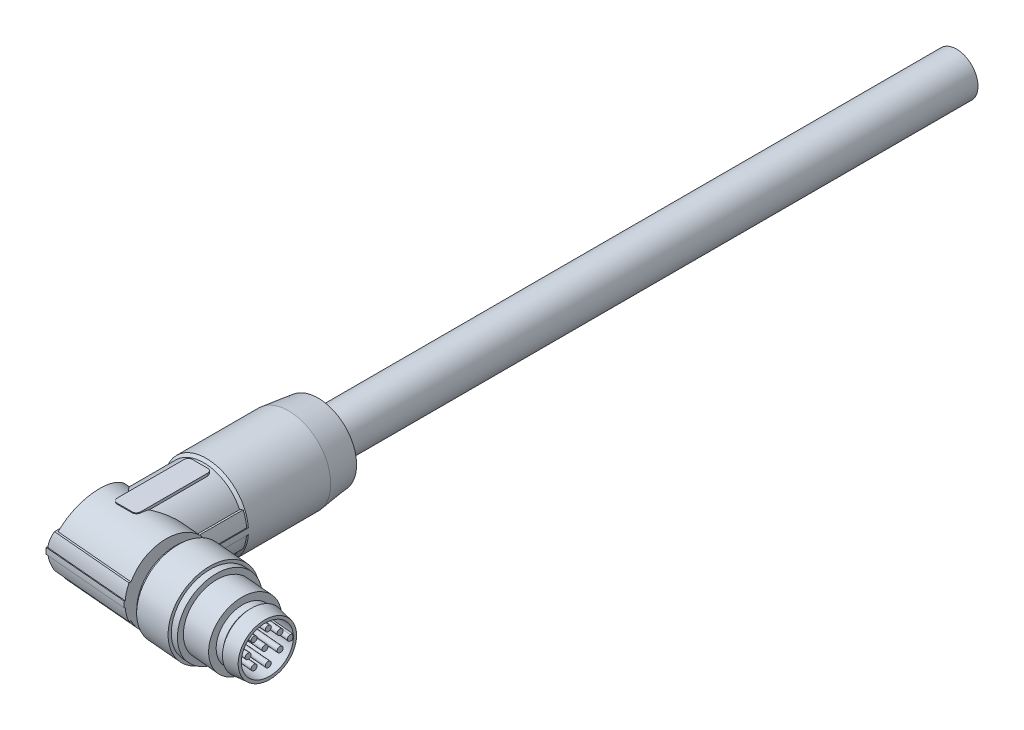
ISO-10303-21;
HEADER;
FILE_DESCRIPTION(('STEP AP214'),'2;1');
FILE_NAME('part.step','',(''),(''),'','','');
FILE_SCHEMA(('AUTOMOTIVE_DESIGN { 1 0 10303 214 1 1 1 1 }'));
ENDSEC;
DATA;
#1=APPLICATION_CONTEXT('core data for automotive mechanical design processes');
#2=APPLICATION_PROTOCOL_DEFINITION('international standard','automotive_design',2000,#1);
#3=PRODUCT_CONTEXT('',#1,'mechanical');
#4=PRODUCT('Part','Part','',(#3));
#5=PRODUCT_RELATED_PRODUCT_CATEGORY('part','',(#4));
#6=PRODUCT_DEFINITION_FORMATION('','',#4);
#7=PRODUCT_DEFINITION_CONTEXT('part definition',#1,'design');
#8=PRODUCT_DEFINITION('design','',#6,#7);
#9=PRODUCT_DEFINITION_SHAPE('','',#8);
#10=(LENGTH_UNIT() NAMED_UNIT(*) SI_UNIT(.MILLI.,.METRE.));
#11=(NAMED_UNIT(*) PLANE_ANGLE_UNIT() SI_UNIT($,.RADIAN.));
#12=(NAMED_UNIT(*) SI_UNIT($,.STERADIAN.) SOLID_ANGLE_UNIT());
#13=UNCERTAINTY_MEASURE_WITH_UNIT(LENGTH_MEASURE(1.E-05),#10,'distance_accuracy_value','');
#14=(GEOMETRIC_REPRESENTATION_CONTEXT(3) GLOBAL_UNCERTAINTY_ASSIGNED_CONTEXT((#13)) GLOBAL_UNIT_ASSIGNED_CONTEXT((#10,
#11,#12)) REPRESENTATION_CONTEXT('',''));
#15=CARTESIAN_POINT('',(0.,0.,0.));
#16=DIRECTION('',(0.,0.,1.));
#17=DIRECTION('',(1.,0.,0.));
#18=AXIS2_PLACEMENT_3D('',#15,#16,#17);
#19=CARTESIAN_POINT('',(0.,0.,-100.));
#20=DIRECTION('',(0.,0.,1.));
#21=DIRECTION('',(1.,0.,0.));
#22=AXIS2_PLACEMENT_3D('',#19,#20,#21);
#23=PLANE('',#22);
#24=CARTESIAN_POINT('',(-17.9775743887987,2.07026641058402E-08,-100.));
#25=DIRECTION('',(0.,0.,1.));
#26=DIRECTION('',(1.,0.,0.));
#27=AXIS2_PLACEMENT_3D('',#24,#25,#26);
#28=CIRCLE('',#27,2.55);
#29=CARTESIAN_POINT('',(-15.4275743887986,2.07026641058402E-08,-100.));
#30=VERTEX_POINT('',#29);
#31=EDGE_CURVE('E10',#30,#30,#28,.F.);
#32=ORIENTED_EDGE('',*,*,#31,.T.);
#33=EDGE_LOOP('',(#32));
#34=FACE_BOUND('',#33,.T.);
#35=ADVANCED_FACE('F16',(#34),#23,.F.);
#36=CARTESIAN_POINT('',(0.,0.,0.));
#37=DIRECTION('',(0.996194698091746,0.,0.0871557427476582));
#38=DIRECTION('',(-0.0871557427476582,0.,0.996194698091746));
#39=AXIS2_PLACEMENT_3D('',#36,#37,#38);
#40=PLANE('',#39);
#41=CARTESIAN_POINT('',(0.0305045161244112,1.84999423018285,-0.348668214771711));
#42=DIRECTION('',(0.996194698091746,0.,0.0871557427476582));
#43=DIRECTION('',(-0.0871557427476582,0.,0.996194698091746));
#44=AXIS2_PLACEMENT_3D('',#41,#42,#43);
#45=CIRCLE('',#44,0.33);
#46=CARTESIAN_POINT('',(0.001743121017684,1.84999423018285,-0.0199239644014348));
#47=VERTEX_POINT('',#46);
#48=EDGE_CURVE('E767',#47,#47,#45,.F.);
#49=ORIENTED_EDGE('',*,*,#48,.F.);
#50=EDGE_LOOP('',(#49));
#51=FACE_BOUND('',#50,.T.);
#52=ADVANCED_FACE('F755',(#51),#40,.T.);
#53=CARTESIAN_POINT('',(0.,0.,0.));
#54=DIRECTION('',(0.996194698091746,0.,0.0871557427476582));
#55=DIRECTION('',(-0.0871557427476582,0.,0.996194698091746));
#56=AXIS2_PLACEMENT_3D('',#53,#54,#55);
#57=PLANE('',#56);
#58=CARTESIAN_POINT('',(-0.104586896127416,-1.45000571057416,1.19543369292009));
#59=DIRECTION('',(-0.996194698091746,0.,-0.0871557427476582));
#60=DIRECTION('',(0.0871557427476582,0.,-0.996194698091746));
#61=AXIS2_PLACEMENT_3D('',#58,#59,#60);
#62=CIRCLE('',#61,0.33);
#63=CARTESIAN_POINT('',(-0.0758255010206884,-1.45000571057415,0.866689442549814));
#64=VERTEX_POINT('',#63);
#65=EDGE_CURVE('E768',#64,#64,#62,.T.);
#66=ORIENTED_EDGE('',*,*,#65,.F.);
#67=EDGE_LOOP('',(#66));
#68=FACE_BOUND('',#67,.T.);
#69=ADVANCED_FACE('F752',(#68),#57,.T.);
#70=CARTESIAN_POINT('',(0.,0.,0.));
#71=DIRECTION('',(0.996194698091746,0.,0.0871557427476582));
#72=DIRECTION('',(-0.0871557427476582,0.,0.996194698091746));
#73=AXIS2_PLACEMENT_3D('',#70,#71,#72);
#74=PLANE('',#73);
#75=CARTESIAN_POINT('',(0.0305045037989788,-1.8500057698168,-0.348668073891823));
#76=DIRECTION('',(-0.996194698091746,0.,-0.0871557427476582));
#77=DIRECTION('',(0.0871557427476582,0.,-0.996194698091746));
#78=AXIS2_PLACEMENT_3D('',#75,#76,#77);
#79=CIRCLE('',#78,0.33);
#80=CARTESIAN_POINT('',(0.059265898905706,-1.8500057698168,-0.677412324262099));
#81=VERTEX_POINT('',#80);
#82=EDGE_CURVE('E771',#81,#81,#79,.T.);
#83=ORIENTED_EDGE('',*,*,#82,.F.);
#84=EDGE_LOOP('',(#83));
#85=FACE_BOUND('',#84,.T.);
#86=ADVANCED_FACE('F748',(#85),#74,.T.);
#87=CARTESIAN_POINT('',(0.,0.,0.));
#88=DIRECTION('',(0.996194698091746,0.,0.0871557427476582));
#89=DIRECTION('',(-0.0871557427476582,0.,0.996194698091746));
#90=AXIS2_PLACEMENT_3D('',#87,#88,#89);
#91=PLANE('',#90);
#92=CARTESIAN_POINT('',(0.143806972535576,-0.900005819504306,-1.64372121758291));
#93=DIRECTION('',(-0.996194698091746,0.,-0.0871557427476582));
#94=DIRECTION('',(0.0871557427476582,0.,-0.996194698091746));
#95=AXIS2_PLACEMENT_3D('',#92,#93,#94);
#96=CIRCLE('',#95,0.33);
#97=CARTESIAN_POINT('',(0.172568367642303,-0.900005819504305,-1.97246546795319));
#98=VERTEX_POINT('',#97);
#99=EDGE_CURVE('E776',#98,#98,#96,.T.);
#100=ORIENTED_EDGE('',*,*,#99,.F.);
#101=EDGE_LOOP('',(#100));
#102=FACE_BOUND('',#101,.T.);
#103=ADVANCED_FACE('F744',(#102),#91,.T.);
#104=CARTESIAN_POINT('',(0.,0.,0.));
#105=DIRECTION('',(0.996194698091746,0.,0.0871557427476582));
#106=DIRECTION('',(-0.0871557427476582,0.,0.996194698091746));
#107=AXIS2_PLACEMENT_3D('',#104,#105,#106);
#108=PLANE('',#107);
#109=CARTESIAN_POINT('',(-0.161238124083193,-5.68573058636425E-06,1.84296019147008));
#110=DIRECTION('',(-0.996194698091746,0.,-0.0871557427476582));
#111=DIRECTION('',(0.0871557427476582,0.,-0.996194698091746));
#112=AXIS2_PLACEMENT_3D('',#109,#110,#111);
#113=CIRCLE('',#112,0.33);
#114=CARTESIAN_POINT('',(-0.132476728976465,-5.68573058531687E-06,1.51421594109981));
#115=VERTEX_POINT('',#114);
#116=EDGE_CURVE('E779',#115,#115,#113,.T.);
#117=ORIENTED_EDGE('',*,*,#116,.F.);
#118=EDGE_LOOP('',(#117));
#119=FACE_BOUND('',#118,.T.);
#120=ADVANCED_FACE('F740',(#119),#108,.T.);
#121=CARTESIAN_POINT('',(0.,0.,0.));
#122=DIRECTION('',(0.996194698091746,0.,0.0871557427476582));
#123=DIRECTION('',(-0.0871557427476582,0.,0.996194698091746));
#124=AXIS2_PLACEMENT_3D('',#121,#122,#123);
#125=PLANE('',#124);
#126=CARTESIAN_POINT('',(0.,-5.75643959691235E-06,3.85108611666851E-13));
#127=DIRECTION('',(-0.996194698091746,0.,-0.0871557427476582));
#128=DIRECTION('',(0.0871557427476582,0.,-0.996194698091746));
#129=AXIS2_PLACEMENT_3D('',#126,#127,#128);
#130=CIRCLE('',#129,0.33);
#131=CARTESIAN_POINT('',(0.0287613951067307,-5.75643959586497E-06,-0.328744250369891));
#132=VERTEX_POINT('',#131);
#133=EDGE_CURVE('E782',#132,#132,#130,.T.);
#134=ORIENTED_EDGE('',*,*,#133,.F.);
#135=EDGE_LOOP('',(#134));
#136=FACE_BOUND('',#135,.T.);
#137=ADVANCED_FACE('F736',(#136),#125,.T.);
#138=CARTESIAN_POINT('',(0.,0.,0.));
#139=DIRECTION('',(0.996194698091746,0.,0.0871557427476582));
#140=DIRECTION('',(-0.0871557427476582,0.,0.996194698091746));
#141=AXIS2_PLACEMENT_3D('',#138,#139,#140);
#142=PLANE('',#141);
#143=CARTESIAN_POINT('',(-0.104586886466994,1.44999428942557,1.19543358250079));
#144=DIRECTION('',(0.996194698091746,0.,0.0871557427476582));
#145=DIRECTION('',(-0.0871557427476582,0.,0.996194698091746));
#146=AXIS2_PLACEMENT_3D('',#143,#144,#145);
#147=CIRCLE('',#146,0.33);
#148=CARTESIAN_POINT('',(-0.133348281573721,1.44999428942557,1.52417783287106));
#149=VERTEX_POINT('',#148);
#150=EDGE_CURVE('E785',#149,#149,#147,.F.);
#151=ORIENTED_EDGE('',*,*,#150,.F.);
#152=EDGE_LOOP('',(#151));
#153=FACE_BOUND('',#152,.T.);
#154=ADVANCED_FACE('F732',(#153),#142,.T.);
#155=CARTESIAN_POINT('',(0.,0.,0.));
#156=DIRECTION('',(0.996194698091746,0.,0.0871557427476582));
#157=DIRECTION('',(-0.0871557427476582,0.,0.996194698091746));
#158=AXIS2_PLACEMENT_3D('',#155,#156,#157);
#159=PLANE('',#158);
#160=CARTESIAN_POINT('',(0.14380697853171,0.899994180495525,-1.6437212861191));
#161=DIRECTION('',(0.996194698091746,0.,0.0871557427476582));
#162=DIRECTION('',(-0.0871557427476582,0.,0.996194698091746));
#163=AXIS2_PLACEMENT_3D('',#160,#161,#162);
#164=CIRCLE('',#163,0.33);
#165=CARTESIAN_POINT('',(0.115045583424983,0.899994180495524,-1.31497703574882));
#166=VERTEX_POINT('',#165);
#167=EDGE_CURVE('E340',#166,#166,#164,.F.);
#168=ORIENTED_EDGE('',*,*,#167,.F.);
#169=EDGE_LOOP('',(#168));
#170=FACE_BOUND('',#169,.T.);
#171=ADVANCED_FACE('F729',(#170),#159,.T.);
#172=CARTESIAN_POINT('',(-4.4369269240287,-5.85485889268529E-06,-2.9730168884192));
#173=DIRECTION('',(0.996194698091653,-4.32191605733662E-07,0.0871557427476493));
#174=DIRECTION('',(-0.0871557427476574,0.,0.996194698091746));
#175=AXIS2_PLACEMENT_3D('',#172,#173,#174);
#176=CYLINDRICAL_SURFACE('',#175,0.325);
#177=CARTESIAN_POINT('',(0.444427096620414,-7.97259776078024E-06,-2.54595374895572));
#178=DIRECTION('',(0.996194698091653,-4.32191605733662E-07,0.0871557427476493));
#179=DIRECTION('',(-0.0871557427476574,0.,0.996194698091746));
#180=AXIS2_PLACEMENT_3D('',#177,#178,#179);
#181=CIRCLE('',#180,0.325);
#182=CARTESIAN_POINT('',(0.444427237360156,0.324992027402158,-2.54595374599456));
#183=VERTEX_POINT('',#182);
#184=CARTESIAN_POINT('',(0.444426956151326,-0.325007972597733,-2.54595375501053));
#185=VERTEX_POINT('',#184);
#186=EDGE_CURVE('E321',#183,#185,#181,.T.);
#187=ORIENTED_EDGE('',*,*,#186,.F.);
#188=DIRECTION('',(0.996194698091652,-4.32191605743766E-07,0.0871557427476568));
#189=VECTOR('',#188,1.);
#190=CARTESIAN_POINT('',(-4.45768904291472,0.324994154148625,-2.9748333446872));
#191=LINE('',#190,#189);
#192=CARTESIAN_POINT('',(-4.45768904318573,0.324993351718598,-2.97483334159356));
#193=VERTEX_POINT('',#192);
#194=EDGE_CURVE('E346',#193,#183,#191,.T.);
#195=ORIENTED_EDGE('',*,*,#194,.F.);
#196=CARTESIAN_POINT('',(-4.45768918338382,-5.84585134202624E-06,-2.97483335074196));
#197=DIRECTION('',(0.996194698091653,-4.32191605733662E-07,0.0871557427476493));
#198=DIRECTION('',(-0.0871557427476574,0.,0.996194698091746));
#199=AXIS2_PLACEMENT_3D('',#196,#197,#198);
#200=CIRCLE('',#199,0.325);
#201=CARTESIAN_POINT('',(-4.45768918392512,-0.325005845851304,-2.97483334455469));
#202=VERTEX_POINT('',#201);
#203=EDGE_CURVE('E336',#193,#202,#200,.T.);
#204=ORIENTED_EDGE('',*,*,#203,.T.);
#205=DIRECTION('',(-0.996194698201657,4.32191605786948E-07,-0.0871557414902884));
#206=VECTOR('',#205,1.);
#207=CARTESIAN_POINT('',(0.444426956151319,-0.32500797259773,-2.54595375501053));
#208=LINE('',#207,#206);
#209=EDGE_CURVE('E331',#185,#202,#208,.T.);
#210=ORIENTED_EDGE('',*,*,#209,.F.);
#211=EDGE_LOOP('',(#187,#195,#204,#210));
#212=FACE_BOUND('',#211,.T.);
#213=ADVANCED_FACE('F335',(#212),#176,.T.);
#214=CARTESIAN_POINT('',(-4.6516105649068,1.84999423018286,-0.758300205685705));
#215=DIRECTION('',(0.996194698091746,0.,0.0871557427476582));
#216=DIRECTION('',(-0.0871557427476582,0.,0.996194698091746));
#217=AXIS2_PLACEMENT_3D('',#214,#215,#216);
#218=CYLINDRICAL_SURFACE('',#217,0.33);
#219=ORIENTED_EDGE('',*,*,#48,.T.);
#220=EDGE_LOOP('',(#219));
#221=FACE_BOUND('',#220,.T.);
#222=CARTESIAN_POINT('',(-4.65161056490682,1.84999423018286,-0.758300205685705));
#223=DIRECTION('',(0.996194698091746,0.,0.0871557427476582));
#224=DIRECTION('',(-0.0871557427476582,0.,0.996194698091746));
#225=AXIS2_PLACEMENT_3D('',#222,#223,#224);
#226=CIRCLE('',#225,0.33);
#227=CARTESIAN_POINT('',(-4.68037196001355,1.84999423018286,-0.429555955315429));
#228=VERTEX_POINT('',#227);
#229=EDGE_CURVE('E790',#228,#228,#226,.T.);
#230=ORIENTED_EDGE('',*,*,#229,.T.);
#231=EDGE_LOOP('',(#230));
#232=FACE_BOUND('',#231,.T.);
#233=ADVANCED_FACE('F722',(#221,#232),#218,.T.);
#234=CARTESIAN_POINT('',(-4.78670197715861,-1.45000571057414,0.785801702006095));
#235=DIRECTION('',(-0.996194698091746,0.,-0.0871557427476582));
#236=DIRECTION('',(0.0871557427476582,0.,-0.996194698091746));
#237=AXIS2_PLACEMENT_3D('',#234,#235,#236);
#238=CYLINDRICAL_SURFACE('',#237,0.33);
#239=ORIENTED_EDGE('',*,*,#65,.T.);
#240=EDGE_LOOP('',(#239));
#241=FACE_BOUND('',#240,.T.);
#242=CARTESIAN_POINT('',(-4.78670197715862,-1.45000571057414,0.785801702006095));
#243=DIRECTION('',(-0.996194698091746,0.,-0.0871557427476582));
#244=DIRECTION('',(0.0871557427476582,0.,-0.996194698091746));
#245=AXIS2_PLACEMENT_3D('',#242,#243,#244);
#246=CIRCLE('',#245,0.33);
#247=CARTESIAN_POINT('',(-4.75794058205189,-1.45000571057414,0.457057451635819));
#248=VERTEX_POINT('',#247);
#249=EDGE_CURVE('E793',#248,#248,#246,.F.);
#250=ORIENTED_EDGE('',*,*,#249,.T.);
#251=EDGE_LOOP('',(#250));
#252=FACE_BOUND('',#251,.T.);
#253=ADVANCED_FACE('F718',(#241,#252),#238,.T.);
#254=CARTESIAN_POINT('',(-4.65161057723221,-1.85000576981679,-0.758300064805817));
#255=DIRECTION('',(-0.996194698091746,0.,-0.0871557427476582));
#256=DIRECTION('',(0.0871557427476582,0.,-0.996194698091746));
#257=AXIS2_PLACEMENT_3D('',#254,#255,#256);
#258=CYLINDRICAL_SURFACE('',#257,0.33);
#259=ORIENTED_EDGE('',*,*,#82,.T.);
#260=EDGE_LOOP('',(#259));
#261=FACE_BOUND('',#260,.T.);
#262=CARTESIAN_POINT('',(-4.65161057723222,-1.85000576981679,-0.758300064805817));
#263=DIRECTION('',(-0.996194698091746,0.,-0.0871557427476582));
#264=DIRECTION('',(0.0871557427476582,0.,-0.996194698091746));
#265=AXIS2_PLACEMENT_3D('',#262,#263,#264);
#266=CIRCLE('',#265,0.33);
#267=CARTESIAN_POINT('',(-4.62284918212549,-1.85000576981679,-1.08704431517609));
#268=VERTEX_POINT('',#267);
#269=EDGE_CURVE('E797',#268,#268,#266,.F.);
#270=ORIENTED_EDGE('',*,*,#269,.T.);
#271=EDGE_LOOP('',(#270));
#272=FACE_BOUND('',#271,.T.);
#273=ADVANCED_FACE('F714',(#261,#272),#258,.T.);
#274=CARTESIAN_POINT('',(-4.53830810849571,-0.900005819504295,-2.05335320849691));
#275=DIRECTION('',(-0.996194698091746,0.,-0.0871557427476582));
#276=DIRECTION('',(0.0871557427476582,0.,-0.996194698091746));
#277=AXIS2_PLACEMENT_3D('',#274,#275,#276);
#278=CYLINDRICAL_SURFACE('',#277,0.33);
#279=ORIENTED_EDGE('',*,*,#99,.T.);
#280=EDGE_LOOP('',(#279));
#281=FACE_BOUND('',#280,.T.);
#282=CARTESIAN_POINT('',(-4.53830810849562,-0.900005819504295,-2.05335320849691));
#283=DIRECTION('',(-0.996194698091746,0.,-0.0871557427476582));
#284=DIRECTION('',(0.0871557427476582,0.,-0.996194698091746));
#285=AXIS2_PLACEMENT_3D('',#282,#283,#284);
#286=CIRCLE('',#285,0.33);
#287=CARTESIAN_POINT('',(-4.50954671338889,-0.900005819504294,-2.38209745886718));
#288=VERTEX_POINT('',#287);
#289=EDGE_CURVE('E800',#288,#288,#286,.F.);
#290=ORIENTED_EDGE('',*,*,#289,.T.);
#291=EDGE_LOOP('',(#290));
#292=FACE_BOUND('',#291,.T.);
#293=ADVANCED_FACE('F710',(#281,#292),#278,.T.);
#294=CARTESIAN_POINT('',(-4.84335320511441,-5.68573057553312E-06,1.43332820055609));
#295=DIRECTION('',(-0.996194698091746,0.,-0.0871557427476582));
#296=DIRECTION('',(0.0871557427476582,0.,-0.996194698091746));
#297=AXIS2_PLACEMENT_3D('',#294,#295,#296);
#298=CYLINDRICAL_SURFACE('',#297,0.33);
#299=ORIENTED_EDGE('',*,*,#116,.T.);
#300=EDGE_LOOP('',(#299));
#301=FACE_BOUND('',#300,.T.);
#302=CARTESIAN_POINT('',(-4.84335320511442,-5.68573057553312E-06,1.43332820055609));
#303=DIRECTION('',(-0.996194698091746,0.,-0.0871557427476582));
#304=DIRECTION('',(0.0871557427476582,0.,-0.996194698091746));
#305=AXIS2_PLACEMENT_3D('',#302,#303,#304);
#306=CIRCLE('',#305,0.33);
#307=CARTESIAN_POINT('',(-4.81459181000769,-5.68573057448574E-06,1.10458395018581));
#308=VERTEX_POINT('',#307);
#309=EDGE_CURVE('E803',#308,#308,#306,.F.);
#310=ORIENTED_EDGE('',*,*,#309,.T.);
#311=EDGE_LOOP('',(#310));
#312=FACE_BOUND('',#311,.T.);
#313=ADVANCED_FACE('F706',(#301,#312),#298,.T.);
#314=CARTESIAN_POINT('',(-4.68211508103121,-5.75643958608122E-06,-0.409631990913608));
#315=DIRECTION('',(-0.996194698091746,0.,-0.0871557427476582));
#316=DIRECTION('',(0.0871557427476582,0.,-0.996194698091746));
#317=AXIS2_PLACEMENT_3D('',#314,#315,#316);
#318=CYLINDRICAL_SURFACE('',#317,0.33);
#319=ORIENTED_EDGE('',*,*,#133,.T.);
#320=EDGE_LOOP('',(#319));
#321=FACE_BOUND('',#320,.T.);
#322=CARTESIAN_POINT('',(-4.68211508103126,-5.75643958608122E-06,-0.409631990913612));
#323=DIRECTION('',(-0.996194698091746,0.,-0.0871557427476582));
#324=DIRECTION('',(0.0871557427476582,0.,-0.996194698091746));
#325=AXIS2_PLACEMENT_3D('',#322,#323,#324);
#326=CIRCLE('',#325,0.33);
#327=CARTESIAN_POINT('',(-4.65335368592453,-5.75643958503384E-06,-0.738376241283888));
#328=VERTEX_POINT('',#327);
#329=EDGE_CURVE('E806',#328,#328,#326,.F.);
#330=ORIENTED_EDGE('',*,*,#329,.T.);
#331=EDGE_LOOP('',(#330));
#332=FACE_BOUND('',#331,.T.);
#333=ADVANCED_FACE('F702',(#321,#332),#318,.T.);
#334=CARTESIAN_POINT('',(-4.7867019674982,1.44999428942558,0.785801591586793));
#335=DIRECTION('',(0.996194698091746,0.,0.0871557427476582));
#336=DIRECTION('',(-0.0871557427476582,0.,0.996194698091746));
#337=AXIS2_PLACEMENT_3D('',#334,#335,#336);
#338=CYLINDRICAL_SURFACE('',#337,0.33);
#339=ORIENTED_EDGE('',*,*,#150,.T.);
#340=EDGE_LOOP('',(#339));
#341=FACE_BOUND('',#340,.T.);
#342=CARTESIAN_POINT('',(-4.78670196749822,1.44999428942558,0.785801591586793));
#343=DIRECTION('',(0.996194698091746,0.,0.0871557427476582));
#344=DIRECTION('',(-0.0871557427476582,0.,0.996194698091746));
#345=AXIS2_PLACEMENT_3D('',#342,#343,#344);
#346=CIRCLE('',#345,0.33);
#347=CARTESIAN_POINT('',(-4.81546336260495,1.44999428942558,1.11454584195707));
#348=VERTEX_POINT('',#347);
#349=EDGE_CURVE('E809',#348,#348,#346,.T.);
#350=ORIENTED_EDGE('',*,*,#349,.T.);
#351=EDGE_LOOP('',(#350));
#352=FACE_BOUND('',#351,.T.);
#353=ADVANCED_FACE('F698',(#341,#352),#338,.T.);
#354=CARTESIAN_POINT('',(-4.5383081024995,0.899994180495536,-2.0533532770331));
#355=DIRECTION('',(0.996194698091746,0.,0.0871557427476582));
#356=DIRECTION('',(-0.0871557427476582,0.,0.996194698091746));
#357=AXIS2_PLACEMENT_3D('',#354,#355,#356);
#358=CYLINDRICAL_SURFACE('',#357,0.33);
#359=ORIENTED_EDGE('',*,*,#167,.T.);
#360=EDGE_LOOP('',(#359));
#361=FACE_BOUND('',#360,.T.);
#362=CARTESIAN_POINT('',(-4.53830810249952,0.899994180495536,-2.0533532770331));
#363=DIRECTION('',(0.996194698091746,0.,0.0871557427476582));
#364=DIRECTION('',(-0.0871557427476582,0.,0.996194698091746));
#365=AXIS2_PLACEMENT_3D('',#362,#363,#364);
#366=CIRCLE('',#365,0.33);
#367=CARTESIAN_POINT('',(-4.56706949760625,0.899994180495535,-1.72460902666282));
#368=VERTEX_POINT('',#367);
#369=EDGE_CURVE('E353',#368,#368,#366,.T.);
#370=ORIENTED_EDGE('',*,*,#369,.T.);
#371=EDGE_LOOP('',(#370));
#372=FACE_BOUND('',#371,.T.);
#373=ADVANCED_FACE('F695',(#361,#372),#358,.T.);
#374=CARTESIAN_POINT('',(-4.4123865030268,-0.325005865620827,-3.25351679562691));
#375=DIRECTION('',(-4.33878173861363E-07,-0.999999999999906,4.07668888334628E-10));
#376=DIRECTION('',(-0.999999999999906,4.33878173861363E-07,0.));
#377=AXIS2_PLACEMENT_3D('',#374,#375,#376);
#378=PLANE('',#377);
#379=ORIENTED_EDGE('',*,*,#209,.T.);
#380=DIRECTION('',(0.0871557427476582,0.,-0.996194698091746));
#381=VECTOR('',#380,1.);
#382=CARTESIAN_POINT('',(-4.57948648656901,-0.325005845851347,-1.58268219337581));
#383=LINE('',#382,#381);
#384=CARTESIAN_POINT('',(-4.43534161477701,-0.325005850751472,-3.23026561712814));
#385=VERTEX_POINT('',#384);
#386=EDGE_CURVE('E794',#202,#385,#383,.T.);
#387=ORIENTED_EDGE('',*,*,#386,.T.);
#388=DIRECTION('',(-0.996194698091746,0.,-0.0871557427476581));
#389=VECTOR('',#388,1.);
#390=CARTESIAN_POINT('',(-1.94485486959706,-0.325005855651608,-3.0123762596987));
#391=LINE('',#390,#389);
#392=CARTESIAN_POINT('',(0.466774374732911,-0.325006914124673,-2.8013859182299));
#393=VERTEX_POINT('',#392);
#394=EDGE_CURVE('E345',#385,#393,#391,.F.);
#395=ORIENTED_EDGE('',*,*,#394,.T.);
#396=DIRECTION('',(-0.0871557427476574,0.,0.996194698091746));
#397=VECTOR('',#396,1.);
#398=CARTESIAN_POINT('',(0.0543495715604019,-0.325007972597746,1.91265115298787));
#399=LINE('',#398,#397);
#400=EDGE_CURVE('E325',#185,#393,#399,.F.);
#401=ORIENTED_EDGE('',*,*,#400,.F.);
#402=EDGE_LOOP('',(#379,#387,#395,#401));
#403=FACE_BOUND('',#402,.T.);
#404=ADVANCED_FACE('F343',(#403),#378,.T.);
#405=CARTESIAN_POINT('',(0.0543499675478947,0.59472321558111,1.91265118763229));
#406=DIRECTION('',(0.996194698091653,-4.32191605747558E-07,0.0871557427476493));
#407=DIRECTION('',(-0.0871557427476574,0.,0.996194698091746));
#408=AXIS2_PLACEMENT_3D('',#405,#406,#407);
#409=PLANE('',#408);
#410=ORIENTED_EDGE('',*,*,#186,.T.);
#411=ORIENTED_EDGE('',*,*,#400,.T.);
#412=CARTESIAN_POINT('',(0.22000091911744,0.,0.0192475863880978));
#413=DIRECTION('',(-0.996194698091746,0.,-0.0871557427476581));
#414=DIRECTION('',(0.0871557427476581,0.,-0.996194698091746));
#415=AXIS2_PLACEMENT_3D('',#412,#413,#414);
#416=CIRCLE('',#415,2.85);
#417=CARTESIAN_POINT('',(0.466773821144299,0.32499201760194,-2.80138768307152));
#418=VERTEX_POINT('',#417);
#419=EDGE_CURVE('E352',#393,#418,#416,.F.);
#420=ORIENTED_EDGE('',*,*,#419,.T.);
#421=DIRECTION('',(0.0871551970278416,-3.82208492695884E-08,-0.996194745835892));
#422=VECTOR('',#421,1.);
#423=CARTESIAN_POINT('',(0.444427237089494,0.324992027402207,-2.54595374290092));
#424=LINE('',#423,#422);
#425=EDGE_CURVE('E327',#183,#418,#424,.T.);
#426=ORIENTED_EDGE('',*,*,#425,.F.);
#427=EDGE_LOOP('',(#410,#411,#420,#426));
#428=FACE_BOUND('',#427,.T.);
#429=ADVANCED_FACE('F323',(#428),#409,.T.);
#430=CARTESIAN_POINT('',(-4.41238622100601,0.324994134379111,-3.25351679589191));
#431=DIRECTION('',(4.33878173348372E-07,0.999999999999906,-4.07663024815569E-10));
#432=DIRECTION('',(0.999999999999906,-4.33878173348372E-07,0.));
#433=AXIS2_PLACEMENT_3D('',#430,#431,#432);
#434=PLANE('',#433);
#435=ORIENTED_EDGE('',*,*,#425,.T.);
#436=DIRECTION('',(-0.996194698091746,0.,-0.0871557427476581));
#437=VECTOR('',#436,1.);
#438=CARTESIAN_POINT('',(-1.94485473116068,0.324992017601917,-3.01237784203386));
#439=LINE('',#438,#437);
#440=CARTESIAN_POINT('',(-4.4353414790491,0.324992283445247,-3.2302671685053));
#441=VERTEX_POINT('',#440);
#442=EDGE_CURVE('E815',#418,#441,#439,.T.);
#443=ORIENTED_EDGE('',*,*,#442,.T.);
#444=DIRECTION('',(0.0871557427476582,0.,-0.996194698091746));
#445=VECTOR('',#444,1.);
#446=CARTESIAN_POINT('',(-4.57948648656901,0.324992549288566,-1.58268219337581));
#447=LINE('',#446,#445);
#448=EDGE_CURVE('E1018',#441,#193,#447,.F.);
#449=ORIENTED_EDGE('',*,*,#448,.T.);
#450=ORIENTED_EDGE('',*,*,#194,.T.);
#451=EDGE_LOOP('',(#435,#443,#449,#450));
#452=FACE_BOUND('',#451,.T.);
#453=ADVANCED_FACE('F686',(#452),#434,.T.);
#454=CARTESIAN_POINT('',(-4.579486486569,0.824516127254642,-1.58268219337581));
#455=DIRECTION('',(-0.996194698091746,0.,-0.0871557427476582));
#456=DIRECTION('',(0.0871557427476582,0.,-0.996194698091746));
#457=AXIS2_PLACEMENT_3D('',#454,#455,#456);
#458=PLANE('',#457);
#459=ORIENTED_EDGE('',*,*,#369,.F.);
#460=EDGE_LOOP('',(#459));
#461=FACE_BOUND('',#460,.T.);
#462=ORIENTED_EDGE('',*,*,#349,.F.);
#463=EDGE_LOOP('',(#462));
#464=FACE_BOUND('',#463,.T.);
#465=ORIENTED_EDGE('',*,*,#329,.F.);
#466=EDGE_LOOP('',(#465));
#467=FACE_BOUND('',#466,.T.);
#468=ORIENTED_EDGE('',*,*,#309,.F.);
#469=EDGE_LOOP('',(#468));
#470=FACE_BOUND('',#469,.T.);
#471=ORIENTED_EDGE('',*,*,#289,.F.);
#472=EDGE_LOOP('',(#471));
#473=FACE_BOUND('',#472,.T.);
#474=ORIENTED_EDGE('',*,*,#269,.F.);
#475=EDGE_LOOP('',(#474));
#476=FACE_BOUND('',#475,.T.);
#477=ORIENTED_EDGE('',*,*,#249,.F.);
#478=EDGE_LOOP('',(#477));
#479=FACE_BOUND('',#478,.T.);
#480=ORIENTED_EDGE('',*,*,#229,.F.);
#481=EDGE_LOOP('',(#480));
#482=FACE_BOUND('',#481,.T.);
#483=CARTESIAN_POINT('',(-4.68211508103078,0.,-0.409631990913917));
#484=DIRECTION('',(-0.996194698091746,0.,-0.0871557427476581));
#485=DIRECTION('',(0.0871557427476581,0.,-0.996194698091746));
#486=AXIS2_PLACEMENT_3D('',#483,#484,#485);
#487=CIRCLE('',#486,2.85);
#488=EDGE_CURVE('E816',#441,#385,#487,.F.);
#489=ORIENTED_EDGE('',*,*,#488,.T.);
#490=ORIENTED_EDGE('',*,*,#386,.F.);
#491=ORIENTED_EDGE('',*,*,#203,.F.);
#492=ORIENTED_EDGE('',*,*,#448,.F.);
#493=EDGE_LOOP('',(#489,#490,#491,#492));
#494=FACE_BOUND('',#493,.T.);
#495=ADVANCED_FACE('F682',(#461,#464,#467,#470,#473,#476,#479,#482,#494),#458,.F.);
#496=CARTESIAN_POINT('',(-2.19162833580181,0.,-0.191742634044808));
#497=DIRECTION('',(-0.996194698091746,0.,-0.0871557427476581));
#498=DIRECTION('',(0.0871557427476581,0.,-0.996194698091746));
#499=AXIS2_PLACEMENT_3D('',#496,#497,#498);
#500=CYLINDRICAL_SURFACE('',#499,2.85);
#501=ORIENTED_EDGE('',*,*,#419,.F.);
#502=ORIENTED_EDGE('',*,*,#394,.F.);
#503=ORIENTED_EDGE('',*,*,#488,.F.);
#504=ORIENTED_EDGE('',*,*,#442,.F.);
#505=EDGE_LOOP('',(#501,#502,#503,#504));
#506=FACE_BOUND('',#505,.T.);
#507=CARTESIAN_POINT('',(0.298858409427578,0.,0.0261467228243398));
#508=DIRECTION('',(-0.996194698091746,0.,-0.0871557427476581));
#509=DIRECTION('',(0.0871557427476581,0.,-0.996194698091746));
#510=AXIS2_PLACEMENT_3D('',#507,#508,#509);
#511=CIRCLE('',#510,2.85);
#512=CARTESIAN_POINT('',(0.547252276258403,0.,-2.81300816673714));
#513=VERTEX_POINT('',#512);
#514=EDGE_CURVE('E818',#513,#513,#511,.T.);
#515=ORIENTED_EDGE('',*,*,#514,.F.);
#516=EDGE_LOOP('',(#515));
#517=FACE_BOUND('',#516,.T.);
#518=ADVANCED_FACE('F678',(#506,#517),#500,.F.);
#519=CARTESIAN_POINT('',(0.515717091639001,1.74223842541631,-2.4525593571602));
#520=DIRECTION('',(0.996194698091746,0.,0.0871557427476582));
#521=DIRECTION('',(-0.0871557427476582,0.,0.996194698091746));
#522=AXIS2_PLACEMENT_3D('',#519,#520,#521);
#523=PLANE('',#522);
#524=CARTESIAN_POINT('',(0.29885840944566,0.,0.0261467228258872));
#525=DIRECTION('',(-0.996194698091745,0.,-0.0871557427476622));
#526=DIRECTION('',(0.0871557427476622,0.,-0.996194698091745));
#527=AXIS2_PLACEMENT_3D('',#524,#525,#526);
#528=CIRCLE('',#527,3.19999999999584);
#529=CARTESIAN_POINT('',(0.577756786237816,0.,-3.16167631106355));
#530=VERTEX_POINT('',#529);
#531=EDGE_CURVE('E821',#530,#530,#528,.T.);
#532=ORIENTED_EDGE('',*,*,#531,.F.);
#533=EDGE_LOOP('',(#532));
#534=FACE_BOUND('',#533,.T.);
#535=ORIENTED_EDGE('',*,*,#514,.T.);
#536=EDGE_LOOP('',(#535));
#537=FACE_BOUND('',#536,.T.);
#538=ADVANCED_FACE('F674',(#534,#537),#523,.T.);
#539=CARTESIAN_POINT('',(-1.44448231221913,0.,-0.126375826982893));
#540=DIRECTION('',(-0.996194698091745,0.,-0.0871557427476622));
#541=DIRECTION('',(0.0871557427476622,0.,-0.996194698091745));
#542=AXIS2_PLACEMENT_3D('',#539,#540,#541);
#543=CONICAL_SURFACE('',#542,3.45000000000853,0.141897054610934);
#544=CARTESIAN_POINT('',(-1.44448231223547,0.,-0.126375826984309));
#545=DIRECTION('',(0.996194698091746,0.,0.0871557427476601));
#546=DIRECTION('',(-0.0871557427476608,0.,0.996194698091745));
#547=AXIS2_PLACEMENT_3D('',#544,#545,#546);
#548=CIRCLE('',#547,3.45000000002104);
#549=CARTESIAN_POINT('',(-1.74516962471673,0.,3.31049588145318));
#550=VERTEX_POINT('',#549);
#551=EDGE_CURVE('E824',#550,#550,#548,.F.);
#552=ORIENTED_EDGE('',*,*,#551,.F.);
#553=EDGE_LOOP('',(#552));
#554=FACE_BOUND('',#553,.T.);
#555=ORIENTED_EDGE('',*,*,#531,.T.);
#556=EDGE_LOOP('',(#555));
#557=FACE_BOUND('',#556,.T.);
#558=ADVANCED_FACE('F670',(#554,#557),#543,.T.);
#559=CARTESIAN_POINT('',(-1.44448231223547,0.,-0.126375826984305));
#560=DIRECTION('',(0.996194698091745,0.,0.0871557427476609));
#561=DIRECTION('',(-0.0871557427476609,0.,0.996194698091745));
#562=AXIS2_PLACEMENT_3D('',#559,#560,#561);
#563=CONICAL_SURFACE('',#562,3.45000000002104,0.785398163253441);
#564=ORIENTED_EDGE('',*,*,#551,.T.);
#565=EDGE_LOOP('',(#564));
#566=FACE_BOUND('',#565,.T.);
#567=CARTESIAN_POINT('',(-1.71843585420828,0.,-0.150343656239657));
#568=DIRECTION('',(0.996194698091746,0.,0.0871557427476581));
#569=DIRECTION('',(-0.0871557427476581,0.,0.996194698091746));
#570=AXIS2_PLACEMENT_3D('',#567,#568,#569);
#571=CIRCLE('',#570,3.175);
#572=CARTESIAN_POINT('',(-1.99515533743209,0.,3.01257451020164));
#573=VERTEX_POINT('',#572);
#574=EDGE_CURVE('E829',#573,#573,#571,.F.);
#575=ORIENTED_EDGE('',*,*,#574,.F.);
#576=EDGE_LOOP('',(#575));
#577=FACE_BOUND('',#576,.T.);
#578=ADVANCED_FACE('F666',(#566,#577),#563,.T.);
#579=CARTESIAN_POINT('',(-13.6067429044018,0.,-1.19043575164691));
#580=DIRECTION('',(0.996194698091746,0.,0.0871557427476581));
#581=DIRECTION('',(-0.0871557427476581,0.,0.996194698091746));
#582=AXIS2_PLACEMENT_3D('',#579,#580,#581);
#583=CYLINDRICAL_SURFACE('',#582,3.175);
#584=ORIENTED_EDGE('',*,*,#574,.T.);
#585=EDGE_LOOP('',(#584));
#586=FACE_BOUND('',#585,.T.);
#587=CARTESIAN_POINT('',(-2.59010621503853,0.,-0.226604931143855));
#588=DIRECTION('',(0.996194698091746,0.,0.0871557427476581));
#589=DIRECTION('',(-0.0871557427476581,0.,0.996194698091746));
#590=AXIS2_PLACEMENT_3D('',#587,#588,#589);
#591=CIRCLE('',#590,3.175);
#592=CARTESIAN_POINT('',(-2.86682569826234,0.,2.93631323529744));
#593=VERTEX_POINT('',#592);
#594=EDGE_CURVE('E825',#593,#593,#591,.F.);
#595=ORIENTED_EDGE('',*,*,#594,.F.);
#596=EDGE_LOOP('',(#595));
#597=FACE_BOUND('',#596,.T.);
#598=ADVANCED_FACE('F662',(#586,#597),#583,.T.);
#599=CARTESIAN_POINT('',(-2.8341708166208,1.64944453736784,2.5630662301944));
#600=DIRECTION('',(0.996194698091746,0.,0.0871557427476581));
#601=DIRECTION('',(-0.0871557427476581,0.,0.996194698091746));
#602=AXIS2_PLACEMENT_3D('',#599,#600,#601);
#603=PLANE('',#602);
#604=CARTESIAN_POINT('',(-2.59010621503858,0.,-0.226604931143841));
#605=DIRECTION('',(-0.996194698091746,0.,-0.0871557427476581));
#606=DIRECTION('',(0.0871557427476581,0.,-0.996194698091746));
#607=AXIS2_PLACEMENT_3D('',#604,#605,#606);
#608=CIRCLE('',#607,4.);
#609=CARTESIAN_POINT('',(-2.24148324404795,0.,-4.21138372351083));
#610=VERTEX_POINT('',#609);
#611=EDGE_CURVE('E828',#610,#610,#608,.T.);
#612=ORIENTED_EDGE('',*,*,#611,.F.);
#613=EDGE_LOOP('',(#612));
#614=FACE_BOUND('',#613,.T.);
#615=ORIENTED_EDGE('',*,*,#594,.T.);
#616=EDGE_LOOP('',(#615));
#617=FACE_BOUND('',#616,.T.);
#618=ADVANCED_FACE('F658',(#614,#617),#603,.T.);
#619=CARTESIAN_POINT('',(-4.59944633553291,0.,-0.402399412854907));
#620=DIRECTION('',(-0.996194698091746,0.,-0.0871557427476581));
#621=DIRECTION('',(0.0871557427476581,0.,-0.996194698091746));
#622=AXIS2_PLACEMENT_3D('',#619,#620,#621);
#623=CYLINDRICAL_SURFACE('',#622,4.);
#624=ORIENTED_EDGE('',*,*,#611,.T.);
#625=EDGE_LOOP('',(#624));
#626=FACE_BOUND('',#625,.T.);
#627=CARTESIAN_POINT('',(-5.87754871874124,0.,-0.514218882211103));
#628=DIRECTION('',(-0.996194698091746,0.,-0.0871557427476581));
#629=DIRECTION('',(0.0871557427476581,0.,-0.996194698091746));
#630=AXIS2_PLACEMENT_3D('',#627,#628,#629);
#631=CIRCLE('',#630,4.);
#632=CARTESIAN_POINT('',(-5.52892574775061,0.,-4.49899767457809));
#633=VERTEX_POINT('',#632);
#634=EDGE_CURVE('E832',#633,#633,#631,.F.);
#635=ORIENTED_EDGE('',*,*,#634,.T.);
#636=EDGE_LOOP('',(#635));
#637=FACE_BOUND('',#636,.T.);
#638=ADVANCED_FACE('F654',(#626,#637),#623,.T.);
#639=CARTESIAN_POINT('',(-6.80312913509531,-1.38016051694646,10.0652136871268));
#640=DIRECTION('',(-0.996194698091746,0.,-0.0871557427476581));
#641=DIRECTION('',(0.0871557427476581,0.,-0.996194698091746));
#642=AXIS2_PLACEMENT_3D('',#639,#640,#641);
#643=PLANE('',#642);
#644=CARTESIAN_POINT('',(-5.87754871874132,0.,-0.514218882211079));
#645=DIRECTION('',(-0.996194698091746,0.,-0.0871557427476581));
#646=DIRECTION('',(0.0871557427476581,0.,-0.996194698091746));
#647=AXIS2_PLACEMENT_3D('',#644,#645,#646);
#648=CIRCLE('',#647,4.65);
#649=CARTESIAN_POINT('',(-5.47227451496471,0.,-5.1465242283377));
#650=VERTEX_POINT('',#649);
#651=EDGE_CURVE('E835',#650,#650,#648,.T.);
#652=ORIENTED_EDGE('',*,*,#651,.F.);
#653=EDGE_LOOP('',(#652));
#654=FACE_BOUND('',#653,.T.);
#655=ORIENTED_EDGE('',*,*,#634,.F.);
#656=EDGE_LOOP('',(#655));
#657=FACE_BOUND('',#656,.T.);
#658=ADVANCED_FACE('F650',(#654,#657),#643,.F.);
#659=CARTESIAN_POINT('',(-6.06673931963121,0.,-0.5307709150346));
#660=DIRECTION('',(-0.996194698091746,0.,-0.0871557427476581));
#661=DIRECTION('',(0.0871557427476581,0.,-0.996194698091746));
#662=AXIS2_PLACEMENT_3D('',#659,#660,#661);
#663=CYLINDRICAL_SURFACE('',#662,4.65);
#664=ORIENTED_EDGE('',*,*,#651,.T.);
#665=EDGE_LOOP('',(#664));
#666=FACE_BOUND('',#665,.T.);
#667=CARTESIAN_POINT('',(-6.6745044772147,0.,-0.583943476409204));
#668=DIRECTION('',(-0.996194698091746,0.,-0.0871557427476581));
#669=DIRECTION('',(0.0871557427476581,0.,-0.996194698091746));
#670=AXIS2_PLACEMENT_3D('',#667,#668,#669);
#671=CIRCLE('',#670,4.65);
#672=CARTESIAN_POINT('',(-6.26923027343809,0.,-5.21624882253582));
#673=VERTEX_POINT('',#672);
#674=EDGE_CURVE('E838',#673,#673,#671,.F.);
#675=ORIENTED_EDGE('',*,*,#674,.T.);
#676=EDGE_LOOP('',(#675));
#677=FACE_BOUND('',#676,.T.);
#678=ADVANCED_FACE('F646',(#666,#677),#663,.T.);
#679=CARTESIAN_POINT('',(-6.3129134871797,0.61379613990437,-4.71694740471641));
#680=DIRECTION('',(-0.996194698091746,0.,-0.0871557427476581));
#681=DIRECTION('',(0.0871557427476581,0.,-0.996194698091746));
#682=AXIS2_PLACEMENT_3D('',#679,#680,#681);
#683=PLANE('',#682);
#684=CARTESIAN_POINT('',(-6.6745044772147,0.,-0.583943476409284));
#685=DIRECTION('',(-0.996194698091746,0.,-0.0871557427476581));
#686=DIRECTION('',(0.0871557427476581,0.,-0.996194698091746));
#687=AXIS2_PLACEMENT_3D('',#684,#685,#686);
#688=CIRCLE('',#687,5.);
#689=CARTESIAN_POINT('',(-6.23872576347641,0.,-5.56491696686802));
#690=VERTEX_POINT('',#689);
#691=EDGE_CURVE('E841',#690,#690,#688,.T.);
#692=ORIENTED_EDGE('',*,*,#691,.F.);
#693=EDGE_LOOP('',(#692));
#694=FACE_BOUND('',#693,.T.);
#695=ORIENTED_EDGE('',*,*,#674,.F.);
#696=EDGE_LOOP('',(#695));
#697=FACE_BOUND('',#696,.T.);
#698=ADVANCED_FACE('F642',(#694,#697),#683,.F.);
#699=CARTESIAN_POINT('',(-10.9480933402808,0.,-0.957834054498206));
#700=DIRECTION('',(-0.996194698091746,0.,-0.0871557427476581));
#701=DIRECTION('',(0.0871557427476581,0.,-0.996194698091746));
#702=AXIS2_PLACEMENT_3D('',#699,#700,#701);
#703=CYLINDRICAL_SURFACE('',#702,5.);
#704=ORIENTED_EDGE('',*,*,#691,.T.);
#705=EDGE_LOOP('',(#704));
#706=FACE_BOUND('',#705,.T.);
#707=CARTESIAN_POINT('',(-10.7589027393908,0.,-0.941282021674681));
#708=DIRECTION('',(-0.996194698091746,0.,-0.0871557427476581));
#709=DIRECTION('',(0.0871557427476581,0.,-0.996194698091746));
#710=AXIS2_PLACEMENT_3D('',#707,#708,#709);
#711=CIRCLE('',#710,5.);
#712=CARTESIAN_POINT('',(-10.3231240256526,0.,-5.92225551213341));
#713=VERTEX_POINT('',#712);
#714=EDGE_CURVE('E844',#713,#713,#711,.T.);
#715=ORIENTED_EDGE('',*,*,#714,.F.);
#716=EDGE_LOOP('',(#715));
#717=FACE_BOUND('',#716,.T.);
#718=ADVANCED_FACE('F638',(#706,#717),#703,.T.);
#719=CARTESIAN_POINT('',(-10.3973117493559,0.61379613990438,-5.07428594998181));
#720=DIRECTION('',(-0.996194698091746,0.,-0.0871557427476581));
#721=DIRECTION('',(0.0871557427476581,0.,-0.996194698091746));
#722=AXIS2_PLACEMENT_3D('',#719,#720,#721);
#723=PLANE('',#722);
#724=ORIENTED_EDGE('',*,*,#714,.T.);
#725=EDGE_LOOP('',(#724));
#726=FACE_BOUND('',#725,.T.);
#727=CARTESIAN_POINT('',(-10.7589027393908,0.,-0.941282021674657));
#728=DIRECTION('',(-0.996194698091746,0.,-0.0871557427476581));
#729=DIRECTION('',(0.0871557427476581,0.,-0.996194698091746));
#730=AXIS2_PLACEMENT_3D('',#727,#728,#729);
#731=CIRCLE('',#730,4.65);
#732=CARTESIAN_POINT('',(-10.3536285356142,0.,-5.57358736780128));
#733=VERTEX_POINT('',#732);
#734=EDGE_CURVE('E847',#733,#733,#731,.T.);
#735=ORIENTED_EDGE('',*,*,#734,.F.);
#736=EDGE_LOOP('',(#735));
#737=FACE_BOUND('',#736,.T.);
#738=ADVANCED_FACE('F634',(#726,#737),#723,.T.);
#739=CARTESIAN_POINT('',(-11.7450490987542,0.,-1.02755864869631));
#740=DIRECTION('',(-0.996194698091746,0.,-0.0871557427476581));
#741=DIRECTION('',(0.0871557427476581,0.,-0.996194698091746));
#742=AXIS2_PLACEMENT_3D('',#739,#740,#741);
#743=CYLINDRICAL_SURFACE('',#742,4.65);
#744=ORIENTED_EDGE('',*,*,#734,.T.);
#745=EDGE_LOOP('',(#744));
#746=FACE_BOUND('',#745,.T.);
#747=CARTESIAN_POINT('',(-11.1670276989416,0.,-0.976988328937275));
#748=DIRECTION('',(0.996194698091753,0.,0.0871557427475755));
#749=DIRECTION('',(-0.0871557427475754,0.,0.996194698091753));
#750=AXIS2_PLACEMENT_3D('',#747,#748,#749);
#751=CIRCLE('',#750,4.65000000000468);
#752=CARTESIAN_POINT('',(-11.5723019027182,0.,3.65531701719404));
#753=VERTEX_POINT('',#752);
#754=EDGE_CURVE('E850',#753,#753,#751,.F.);
#755=ORIENTED_EDGE('',*,*,#754,.F.);
#756=EDGE_LOOP('',(#755));
#757=FACE_BOUND('',#756,.T.);
#758=ADVANCED_FACE('F630',(#746,#757),#743,.T.);
#759=CARTESIAN_POINT('',(-11.167027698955,0.,-0.976988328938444));
#760=DIRECTION('',(0.996194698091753,0.,0.0871557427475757));
#761=DIRECTION('',(-0.0871557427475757,0.,0.996194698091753));
#762=AXIS2_PLACEMENT_3D('',#759,#760,#761);
#763=CONICAL_SURFACE('',#762,4.64999999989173,1.44862327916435);
#764=CARTESIAN_POINT('',(-11.3749671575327,0.,-0.995180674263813));
#765=DIRECTION('',(-0.996194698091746,0.,-0.0871557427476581));
#766=DIRECTION('',(0.0871557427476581,0.,-0.996194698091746));
#767=AXIS2_PLACEMENT_3D('',#764,#765,#766);
#768=CIRCLE('',#767,2.95);
#769=CARTESIAN_POINT('',(-11.1178577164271,0.,-3.93395503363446));
#770=VERTEX_POINT('',#769);
#771=EDGE_CURVE('E1002',#770,#770,#768,.T.);
#772=ORIENTED_EDGE('',*,*,#771,.F.);
#773=EDGE_LOOP('',(#772));
#774=FACE_BOUND('',#773,.T.);
#775=ORIENTED_EDGE('',*,*,#754,.T.);
#776=EDGE_LOOP('',(#775));
#777=FACE_BOUND('',#776,.T.);
#778=ADVANCED_FACE('F626',(#774,#777),#763,.T.);
#779=CARTESIAN_POINT('',(-18.8775720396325,5.41479109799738,-10.2658559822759));
#780=DIRECTION('',(0.,0.,1.));
#781=DIRECTION('',(0.,-1.,0.));
#782=AXIS2_PLACEMENT_3D('',#779,#780,#781);
#783=PLANE('',#782);
#784=DIRECTION('',(0.,-1.,0.));
#785=VECTOR('',#784,1.);
#786=CARTESIAN_POINT('',(-18.8775763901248,5.41479109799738,-10.2658559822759));
#787=LINE('',#786,#785);
#788=CARTESIAN_POINT('',(-18.8775763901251,-4.61302462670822,-10.2658559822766));
#789=VERTEX_POINT('',#788);
#790=CARTESIAN_POINT('',(-18.877576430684,-4.79999958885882,-10.2658559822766));
#791=VERTEX_POINT('',#790);
#792=EDGE_CURVE('E853',#789,#791,#787,.T.);
#793=ORIENTED_EDGE('',*,*,#792,.F.);
#794=CARTESIAN_POINT('',(-17.9775743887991,2.07014563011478E-08,-10.2658559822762));
#795=DIRECTION('',(0.,0.,1.));
#796=DIRECTION('',(0.,-1.,0.));
#797=AXIS2_PLACEMENT_3D('',#794,#795,#796);
#798=CIRCLE('',#797,4.7);
#799=CARTESIAN_POINT('',(-17.0775764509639,-4.61302541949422,-10.2658559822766));
#800=VERTEX_POINT('',#799);
#801=EDGE_CURVE('E851',#800,#789,#798,.F.);
#802=ORIENTED_EDGE('',*,*,#801,.F.);
#803=DIRECTION('',(0.,-1.,0.));
#804=VECTOR('',#803,1.);
#805=CARTESIAN_POINT('',(-17.0775764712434,5.41479109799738,-10.2658559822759));
#806=LINE('',#805,#804);
#807=CARTESIAN_POINT('',(-17.0775764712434,-4.80000036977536,-10.2658559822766));
#808=VERTEX_POINT('',#807);
#809=EDGE_CURVE('E854',#808,#800,#806,.F.);
#810=ORIENTED_EDGE('',*,*,#809,.F.);
#811=DIRECTION('',(-0.999999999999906,4.33842531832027E-07,0.));
#812=VECTOR('',#811,1.);
#813=CARTESIAN_POINT('',(-17.0384779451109,-4.80000038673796,-10.2658559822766));
#814=LINE('',#813,#812);
#815=EDGE_CURVE('E858',#791,#808,#814,.F.);
#816=ORIENTED_EDGE('',*,*,#815,.F.);
#817=EDGE_LOOP('',(#793,#802,#810,#816));
#818=FACE_BOUND('',#817,.T.);
#819=ADVANCED_FACE('F622',(#818),#783,.F.);
#820=CARTESIAN_POINT('',(-11.5459013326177,0.,-1.0101354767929));
#821=DIRECTION('',(-0.996194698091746,0.,-0.0871557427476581));
#822=DIRECTION('',(0.0871557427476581,0.,-0.996194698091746));
#823=AXIS2_PLACEMENT_3D('',#820,#821,#822);
#824=CYLINDRICAL_SURFACE('',#823,2.95);
#825=ORIENTED_EDGE('',*,*,#771,.T.);
#826=EDGE_LOOP('',(#825));
#827=FACE_BOUND('',#826,.T.);
#828=CARTESIAN_POINT('',(-12.379768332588,0.,-1.08308938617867));
#829=DIRECTION('',(0.996194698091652,-4.32191596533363E-07,0.0871557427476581));
#830=DIRECTION('',(-0.0871557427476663,0.,0.996194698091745));
#831=AXIS2_PLACEMENT_3D('',#828,#829,#830);
#832=CIRCLE('',#831,2.95);
#833=CARTESIAN_POINT('',(-12.6368777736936,0.,1.85568497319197));
#834=VERTEX_POINT('',#833);
#835=EDGE_CURVE('E887',#834,#834,#832,.F.);
#836=ORIENTED_EDGE('',*,*,#835,.F.);
#837=EDGE_LOOP('',(#836));
#838=FACE_BOUND('',#837,.T.);
#839=ADVANCED_FACE('F618',(#827,#838),#824,.T.);
#840=CARTESIAN_POINT('',(-17.0384779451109,-4.80000038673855,-1.53995594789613));
#841=DIRECTION('',(-4.33842531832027E-07,-0.999999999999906,0.));
#842=DIRECTION('',(-0.999999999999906,4.33842531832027E-07,0.));
#843=AXIS2_PLACEMENT_3D('',#840,#841,#842);
#844=PLANE('',#843);
#845=DIRECTION('',(0.,0.,-1.));
#846=VECTOR('',#845,1.);
#847=CARTESIAN_POINT('',(-19.3775764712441,-4.7999993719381,-1.81585598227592));
#848=LINE('',#847,#846);
#849=CARTESIAN_POINT('',(-19.3775764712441,-4.7999993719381,-1.81585598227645));
#850=VERTEX_POINT('',#849);
#851=CARTESIAN_POINT('',(-19.3775764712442,-4.79999937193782,-9.76585598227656));
#852=VERTEX_POINT('',#851);
#853=EDGE_CURVE('E913',#850,#852,#848,.T.);
#854=ORIENTED_EDGE('',*,*,#853,.T.);
#855=CARTESIAN_POINT('',(-18.8775764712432,-4.79999958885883,-9.76585598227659));
#856=DIRECTION('',(4.33842531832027E-07,0.999999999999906,0.));
#857=DIRECTION('',(0.999999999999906,-4.33842531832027E-07,0.));
#858=AXIS2_PLACEMENT_3D('',#855,#856,#857);
#859=CIRCLE('',#858,0.500000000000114);
#860=EDGE_CURVE('E908',#791,#852,#859,.T.);
#861=ORIENTED_EDGE('',*,*,#860,.F.);
#862=ORIENTED_EDGE('',*,*,#815,.T.);
#863=CARTESIAN_POINT('',(-17.0775764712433,-4.80000036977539,-9.76585598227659));
#864=DIRECTION('',(4.33842531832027E-07,0.999999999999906,0.));
#865=DIRECTION('',(0.999999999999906,-4.33842531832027E-07,0.));
#866=AXIS2_PLACEMENT_3D('',#863,#864,#865);
#867=CIRCLE('',#866,0.5);
#868=CARTESIAN_POINT('',(-16.5775764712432,-4.80000058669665,-9.76585598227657));
#869=VERTEX_POINT('',#868);
#870=EDGE_CURVE('E901',#869,#808,#867,.T.);
#871=ORIENTED_EDGE('',*,*,#870,.F.);
#872=DIRECTION('',(0.,0.,-1.));
#873=VECTOR('',#872,1.);
#874=CARTESIAN_POINT('',(-16.5775764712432,-4.80000058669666,-9.76585598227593));
#875=LINE('',#874,#873);
#876=CARTESIAN_POINT('',(-16.5775764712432,-4.80000058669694,-1.81585598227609));
#877=VERTEX_POINT('',#876);
#878=EDGE_CURVE('E900',#869,#877,#875,.F.);
#879=ORIENTED_EDGE('',*,*,#878,.T.);
#880=CARTESIAN_POINT('',(-17.0775764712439,-4.80000036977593,-1.81585598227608));
#881=DIRECTION('',(-4.33842531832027E-07,-0.999999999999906,0.));
#882=DIRECTION('',(-0.999999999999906,4.33842531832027E-07,0.));
#883=AXIS2_PLACEMENT_3D('',#880,#881,#882);
#884=CIRCLE('',#883,0.500000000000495);
#885=CARTESIAN_POINT('',(-17.0775764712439,-4.80000036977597,-1.31585598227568));
#886=VERTEX_POINT('',#885);
#887=EDGE_CURVE('E859',#886,#877,#884,.F.);
#888=ORIENTED_EDGE('',*,*,#887,.F.);
#889=DIRECTION('',(1.,0.,0.));
#890=VECTOR('',#889,1.);
#891=CARTESIAN_POINT('',(-17.0775720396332,-4.80000036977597,-1.31585598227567));
#892=LINE('',#891,#890);
#893=CARTESIAN_POINT('',(-18.8775764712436,-4.79999997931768,-1.31585598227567));
#894=VERTEX_POINT('',#893);
#895=EDGE_CURVE('E863',#886,#894,#892,.F.);
#896=ORIENTED_EDGE('',*,*,#895,.T.);
#897=CARTESIAN_POINT('',(-18.8775764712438,-4.79999958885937,-1.81585598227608));
#898=DIRECTION('',(-4.33842531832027E-07,-0.999999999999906,0.));
#899=DIRECTION('',(-0.999999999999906,4.33842531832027E-07,0.));
#900=AXIS2_PLACEMENT_3D('',#897,#898,#899);
#901=CIRCLE('',#900,0.5000000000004);
#902=EDGE_CURVE('E855',#850,#894,#901,.F.);
#903=ORIENTED_EDGE('',*,*,#902,.F.);
#904=EDGE_LOOP('',(#854,#861,#862,#871,#879,#888,#896,#903));
#905=FACE_BOUND('',#904,.T.);
#906=ADVANCED_FACE('F614',(#905),#844,.T.);
#907=CARTESIAN_POINT('',(-18.8775720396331,5.41479109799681,-1.81585598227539));
#908=DIRECTION('',(-4.33842531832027E-07,-0.999999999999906,0.));
#909=DIRECTION('',(-0.999999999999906,4.33842531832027E-07,0.));
#910=AXIS2_PLACEMENT_3D('',#907,#908,#909);
#911=CYLINDRICAL_SURFACE('',#910,0.5000000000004);
#912=CARTESIAN_POINT('',(-19.3775764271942,-4.69846518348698,-1.81585598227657));
#913=CARTESIAN_POINT('',(-19.3776009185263,-4.69918744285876,-1.78784126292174));
#914=CARTESIAN_POINT('',(-19.3752234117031,-4.69963775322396,-1.75982780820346));
#915=CARTESIAN_POINT('',(-19.3658398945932,-4.70006379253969,-1.70461013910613));
#916=CARTESIAN_POINT('',(-19.3588383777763,-4.70003998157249,-1.67740516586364));
#917=CARTESIAN_POINT('',(-19.3403777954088,-4.69958813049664,-1.62454255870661));
#918=CARTESIAN_POINT('',(-19.3289168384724,-4.69915991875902,-1.59888558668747));
#919=CARTESIAN_POINT('',(-19.301873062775,-4.69802133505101,-1.54985664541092));
#920=CARTESIAN_POINT('',(-19.2862907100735,-4.69731099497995,-1.52648441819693));
#921=CARTESIAN_POINT('',(-19.2513981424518,-4.69574853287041,-1.4826222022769));
#922=CARTESIAN_POINT('',(-19.2320788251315,-4.6948960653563,-1.46213946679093));
#923=CARTESIAN_POINT('',(-19.1902768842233,-4.69320094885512,-1.42469643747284));
#924=CARTESIAN_POINT('',(-19.1677936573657,-4.69235830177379,-1.40773681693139));
#925=CARTESIAN_POINT('',(-19.1202417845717,-4.69081947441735,-1.37778595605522));
#926=CARTESIAN_POINT('',(-19.0951667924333,-4.69012366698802,-1.36480478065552));
#927=CARTESIAN_POINT('',(-19.0431921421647,-4.68899219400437,-1.34324431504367));
#928=CARTESIAN_POINT('',(-19.0162935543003,-4.68855637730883,-1.33466246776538));
#929=CARTESIAN_POINT('',(-18.9706269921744,-4.68810296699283,-1.32423331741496));
#930=CARTESIAN_POINT('',(-18.9521445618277,-4.68799429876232,-1.32109398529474));
#931=CARTESIAN_POINT('',(-18.9149693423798,-4.68792674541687,-1.31690538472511));
#932=CARTESIAN_POINT('',(-18.8962768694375,-4.68796765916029,-1.31585331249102));
#933=CARTESIAN_POINT('',(-18.8775764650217,-4.68808552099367,-1.31585598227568));
#934=B_SPLINE_CURVE_WITH_KNOTS('',3,(#912,#913,#914,#915,#916,#917,#918,#919,#920,#921,#922,
#923,#924,#925,#926,#927,#928,#929,#930,#931,#932,#933),.UNSPECIFIED.,.F.,.F.,(4,2,2,2,2,2,2,2,
2,2,4),(0.,0.0839581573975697,0.167834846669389,0.251747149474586,0.335649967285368,
0.419759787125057,0.503885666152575,0.588222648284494,0.672510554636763,0.728642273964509,
0.784698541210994),.UNSPECIFIED.);
#935=CARTESIAN_POINT('',(-19.3775764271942,-4.69846518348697,-1.81585598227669));
#936=VERTEX_POINT('',#935);
#937=CARTESIAN_POINT('',(-18.8775764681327,-4.68808552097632,-1.31585598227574));
#938=VERTEX_POINT('',#937);
#939=EDGE_CURVE('E601',#936,#938,#934,.T.);
#940=ORIENTED_EDGE('',*,*,#939,.F.);
#941=DIRECTION('',(-4.33842531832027E-07,-0.999999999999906,0.));
#942=VECTOR('',#941,1.);
#943=CARTESIAN_POINT('',(-19.3775720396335,5.41479131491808,-1.81585598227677));
#944=LINE('',#943,#942);
#945=EDGE_CURVE('E911',#936,#850,#944,.T.);
#946=ORIENTED_EDGE('',*,*,#945,.T.);
#947=ORIENTED_EDGE('',*,*,#902,.T.);
#948=DIRECTION('',(0.,1.,0.));
#949=VECTOR('',#948,1.);
#950=CARTESIAN_POINT('',(-18.8775764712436,5.41479031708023,-1.31585598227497));
#951=LINE('',#950,#949);
#952=EDGE_CURVE('E857',#894,#938,#951,.T.);
#953=ORIENTED_EDGE('',*,*,#952,.T.);
#954=EDGE_LOOP('',(#940,#946,#947,#953));
#955=FACE_BOUND('',#954,.T.);
#956=ADVANCED_FACE('F610',(#955),#911,.T.);
#957=CARTESIAN_POINT('',(-17.0775720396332,5.41479031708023,-1.31585598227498));
#958=DIRECTION('',(0.,0.,-1.));
#959=DIRECTION('',(0.,1.,0.));
#960=AXIS2_PLACEMENT_3D('',#957,#958,#959);
#961=PLANE('',#960);
#962=DIRECTION('',(-4.33842531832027E-07,-0.999999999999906,0.));
#963=VECTOR('',#962,1.);
#964=CARTESIAN_POINT('',(-17.0775720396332,5.41479031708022,-1.31585598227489));
#965=LINE('',#964,#963);
#966=CARTESIAN_POINT('',(-17.077576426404,-4.69664517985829,-1.31585598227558));
#967=VERTEX_POINT('',#966);
#968=EDGE_CURVE('E862',#967,#886,#965,.T.);
#969=ORIENTED_EDGE('',*,*,#968,.F.);
#970=CARTESIAN_POINT('',(-15.0403027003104,-1.25361191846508E-06,-1.31585598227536));
#971=DIRECTION('',(0.,0.,-1.));
#972=DIRECTION('',(-0.999999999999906,4.33842492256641E-07,0.));
#973=AXIS2_PLACEMENT_3D('',#970,#971,#972);
#974=ELLIPSE('',#973,53.9264522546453,4.7);
#975=EDGE_CURVE('E589',#938,#967,#974,.F.);
#976=ORIENTED_EDGE('',*,*,#975,.F.);
#977=ORIENTED_EDGE('',*,*,#952,.F.);
#978=ORIENTED_EDGE('',*,*,#895,.F.);
#979=EDGE_LOOP('',(#969,#976,#977,#978));
#980=FACE_BOUND('',#979,.T.);
#981=ADVANCED_FACE('F576',(#980),#961,.F.);
#982=CARTESIAN_POINT('',(-17.0775720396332,5.41479031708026,-1.81585598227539));
#983=DIRECTION('',(-4.33842531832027E-07,-0.999999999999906,0.));
#984=DIRECTION('',(-0.999999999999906,4.33842531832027E-07,0.));
#985=AXIS2_PLACEMENT_3D('',#982,#983,#984);
#986=CYLINDRICAL_SURFACE('',#985,0.500000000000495);
#987=CARTESIAN_POINT('',(-17.077576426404,-4.69664517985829,-1.31585598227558));
#988=CARTESIAN_POINT('',(-17.0494488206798,-4.69673045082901,-1.31583214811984));
#989=CARTESIAN_POINT('',(-17.0213291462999,-4.69691795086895,-1.31822803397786));
#990=CARTESIAN_POINT('',(-16.9659079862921,-4.69741636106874,-1.32768257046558));
#991=CARTESIAN_POINT('',(-16.9386058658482,-4.69772717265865,-1.33473749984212));
#992=CARTESIAN_POINT('',(-16.8855624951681,-4.69839170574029,-1.35333827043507));
#993=CARTESIAN_POINT('',(-16.8598219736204,-4.69874544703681,-1.36488618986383));
#994=CARTESIAN_POINT('',(-16.8106474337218,-4.69937444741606,-1.39213614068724));
#995=CARTESIAN_POINT('',(-16.7872130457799,-4.69964971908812,-1.40783750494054));
#996=CARTESIAN_POINT('',(-16.7433095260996,-4.69998982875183,-1.44295384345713));
#997=CARTESIAN_POINT('',(-16.7228406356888,-4.70005464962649,-1.4623691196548));
#998=CARTESIAN_POINT('',(-16.6854503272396,-4.69984474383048,-1.50436366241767));
#999=CARTESIAN_POINT('',(-16.66852944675,-4.69956996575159,-1.52694340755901));
#1000=CARTESIAN_POINT('',(-16.6387545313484,-4.69857521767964,-1.57456258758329));
#1001=CARTESIAN_POINT('',(-16.6258918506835,-4.69785620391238,-1.59959664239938));
#1002=CARTESIAN_POINT('',(-16.6045506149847,-4.69590514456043,-1.65144394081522));
#1003=CARTESIAN_POINT('',(-16.5960696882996,-4.69467337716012,-1.6782562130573));
#1004=CARTESIAN_POINT('',(-16.5857973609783,-4.6921850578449,-1.7236670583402));
#1005=CARTESIAN_POINT('',(-16.582715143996,-4.69107641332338,-1.74199247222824));
#1006=CARTESIAN_POINT('',(-16.5786048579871,-4.68863858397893,-1.77883091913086));
#1007=CARTESIAN_POINT('',(-16.5775738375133,-4.68730971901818,-1.79734364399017));
#1008=CARTESIAN_POINT('',(-16.5775764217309,-4.68587511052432,-1.81585598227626));
#1009=B_SPLINE_CURVE_WITH_KNOTS('',3,(#987,#988,#989,#990,#991,#992,#993,#994,#995,#996,#997,
#998,#999,#1000,#1001,#1002,#1003,#1004,#1005,#1006,#1007,#1008),.UNSPECIFIED.,.F.,.F.,(4,2,2,2,
2,2,2,2,2,2,4),(0.,0.0842702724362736,0.168473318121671,0.252715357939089,0.336943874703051,
0.421179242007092,0.505427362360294,0.589494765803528,0.673516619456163,0.729256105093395,
0.784915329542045),.UNSPECIFIED.);
#1010=CARTESIAN_POINT('',(-16.5775764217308,-4.68587511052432,-1.81585598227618));
#1011=VERTEX_POINT('',#1010);
#1012=EDGE_CURVE('E580',#967,#1011,#1009,.T.);
#1013=ORIENTED_EDGE('',*,*,#1012,.F.);
#1014=ORIENTED_EDGE('',*,*,#968,.T.);
#1015=ORIENTED_EDGE('',*,*,#887,.T.);
#1016=DIRECTION('',(4.33842531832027E-07,0.999999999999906,0.));
#1017=VECTOR('',#1016,1.);
#1018=CARTESIAN_POINT('',(-16.5775720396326,5.41479010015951,-1.81585598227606));
#1019=LINE('',#1018,#1017);
#1020=EDGE_CURVE('E905',#877,#1011,#1019,.T.);
#1021=ORIENTED_EDGE('',*,*,#1020,.T.);
#1022=EDGE_LOOP('',(#1013,#1014,#1015,#1021));
#1023=FACE_BOUND('',#1022,.T.);
#1024=ADVANCED_FACE('F571',(#1023),#986,.T.);
#1025=CARTESIAN_POINT('',(-12.3973635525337,-4.03182970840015,-0.881995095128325));
#1026=DIRECTION('',(0.996194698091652,-4.32191596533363E-07,0.0871557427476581));
#1027=DIRECTION('',(-0.0871557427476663,0.,0.996194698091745));
#1028=AXIS2_PLACEMENT_3D('',#1025,#1026,#1027);
#1029=PLANE('',#1028);
#1030=ORIENTED_EDGE('',*,*,#835,.T.);
#1031=EDGE_LOOP('',(#1030));
#1032=FACE_BOUND('',#1031,.T.);
#1033=CARTESIAN_POINT('',(-12.379768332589,-2.40786291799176E-06,-1.0830893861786));
#1034=DIRECTION('',(0.996194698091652,-4.32191596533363E-07,0.0871557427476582));
#1035=DIRECTION('',(-0.0871557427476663,0.,0.996194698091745));
#1036=AXIS2_PLACEMENT_3D('',#1033,#1034,#1035);
#1037=CIRCLE('',#1036,4.9);
#1038=CARTESIAN_POINT('',(-12.7696372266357,1.9999977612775,3.37314238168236));
#1039=VERTEX_POINT('',#1038);
#1040=CARTESIAN_POINT('',(-12.8057404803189,0.349997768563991,3.78579627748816));
#1041=VERTEX_POINT('',#1040);
#1042=EDGE_CURVE('E883',#1039,#1041,#1037,.T.);
#1043=ORIENTED_EDGE('',*,*,#1042,.T.);
#1044=DIRECTION('',(-0.0871557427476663,0.,0.996194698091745));
#1045=VECTOR('',#1044,1.);
#1046=CARTESIAN_POINT('',(-12.3973616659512,0.349997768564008,-0.881994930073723));
#1047=LINE('',#1046,#1045);
#1048=CARTESIAN_POINT('',(-12.8144779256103,0.349997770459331,3.88566573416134));
#1049=VERTEX_POINT('',#1048);
#1050=EDGE_CURVE('E886',#1041,#1049,#1047,.T.);
#1051=ORIENTED_EDGE('',*,*,#1050,.T.);
#1052=CARTESIAN_POINT('',(-12.379768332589,-2.40786479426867E-06,-1.08308938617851));
#1053=DIRECTION('',(0.996194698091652,-4.32191596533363E-07,0.0871557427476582));
#1054=DIRECTION('',(-0.0871557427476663,0.,0.996194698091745));
#1055=AXIS2_PLACEMENT_3D('',#1052,#1053,#1054);
#1056=CIRCLE('',#1055,5.);
#1057=CARTESIAN_POINT('',(-12.8144782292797,-0.350002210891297,3.88566573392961));
#1058=VERTEX_POINT('',#1057);
#1059=EDGE_CURVE('E864',#1049,#1058,#1056,.T.);
#1060=ORIENTED_EDGE('',*,*,#1059,.T.);
#1061=DIRECTION('',(-0.0871557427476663,0.,0.996194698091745));
#1062=VECTOR('',#1061,1.);
#1063=CARTESIAN_POINT('',(-12.397361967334,-0.35000221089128,-0.881994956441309));
#1064=LINE('',#1063,#1062);
#1065=CARTESIAN_POINT('',(-12.8057407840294,-0.350002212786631,3.78579627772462));
#1066=VERTEX_POINT('',#1065);
#1067=EDGE_CURVE('E867',#1058,#1066,#1064,.F.);
#1068=ORIENTED_EDGE('',*,*,#1067,.T.);
#1069=CARTESIAN_POINT('',(-12.3797683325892,-2.4078629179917E-06,-1.08308938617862));
#1070=DIRECTION('',(0.996194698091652,-4.32191596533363E-07,0.0871557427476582));
#1071=DIRECTION('',(-0.0871557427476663,0.,0.996194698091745));
#1072=AXIS2_PLACEMENT_3D('',#1069,#1070,#1071);
#1073=CIRCLE('',#1072,4.9);
#1074=CARTESIAN_POINT('',(-12.7696389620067,-2.00000223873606,3.3731423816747));
#1075=VERTEX_POINT('',#1074);
#1076=EDGE_CURVE('E868',#1066,#1075,#1073,.T.);
#1077=ORIENTED_EDGE('',*,*,#1076,.T.);
#1078=DIRECTION('',(0.0871557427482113,-3.78120165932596E-08,-0.996194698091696));
#1079=VECTOR('',#1078,1.);
#1080=CARTESIAN_POINT('',(-12.7696389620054,-2.00000223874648,3.37314238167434));
#1081=LINE('',#1080,#1079);
#1082=CARTESIAN_POINT('',(-12.7504629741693,-2.00000224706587,3.15395983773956));
#1083=VERTEX_POINT('',#1082);
#1084=EDGE_CURVE('E938',#1075,#1083,#1081,.T.);
#1085=ORIENTED_EDGE('',*,*,#1084,.T.);
#1086=CARTESIAN_POINT('',(-12.379768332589,-2.40786479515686E-06,-1.0830893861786));
#1087=DIRECTION('',(-0.996194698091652,4.32191596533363E-07,-0.0871557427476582));
#1088=DIRECTION('',(0.0871557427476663,0.,-0.996194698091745));
#1089=AXIS2_PLACEMENT_3D('',#1086,#1087,#1088);
#1090=CIRCLE('',#1089,4.7);
#1091=CARTESIAN_POINT('',(-12.009075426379,-2.00000256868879,-5.3201386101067));
#1092=VERTEX_POINT('',#1091);
#1093=EDGE_CURVE('E914',#1092,#1083,#1090,.T.);
#1094=ORIENTED_EDGE('',*,*,#1093,.F.);
#1095=DIRECTION('',(-0.0871557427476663,0.,0.996194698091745));
#1096=VECTOR('',#1095,1.);
#1097=CARTESIAN_POINT('',(-12.3973626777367,-2.00000256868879,-0.881995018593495));
#1098=LINE('',#1097,#1096);
#1099=CARTESIAN_POINT('',(-11.9898994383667,-2.00000257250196,-5.5393211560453));
#1100=VERTEX_POINT('',#1099);
#1101=EDGE_CURVE('E870',#1092,#1100,#1098,.F.);
#1102=ORIENTED_EDGE('',*,*,#1101,.T.);
#1103=CARTESIAN_POINT('',(-12.379768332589,-2.40786479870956E-06,-1.0830893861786));
#1104=DIRECTION('',(0.996194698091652,-4.32191596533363E-07,0.0871557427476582));
#1105=DIRECTION('',(-0.0871557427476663,0.,0.996194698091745));
#1106=AXIS2_PLACEMENT_3D('',#1103,#1104,#1105);
#1107=CIRCLE('',#1106,4.9);
#1108=CARTESIAN_POINT('',(-11.9537961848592,-0.350002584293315,-5.95197504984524));
#1109=VERTEX_POINT('',#1108);
#1110=EDGE_CURVE('E871',#1100,#1109,#1107,.T.);
#1111=ORIENTED_EDGE('',*,*,#1110,.T.);
#1112=DIRECTION('',(-0.0871557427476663,0.,0.996194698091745));
#1113=VECTOR('',#1112,1.);
#1114=CARTESIAN_POINT('',(-12.3973619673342,-0.350002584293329,-0.881994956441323));
#1115=LINE('',#1114,#1113);
#1116=CARTESIAN_POINT('',(-11.9450587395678,-0.350002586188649,-6.05184450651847));
#1117=VERTEX_POINT('',#1116);
#1118=EDGE_CURVE('E874',#1109,#1117,#1115,.F.);
#1119=ORIENTED_EDGE('',*,*,#1118,.T.);
#1120=CARTESIAN_POINT('',(-12.379768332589,-2.40786479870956E-06,-1.0830893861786));
#1121=DIRECTION('',(-0.996194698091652,4.32191596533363E-07,-0.0871557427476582));
#1122=DIRECTION('',(0.0871557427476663,0.,-0.996194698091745));
#1123=AXIS2_PLACEMENT_3D('',#1120,#1121,#1122);
#1124=CIRCLE('',#1123,5.);
#1125=CARTESIAN_POINT('',(-11.9450584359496,0.349997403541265,-6.05184450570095));
#1126=VERTEX_POINT('',#1125);
#1127=EDGE_CURVE('E875',#1117,#1126,#1124,.F.);
#1128=ORIENTED_EDGE('',*,*,#1127,.T.);
#1129=DIRECTION('',(-0.0871557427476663,0.,0.996194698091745));
#1130=VECTOR('',#1129,1.);
#1131=CARTESIAN_POINT('',(-12.3973616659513,0.34999740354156,-0.881994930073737));
#1132=LINE('',#1131,#1130);
#1133=CARTESIAN_POINT('',(-11.9537958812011,0.349997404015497,-5.9519750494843));
#1134=VERTEX_POINT('',#1133);
#1135=EDGE_CURVE('E878',#1126,#1134,#1132,.T.);
#1136=ORIENTED_EDGE('',*,*,#1135,.T.);
#1137=CARTESIAN_POINT('',(-12.379768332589,-2.40786291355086E-06,-1.0830893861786));
#1138=DIRECTION('',(0.996194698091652,-4.32191596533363E-07,0.0871557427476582));
#1139=DIRECTION('',(-0.0871557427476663,0.,0.996194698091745));
#1140=AXIS2_PLACEMENT_3D('',#1137,#1138,#1139);
#1141=CIRCLE('',#1140,4.9);
#1142=CARTESIAN_POINT('',(-11.989897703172,1.99999742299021,-5.53932115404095));
#1143=VERTEX_POINT('',#1142);
#1144=EDGE_CURVE('E879',#1134,#1143,#1141,.T.);
#1145=ORIENTED_EDGE('',*,*,#1144,.T.);
#1146=DIRECTION('',(-0.0871557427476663,0.,0.996194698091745));
#1147=VECTOR('',#1146,1.);
#1148=CARTESIAN_POINT('',(-12.3973609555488,1.99999742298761,-0.881994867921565));
#1149=LINE('',#1148,#1147);
#1150=CARTESIAN_POINT('',(-12.0090736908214,1.99999742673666,-5.32013861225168));
#1151=VERTEX_POINT('',#1150);
#1152=EDGE_CURVE('E882',#1143,#1151,#1149,.T.);
#1153=ORIENTED_EDGE('',*,*,#1152,.T.);
#1154=CARTESIAN_POINT('',(-12.3797683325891,-2.40786291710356E-06,-1.08308938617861));
#1155=DIRECTION('',(-0.996194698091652,4.32191596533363E-07,-0.0871557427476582));
#1156=DIRECTION('',(0.0871557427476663,0.,-0.996194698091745));
#1157=AXIS2_PLACEMENT_3D('',#1154,#1155,#1156);
#1158=CIRCLE('',#1157,4.7);
#1159=CARTESIAN_POINT('',(-12.7504612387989,1.99999775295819,3.15395983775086));
#1160=VERTEX_POINT('',#1159);
#1161=EDGE_CURVE('E1117',#1160,#1151,#1158,.T.);
#1162=ORIENTED_EDGE('',*,*,#1161,.F.);
#1163=DIRECTION('',(0.0871557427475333,-3.78117978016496E-08,-0.996194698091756));
#1164=VECTOR('',#1163,1.);
#1165=CARTESIAN_POINT('',(-12.7696372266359,1.9999977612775,3.37314238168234));
#1166=LINE('',#1165,#1164);
#1167=EDGE_CURVE('E934',#1039,#1160,#1166,.T.);
#1168=ORIENTED_EDGE('',*,*,#1167,.F.);
#1169=EDGE_LOOP('',(#1043,#1051,#1060,#1068,#1077,#1085,#1094,#1102,#1111,#1119,#1128,#1136,
#1145,#1153,#1162,#1168));
#1170=FACE_BOUND('',#1169,.T.);
#1171=ADVANCED_FACE('F567',(#1032,#1170),#1029,.T.);
#1172=CARTESIAN_POINT('',(-17.0775715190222,6.61479031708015,-1.81585598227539));
#1173=DIRECTION('',(-4.33842531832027E-07,-0.999999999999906,0.));
#1174=DIRECTION('',(-0.999999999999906,4.33842531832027E-07,0.));
#1175=AXIS2_PLACEMENT_3D('',#1172,#1173,#1174);
#1176=CYLINDRICAL_SURFACE('',#1175,0.500000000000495);
#1177=CARTESIAN_POINT('',(-17.0775723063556,4.79999963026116,-1.81585598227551));
#1178=DIRECTION('',(-4.33842531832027E-07,-0.999999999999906,0.));
#1179=DIRECTION('',(-0.999999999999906,4.33842531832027E-07,0.));
#1180=AXIS2_PLACEMENT_3D('',#1177,#1178,#1179);
#1181=CIRCLE('',#1180,0.500000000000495);
#1182=CARTESIAN_POINT('',(-17.0775723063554,4.79999963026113,-1.31585598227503));
#1183=VERTEX_POINT('',#1182);
#1184=CARTESIAN_POINT('',(-16.5775723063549,4.7999994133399,-1.81585598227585));
#1185=VERTEX_POINT('',#1184);
#1186=EDGE_CURVE('E891',#1183,#1185,#1181,.F.);
#1187=ORIENTED_EDGE('',*,*,#1186,.F.);
#1188=DIRECTION('',(0.,1.,0.));
#1189=VECTOR('',#1188,1.);
#1190=CARTESIAN_POINT('',(-17.0775723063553,6.61479031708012,-1.31585598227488));
#1191=LINE('',#1190,#1189);
#1192=CARTESIAN_POINT('',(-17.0775723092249,4.6966444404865,-1.31585598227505));
#1193=VERTEX_POINT('',#1192);
#1194=EDGE_CURVE('E890',#1183,#1193,#1191,.F.);
#1195=ORIENTED_EDGE('',*,*,#1194,.T.);
#1196=CARTESIAN_POINT('',(-16.5775723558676,4.68587393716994,-1.81585598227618));
#1197=CARTESIAN_POINT('',(-16.5775476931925,4.68804804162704,-1.78789782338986));
#1198=CARTESIAN_POINT('',(-16.5799159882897,4.68996993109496,-1.75992505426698));
#1199=CARTESIAN_POINT('',(-16.5892772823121,4.6932968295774,-1.70475464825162));
#1200=CARTESIAN_POINT('',(-16.5962666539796,4.69470224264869,-1.6775564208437));
#1201=CARTESIAN_POINT('',(-16.6147148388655,4.69698786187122,-1.6246774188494));
#1202=CARTESIAN_POINT('',(-16.626176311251,4.69786775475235,-1.59899755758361));
#1203=CARTESIAN_POINT('',(-16.653237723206,4.69915711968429,-1.54991444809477));
#1204=CARTESIAN_POINT('',(-16.6688368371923,4.69956668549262,-1.52651074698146));
#1205=CARTESIAN_POINT('',(-16.7037120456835,4.70000974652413,-1.4826710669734));
#1206=CARTESIAN_POINT('',(-16.722983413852,4.70004372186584,-1.46223133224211));
#1207=CARTESIAN_POINT('',(-16.7646759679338,4.69985899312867,-1.42485767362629));
#1208=CARTESIAN_POINT('',(-16.7870978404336,4.69964023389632,-1.40792451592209));
#1209=CARTESIAN_POINT('',(-16.8345219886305,4.69908092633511,-1.37800306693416));
#1210=CARTESIAN_POINT('',(-16.8595315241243,4.6987400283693,-1.36502630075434));
#1211=CARTESIAN_POINT('',(-16.9113672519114,4.69806170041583,-1.34345488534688));
#1212=CARTESIAN_POINT('',(-16.9381924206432,4.69772426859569,-1.33485779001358));
#1213=CARTESIAN_POINT('',(-16.9839025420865,4.69724696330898,-1.32434613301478));
#1214=CARTESIAN_POINT('',(-17.0025058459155,4.69707859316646,-1.32116460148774));
#1215=CARTESIAN_POINT('',(-17.0399275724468,4.69680767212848,-1.31691958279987));
#1216=CARTESIAN_POINT('',(-17.058745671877,4.69670503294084,-1.31585325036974));
#1217=CARTESIAN_POINT('',(-17.0775723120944,4.69664444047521,-1.31585598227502));
#1218=B_SPLINE_CURVE_WITH_KNOTS('',3,(#1196,#1197,#1198,#1199,#1200,#1201,#1202,#1203,#1204,
#1205,#1206,#1207,#1208,#1209,#1210,#1211,#1212,#1213,#1214,#1215,#1216,#1217),.UNSPECIFIED.,
.F.,.F.,(4,2,2,2,2,2,2,2,2,2,4),(0.,0.084019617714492,0.167973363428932,0.251977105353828,
0.335964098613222,0.419843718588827,0.503741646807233,0.587881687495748,0.671974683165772,
0.728484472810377,0.784918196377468),.UNSPECIFIED.);
#1219=CARTESIAN_POINT('',(-16.5775723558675,4.68587393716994,-1.81585598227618));
#1220=VERTEX_POINT('',#1219);
#1221=EDGE_CURVE('E554',#1220,#1193,#1218,.T.);
#1222=ORIENTED_EDGE('',*,*,#1221,.F.);
#1223=DIRECTION('',(4.33842531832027E-07,0.999999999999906,0.));
#1224=VECTOR('',#1223,1.);
#1225=CARTESIAN_POINT('',(-16.5775715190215,6.6147901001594,-1.81585598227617));
#1226=LINE('',#1225,#1224);
#1227=EDGE_CURVE('E945',#1220,#1185,#1226,.T.);
#1228=ORIENTED_EDGE('',*,*,#1227,.T.);
#1229=EDGE_LOOP('',(#1187,#1195,#1222,#1228));
#1230=FACE_BOUND('',#1229,.T.);
#1231=ADVANCED_FACE('F563',(#1230),#1176,.T.);
#1232=CARTESIAN_POINT('',(-17.0775715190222,6.61479031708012,-1.31585598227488));
#1233=DIRECTION('',(0.,0.,-1.));
#1234=DIRECTION('',(0.,1.,0.));
#1235=AXIS2_PLACEMENT_3D('',#1232,#1233,#1234);
#1236=PLANE('',#1235);
#1237=ORIENTED_EDGE('',*,*,#1194,.F.);
#1238=DIRECTION('',(0.999999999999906,-4.33842499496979E-07,0.));
#1239=VECTOR('',#1238,1.);
#1240=CARTESIAN_POINT('',(-17.0384737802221,4.79999961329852,-1.31585598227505));
#1241=LINE('',#1240,#1239);
#1242=CARTESIAN_POINT('',(-18.8775723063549,4.80000041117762,-1.31585598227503));
#1243=VERTEX_POINT('',#1242);
#1244=EDGE_CURVE('E895',#1243,#1183,#1241,.T.);
#1245=ORIENTED_EDGE('',*,*,#1244,.F.);
#1246=DIRECTION('',(-4.33842531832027E-07,-0.999999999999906,0.));
#1247=VECTOR('',#1246,1.);
#1248=CARTESIAN_POINT('',(-18.877571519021,6.61479109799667,-1.31585598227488));
#1249=LINE('',#1248,#1247);
#1250=CARTESIAN_POINT('',(-18.8775723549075,4.68808634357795,-1.31585598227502));
#1251=VERTEX_POINT('',#1250);
#1252=EDGE_CURVE('E952',#1251,#1243,#1249,.F.);
#1253=ORIENTED_EDGE('',*,*,#1252,.F.);
#1254=CARTESIAN_POINT('',(-15.0403027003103,-1.25361004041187E-06,-1.31585598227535));
#1255=DIRECTION('',(0.,0.,-1.));
#1256=DIRECTION('',(-0.999999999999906,4.33842492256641E-07,0.));
#1257=AXIS2_PLACEMENT_3D('',#1254,#1255,#1256);
#1258=ELLIPSE('',#1257,53.9264522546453,4.7);
#1259=EDGE_CURVE('E541',#1193,#1251,#1258,.F.);
#1260=ORIENTED_EDGE('',*,*,#1259,.F.);
#1261=EDGE_LOOP('',(#1237,#1245,#1253,#1260));
#1262=FACE_BOUND('',#1261,.T.);
#1263=ADVANCED_FACE('F528',(#1262),#1236,.F.);
#1264=CARTESIAN_POINT('',(-18.8775715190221,6.6147910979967,-1.81585598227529));
#1265=DIRECTION('',(-4.33842531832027E-07,-0.999999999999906,0.));
#1266=DIRECTION('',(-0.999999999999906,4.33842531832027E-07,0.));
#1267=AXIS2_PLACEMENT_3D('',#1264,#1265,#1266);
#1268=CYLINDRICAL_SURFACE('',#1267,0.5000000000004);
#1269=CARTESIAN_POINT('',(-18.8775723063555,4.80000041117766,-1.81585598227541));
#1270=DIRECTION('',(-4.33842531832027E-07,-0.999999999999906,0.));
#1271=DIRECTION('',(-0.999999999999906,4.33842531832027E-07,0.));
#1272=AXIS2_PLACEMENT_3D('',#1269,#1270,#1271);
#1273=CIRCLE('',#1272,0.5000000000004);
#1274=CARTESIAN_POINT('',(-19.3775723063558,4.80000062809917,-1.81585598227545));
#1275=VERTEX_POINT('',#1274);
#1276=EDGE_CURVE('E897',#1275,#1243,#1273,.F.);
#1277=ORIENTED_EDGE('',*,*,#1276,.F.);
#1278=DIRECTION('',(-4.33842531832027E-07,-0.999999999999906,0.));
#1279=VECTOR('',#1278,1.);
#1280=CARTESIAN_POINT('',(-19.3775715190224,6.61479131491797,-1.81585598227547));
#1281=LINE('',#1280,#1279);
#1282=CARTESIAN_POINT('',(-19.3775723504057,4.69846643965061,-1.81585598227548));
#1283=VERTEX_POINT('',#1282);
#1284=EDGE_CURVE('E542',#1275,#1283,#1281,.T.);
#1285=ORIENTED_EDGE('',*,*,#1284,.T.);
#1286=CARTESIAN_POINT('',(-18.8775723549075,4.68808634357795,-1.31585598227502));
#1287=CARTESIAN_POINT('',(-18.9056548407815,4.68790243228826,-1.31583184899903));
#1288=CARTESIAN_POINT('',(-18.9337307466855,4.68790307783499,-1.31822040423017));
#1289=CARTESIAN_POINT('',(-18.98906438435,4.6882331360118,-1.32764504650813));
#1290=CARTESIAN_POINT('',(-19.0163228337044,4.68856225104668,-1.33467692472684));
#1291=CARTESIAN_POINT('',(-19.0692820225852,4.68950892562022,-1.35321509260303));
#1292=CARTESIAN_POINT('',(-19.0949820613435,4.69012661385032,-1.36472337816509));
#1293=CARTESIAN_POINT('',(-19.144083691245,4.69155065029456,-1.39187692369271));
#1294=CARTESIAN_POINT('',(-19.1674855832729,4.69235697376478,-1.4075216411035));
#1295=CARTESIAN_POINT('',(-19.2113709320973,4.69403007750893,-1.44253593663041));
#1296=CARTESIAN_POINT('',(-19.2318498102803,4.69489694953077,-1.46191124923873));
#1297=CARTESIAN_POINT('',(-19.2692723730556,4.69654112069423,-1.50382954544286));
#1298=CARTESIAN_POINT('',(-19.2862153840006,4.69731840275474,-1.52637313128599));
#1299=CARTESIAN_POINT('',(-19.3160964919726,4.69863511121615,-1.57401239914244));
#1300=CARTESIAN_POINT('',(-19.3290302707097,4.69917428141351,-1.5991107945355));
#1301=CARTESIAN_POINT('',(-19.3504923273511,4.69988206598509,-1.65112312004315));
#1302=CARTESIAN_POINT('',(-19.3590232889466,4.70005090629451,-1.67803593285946));
#1303=CARTESIAN_POINT('',(-19.3693332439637,4.69994534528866,-1.72356935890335));
#1304=CARTESIAN_POINT('',(-19.3724211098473,4.69980191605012,-1.74190465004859));
#1305=CARTESIAN_POINT('',(-19.3765406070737,4.69929911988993,-1.77877697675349));
#1306=CARTESIAN_POINT('',(-19.3775749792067,4.69894004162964,-1.79731371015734));
#1307=CARTESIAN_POINT('',(-19.3775723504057,4.69846643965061,-1.81585598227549));
#1308=B_SPLINE_CURVE_WITH_KNOTS('',3,(#1286,#1287,#1288,#1289,#1290,#1291,#1292,#1293,#1294,
#1295,#1296,#1297,#1298,#1299,#1300,#1301,#1302,#1303,#1304,#1305,#1306,#1307),.UNSPECIFIED.,
.F.,.F.,(4,2,2,2,2,2,2,2,2,2,4),(0.,0.0841360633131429,0.168195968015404,0.252293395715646,
0.336379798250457,0.420596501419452,0.504829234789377,0.589152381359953,0.673424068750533,
0.72909779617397,0.784697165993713),.UNSPECIFIED.);
#1309=EDGE_CURVE('E532',#1251,#1283,#1308,.T.);
#1310=ORIENTED_EDGE('',*,*,#1309,.F.);
#1311=ORIENTED_EDGE('',*,*,#1252,.T.);
#1312=EDGE_LOOP('',(#1277,#1285,#1310,#1311));
#1313=FACE_BOUND('',#1312,.T.);
#1314=ADVANCED_FACE('F523',(#1313),#1268,.T.);
#1315=CARTESIAN_POINT('',(-17.0384737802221,4.79999961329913,-10.0417560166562));
#1316=DIRECTION('',(4.33842499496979E-07,0.999999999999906,0.));
#1317=DIRECTION('',(0.999999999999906,-4.33842499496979E-07,0.));
#1318=AXIS2_PLACEMENT_3D('',#1315,#1316,#1317);
#1319=PLANE('',#1318);
#1320=DIRECTION('',(0.,0.,-1.));
#1321=VECTOR('',#1320,1.);
#1322=CARTESIAN_POINT('',(-19.3775723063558,4.80000062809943,-1.8158559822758));
#1323=LINE('',#1322,#1321);
#1324=CARTESIAN_POINT('',(-19.3775723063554,4.80000062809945,-9.76585598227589));
#1325=VERTEX_POINT('',#1324);
#1326=EDGE_CURVE('E540',#1325,#1275,#1323,.F.);
#1327=ORIENTED_EDGE('',*,*,#1326,.T.);
#1328=ORIENTED_EDGE('',*,*,#1276,.T.);
#1329=ORIENTED_EDGE('',*,*,#1244,.T.);
#1330=ORIENTED_EDGE('',*,*,#1186,.T.);
#1331=DIRECTION('',(0.,0.,-1.));
#1332=VECTOR('',#1331,1.);
#1333=CARTESIAN_POINT('',(-16.577572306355,4.79999941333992,-9.76585598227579));
#1334=LINE('',#1333,#1332);
#1335=CARTESIAN_POINT('',(-16.577572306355,4.79999941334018,-9.76585598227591));
#1336=VERTEX_POINT('',#1335);
#1337=EDGE_CURVE('E942',#1185,#1336,#1334,.T.);
#1338=ORIENTED_EDGE('',*,*,#1337,.T.);
#1339=CARTESIAN_POINT('',(-17.077572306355,4.7999996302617,-9.76585598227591));
#1340=DIRECTION('',(4.33842531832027E-07,0.999999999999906,0.));
#1341=DIRECTION('',(0.999999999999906,-4.33842531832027E-07,0.));
#1342=AXIS2_PLACEMENT_3D('',#1339,#1340,#1341);
#1343=CIRCLE('',#1342,0.5);
#1344=CARTESIAN_POINT('',(-17.0775723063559,4.79999963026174,-10.2658559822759));
#1345=VERTEX_POINT('',#1344);
#1346=EDGE_CURVE('E894',#1336,#1345,#1343,.T.);
#1347=ORIENTED_EDGE('',*,*,#1346,.T.);
#1348=DIRECTION('',(1.,0.,0.));
#1349=VECTOR('',#1348,1.);
#1350=CARTESIAN_POINT('',(-18.8775715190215,4.79999963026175,-10.2658559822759));
#1351=LINE('',#1350,#1349);
#1352=CARTESIAN_POINT('',(-18.8775723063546,4.80000002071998,-10.265855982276));
#1353=VERTEX_POINT('',#1352);
#1354=EDGE_CURVE('E946',#1345,#1353,#1351,.F.);
#1355=ORIENTED_EDGE('',*,*,#1354,.T.);
#1356=CARTESIAN_POINT('',(-18.8775723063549,4.80000041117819,-9.76585598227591));
#1357=DIRECTION('',(4.33842531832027E-07,0.999999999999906,0.));
#1358=DIRECTION('',(0.999999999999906,-4.33842531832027E-07,0.));
#1359=AXIS2_PLACEMENT_3D('',#1356,#1357,#1358);
#1360=CIRCLE('',#1359,0.500000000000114);
#1361=EDGE_CURVE('E949',#1325,#1353,#1360,.F.);
#1362=ORIENTED_EDGE('',*,*,#1361,.F.);
#1363=EDGE_LOOP('',(#1327,#1328,#1329,#1330,#1338,#1347,#1355,#1362));
#1364=FACE_BOUND('',#1363,.T.);
#1365=ADVANCED_FACE('F519',(#1364),#1319,.T.);
#1366=CARTESIAN_POINT('',(-16.5775720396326,5.41479010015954,-9.76585598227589));
#1367=DIRECTION('',(-0.999999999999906,4.33842531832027E-07,0.));
#1368=DIRECTION('',(4.33842531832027E-07,0.999999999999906,0.));
#1369=AXIS2_PLACEMENT_3D('',#1366,#1367,#1368);
#1370=PLANE('',#1369);
#1371=CARTESIAN_POINT('',(-16.5775743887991,-5.86678128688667E-07,-1.45034982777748));
#1372=DIRECTION('',(-0.999999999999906,4.33842531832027E-07,0.));
#1373=DIRECTION('',(0.,-3.84190426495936E-13,-1.));
#1374=AXIS2_PLACEMENT_3D('',#1371,#1372,#1373);
#1375=ELLIPSE('',#1374,4.71795323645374,4.7);
#1376=CARTESIAN_POINT('',(-16.5775763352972,-4.48664744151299,-2.85569760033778));
#1377=VERTEX_POINT('',#1376);
#1378=EDGE_CURVE('E588',#1011,#1377,#1375,.F.);
#1379=ORIENTED_EDGE('',*,*,#1378,.F.);
#1380=ORIENTED_EDGE('',*,*,#1020,.F.);
#1381=ORIENTED_EDGE('',*,*,#878,.F.);
#1382=DIRECTION('',(4.33842531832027E-07,0.999999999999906,0.));
#1383=VECTOR('',#1382,1.);
#1384=CARTESIAN_POINT('',(-16.5775720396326,5.41479010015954,-9.76585598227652));
#1385=LINE('',#1384,#1383);
#1386=CARTESIAN_POINT('',(-16.5775763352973,-4.48664744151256,-9.76585598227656));
#1387=VERTEX_POINT('',#1386);
#1388=EDGE_CURVE('E904',#1387,#869,#1385,.F.);
#1389=ORIENTED_EDGE('',*,*,#1388,.F.);
#1390=DIRECTION('',(0.,0.,1.));
#1391=VECTOR('',#1390,1.);
#1392=CARTESIAN_POINT('',(-16.5775763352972,-4.48664744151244,-10.9658559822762));
#1393=LINE('',#1392,#1391);
#1394=EDGE_CURVE('E1044',#1377,#1387,#1393,.F.);
#1395=ORIENTED_EDGE('',*,*,#1394,.F.);
#1396=EDGE_LOOP('',(#1379,#1380,#1381,#1389,#1395));
#1397=FACE_BOUND('',#1396,.T.);
#1398=ADVANCED_FACE('F515',(#1397),#1370,.F.);
#1399=CARTESIAN_POINT('',(-17.0775720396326,5.4147903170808,-9.76585598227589));
#1400=DIRECTION('',(4.33842531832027E-07,0.999999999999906,0.));
#1401=DIRECTION('',(0.999999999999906,-4.33842531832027E-07,0.));
#1402=AXIS2_PLACEMENT_3D('',#1399,#1400,#1401);
#1403=CYLINDRICAL_SURFACE('',#1402,0.5);
#1404=CARTESIAN_POINT('',(-16.5775763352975,-4.48664744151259,-9.76585598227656));
#1405=CARTESIAN_POINT('',(-16.5775489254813,-4.48663176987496,-9.79316189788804));
#1406=CARTESIAN_POINT('',(-16.5798112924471,-4.48734477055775,-9.82045060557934));
#1407=CARTESIAN_POINT('',(-16.588701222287,-4.49010795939,-9.87417617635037));
#1408=CARTESIAN_POINT('',(-16.5953187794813,-4.49215508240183,-9.90061484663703));
#1409=CARTESIAN_POINT('',(-16.6127056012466,-4.49746709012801,-9.9519522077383));
#1410=CARTESIAN_POINT('',(-16.6234744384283,-4.50073184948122,-9.97685105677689));
#1411=CARTESIAN_POINT('',(-16.6488050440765,-4.50827539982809,-10.0244723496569));
#1412=CARTESIAN_POINT('',(-16.6633678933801,-4.51255447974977,-10.0471941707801));
#1413=CARTESIAN_POINT('',(-16.6962335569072,-4.52199771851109,-10.0904044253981));
#1414=CARTESIAN_POINT('',(-16.7146154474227,-4.52718014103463,-10.1108286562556));
#1415=CARTESIAN_POINT('',(-16.754383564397,-4.53808646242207,-10.1483399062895));
#1416=CARTESIAN_POINT('',(-16.7757707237,-4.54381052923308,-10.1654258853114));
#1417=CARTESIAN_POINT('',(-16.821873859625,-4.5557594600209,-10.1964582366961));
#1418=CARTESIAN_POINT('',(-16.8466873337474,-4.5619951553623,-10.2102556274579));
#1419=CARTESIAN_POINT('',(-16.898280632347,-4.57447571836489,-10.2334587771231));
#1420=CARTESIAN_POINT('',(-16.9250596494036,-4.58072058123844,-10.242866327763));
#1421=CARTESIAN_POINT('',(-16.9728367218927,-4.59139824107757,-10.2552158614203));
#1422=CARTESIAN_POINT('',(-16.9935602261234,-4.59588575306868,-10.2591963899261));
#1423=CARTESIAN_POINT('',(-17.035368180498,-4.60464000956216,-10.2645172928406));
#1424=CARTESIAN_POINT('',(-17.056452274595,-4.60890695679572,-10.2658601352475));
#1425=CARTESIAN_POINT('',(-17.0775764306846,-4.61302541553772,-10.2658559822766));
#1426=B_SPLINE_CURVE_WITH_KNOTS('',3,(#1404,#1405,#1406,#1407,#1408,#1409,#1410,#1411,#1412,
#1413,#1414,#1415,#1416,#1417,#1418,#1419,#1420,#1421,#1422,#1423,#1424,#1425),.UNSPECIFIED.,
.F.,.F.,(4,2,2,2,2,2,2,2,2,2,4),(0.,0.0817884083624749,0.163389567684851,0.24498232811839,
0.32659835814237,0.410111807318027,0.493651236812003,0.580458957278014,0.667231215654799,
0.731795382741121,0.79629911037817),.UNSPECIFIED.);
#1427=EDGE_CURVE('E497',#1387,#800,#1426,.T.);
#1428=ORIENTED_EDGE('',*,*,#1427,.F.);
#1429=ORIENTED_EDGE('',*,*,#1388,.T.);
#1430=ORIENTED_EDGE('',*,*,#870,.T.);
#1431=ORIENTED_EDGE('',*,*,#809,.T.);
#1432=EDGE_LOOP('',(#1428,#1429,#1430,#1431));
#1433=FACE_BOUND('',#1432,.T.);
#1434=ADVANCED_FACE('F509',(#1433),#1403,.T.);
#1435=CARTESIAN_POINT('',(-18.8775720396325,5.41479109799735,-9.76585598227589));
#1436=DIRECTION('',(4.33842531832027E-07,0.999999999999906,0.));
#1437=DIRECTION('',(0.999999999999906,-4.33842531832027E-07,0.));
#1438=AXIS2_PLACEMENT_3D('',#1435,#1436,#1437);
#1439=CYLINDRICAL_SURFACE('',#1438,0.500000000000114);
#1440=CARTESIAN_POINT('',(-18.8775763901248,-4.61302462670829,-10.2658559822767));
#1441=CARTESIAN_POINT('',(-18.9063951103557,-4.60741269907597,-10.2658759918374));
#1442=CARTESIAN_POINT('',(-18.9351429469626,-4.60151338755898,-10.2633660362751));
#1443=CARTESIAN_POINT('',(-18.9916965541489,-4.58937530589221,-10.2534975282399));
#1444=CARTESIAN_POINT('',(-19.0195030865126,-4.58313682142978,-10.246143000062));
#1445=CARTESIAN_POINT('',(-19.0734277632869,-4.57054479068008,-10.2267947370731));
#1446=CARTESIAN_POINT('',(-19.0995456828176,-4.56419122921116,-10.2148003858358));
#1447=CARTESIAN_POINT('',(-19.1493779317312,-4.5516519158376,-10.1865036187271));
#1448=CARTESIAN_POINT('',(-19.1730923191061,-4.54546615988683,-10.1702013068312));
#1449=CARTESIAN_POINT('',(-19.2175214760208,-4.53354862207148,-10.1336435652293));
#1450=CARTESIAN_POINT('',(-19.2382262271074,-4.52781838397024,-10.1133754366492));
#1451=CARTESIAN_POINT('',(-19.2759149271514,-4.51715576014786,-10.0694406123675));
#1452=CARTESIAN_POINT('',(-19.2928986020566,-4.51222343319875,-10.0457736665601));
#1453=CARTESIAN_POINT('',(-19.3222211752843,-4.50357124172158,-9.99628823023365));
#1454=CARTESIAN_POINT('',(-19.3346598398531,-4.49982560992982,-9.97053336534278));
#1455=CARTESIAN_POINT('',(-19.3549883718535,-4.49364491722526,-9.91715346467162));
#1456=CARTESIAN_POINT('',(-19.3628836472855,-4.49120829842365,-9.88953069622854));
#1457=CARTESIAN_POINT('',(-19.3714223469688,-4.48856295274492,-9.84569179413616));
#1458=CARTESIAN_POINT('',(-19.3737282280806,-4.48784563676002,-9.8298117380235));
#1459=CARTESIAN_POINT('',(-19.3768049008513,-4.48688698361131,-9.79790931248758));
#1460=CARTESIAN_POINT('',(-19.3775775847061,-4.48664505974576,-9.78188714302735));
#1461=CARTESIAN_POINT('',(-19.3775763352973,-4.4866462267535,-9.76585598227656));
#1462=B_SPLINE_CURVE_WITH_KNOTS('',3,(#1440,#1441,#1442,#1443,#1444,#1445,#1446,#1447,#1448,
#1449,#1450,#1451,#1452,#1453,#1454,#1455,#1456,#1457,#1458,#1459,#1460,#1461),.UNSPECIFIED.,
.F.,.F.,(4,2,2,2,2,2,2,2,2,2,4),(0.,0.0879511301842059,0.175829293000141,0.263719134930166,
0.35160685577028,0.439780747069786,0.527961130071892,0.614069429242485,0.700075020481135,
0.748190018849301,0.796245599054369),.UNSPECIFIED.);
#1463=CARTESIAN_POINT('',(-19.3775763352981,-4.48664622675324,-9.76585598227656));
#1464=VERTEX_POINT('',#1463);
#1465=EDGE_CURVE('E489',#789,#1464,#1462,.T.);
#1466=ORIENTED_EDGE('',*,*,#1465,.F.);
#1467=ORIENTED_EDGE('',*,*,#792,.T.);
#1468=ORIENTED_EDGE('',*,*,#860,.T.);
#1469=DIRECTION('',(-4.33842531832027E-07,-0.999999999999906,0.));
#1470=VECTOR('',#1469,1.);
#1471=CARTESIAN_POINT('',(-19.3775720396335,5.4147913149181,-9.76585598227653));
#1472=LINE('',#1471,#1470);
#1473=EDGE_CURVE('E916',#852,#1464,#1472,.F.);
#1474=ORIENTED_EDGE('',*,*,#1473,.T.);
#1475=EDGE_LOOP('',(#1466,#1467,#1468,#1474));
#1476=FACE_BOUND('',#1475,.T.);
#1477=ADVANCED_FACE('F504',(#1476),#1439,.T.);
#1478=CARTESIAN_POINT('',(-19.3775720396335,5.41479131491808,-1.81585598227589));
#1479=DIRECTION('',(0.999999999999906,-4.33842531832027E-07,0.));
#1480=DIRECTION('',(-4.33842531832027E-07,-0.999999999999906,0.));
#1481=AXIS2_PLACEMENT_3D('',#1478,#1479,#1480);
#1482=PLANE('',#1481);
#1483=ORIENTED_EDGE('',*,*,#853,.F.);
#1484=ORIENTED_EDGE('',*,*,#945,.F.);
#1485=CARTESIAN_POINT('',(-19.3775743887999,6.28080866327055E-07,-1.69531808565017));
#1486=DIRECTION('',(0.999999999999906,-4.33842531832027E-07,0.));
#1487=DIRECTION('',(0.,-3.84190426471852E-13,-1.));
#1488=AXIS2_PLACEMENT_3D('',#1485,#1486,#1487);
#1489=ELLIPSE('',#1488,4.71795323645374,4.7);
#1490=CARTESIAN_POINT('',(-19.3775763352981,-4.48664622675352,-3.1006658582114));
#1491=VERTEX_POINT('',#1490);
#1492=EDGE_CURVE('E608',#1491,#936,#1489,.F.);
#1493=ORIENTED_EDGE('',*,*,#1492,.F.);
#1494=DIRECTION('',(0.,0.,1.));
#1495=VECTOR('',#1494,1.);
#1496=CARTESIAN_POINT('',(-19.377576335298,-4.4866462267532,-10.9658559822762));
#1497=LINE('',#1496,#1495);
#1498=EDGE_CURVE('E488',#1464,#1491,#1497,.T.);
#1499=ORIENTED_EDGE('',*,*,#1498,.F.);
#1500=ORIENTED_EDGE('',*,*,#1473,.F.);
#1501=EDGE_LOOP('',(#1483,#1484,#1493,#1499,#1500));
#1502=FACE_BOUND('',#1501,.T.);
#1503=ADVANCED_FACE('F508',(#1502),#1482,.F.);
#1504=CARTESIAN_POINT('',(-12.379768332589,-2.40786479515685E-06,-1.0830893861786));
#1505=DIRECTION('',(-0.996194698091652,4.32191596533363E-07,-0.0871557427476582));
#1506=DIRECTION('',(0.0871557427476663,0.,-0.996194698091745));
#1507=AXIS2_PLACEMENT_3D('',#1504,#1505,#1506);
#1508=CYLINDRICAL_SURFACE('',#1507,4.7);
#1509=ORIENTED_EDGE('',*,*,#1378,.T.);
#1510=CARTESIAN_POINT('',(-17.9775743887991,2.07011143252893E-08,-1.57283395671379));
#1511=DIRECTION('',(-0.675590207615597,2.93099789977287E-07,-0.737277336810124));
#1512=DIRECTION('',(-0.737277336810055,3.19862190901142E-07,0.67559020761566));
#1513=AXIS2_PLACEMENT_3D('',#1510,#1511,#1512);
#1514=ELLIPSE('',#1513,6.37480601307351,4.7);
#1515=CARTESIAN_POINT('',(-13.724341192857,-2.0000018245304,-5.47020491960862));
#1516=VERTEX_POINT('',#1515);
#1517=EDGE_CURVE('E1045',#1516,#1377,#1514,.T.);
#1518=ORIENTED_EDGE('',*,*,#1517,.F.);
#1519=DIRECTION('',(-0.996194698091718,4.32191596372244E-07,-0.0871557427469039));
#1520=VECTOR('',#1519,1.);
#1521=CARTESIAN_POINT('',(-12.009075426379,-2.00000256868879,-5.3201386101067));
#1522=LINE('',#1521,#1520);
#1523=EDGE_CURVE('E930',#1092,#1516,#1522,.T.);
#1524=ORIENTED_EDGE('',*,*,#1523,.F.);
#1525=ORIENTED_EDGE('',*,*,#1093,.T.);
#1526=DIRECTION('',(-0.996194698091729,4.32194108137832E-07,-0.0871557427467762));
#1527=VECTOR('',#1526,1.);
#1528=CARTESIAN_POINT('',(-12.7504629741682,-2.00000224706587,3.15395983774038));
#1529=LINE('',#1528,#1527);
#1530=CARTESIAN_POINT('',(-22.2258862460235,-1.99999813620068,2.32496771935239));
#1531=VERTEX_POINT('',#1530);
#1532=EDGE_CURVE('E940',#1083,#1531,#1529,.T.);
#1533=ORIENTED_EDGE('',*,*,#1532,.T.);
#1534=CARTESIAN_POINT('',(-22.7617837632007,2.09629471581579E-06,-1.99139804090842));
#1535=DIRECTION('',(0.965925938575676,0.258818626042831,0.));
#1536=DIRECTION('',(-0.245189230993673,0.915060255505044,-0.3202295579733));
#1537=AXIS2_PLACEMENT_3D('',#1534,#1535,#1536);
#1538=ELLIPSE('',#1537,4.88438460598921,4.7);
#1539=CARTESIAN_POINT('',(-22.2194741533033,-2.0239284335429,-6.20205427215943));
#1540=VERTEX_POINT('',#1539);
#1541=EDGE_CURVE('E1150',#1531,#1540,#1538,.T.);
#1542=ORIENTED_EDGE('',*,*,#1541,.T.);
#1543=CARTESIAN_POINT('',(-17.9775743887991,2.07011143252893E-08,-1.57283395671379));
#1544=DIRECTION('',(-0.737277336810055,3.19862190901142E-07,0.67559020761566));
#1545=DIRECTION('',(-0.675590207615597,2.93099789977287E-07,-0.737277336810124));
#1546=AXIS2_PLACEMENT_3D('',#1543,#1544,#1545);
#1547=ELLIPSE('',#1546,6.95687999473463,4.7);
#1548=EDGE_CURVE('E485',#1491,#1540,#1547,.F.);
#1549=ORIENTED_EDGE('',*,*,#1548,.F.);
#1550=ORIENTED_EDGE('',*,*,#1492,.T.);
#1551=ORIENTED_EDGE('',*,*,#939,.T.);
#1552=ORIENTED_EDGE('',*,*,#975,.T.);
#1553=ORIENTED_EDGE('',*,*,#1012,.T.);
#1554=EDGE_LOOP('',(#1509,#1518,#1524,#1525,#1533,#1542,#1549,#1550,#1551,#1552,#1553));
#1555=FACE_BOUND('',#1554,.T.);
#1556=ADVANCED_FACE('F592',(#1555),#1508,.T.);
#1557=CARTESIAN_POINT('',(-21.2481041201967,-5.64913704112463,4.99866829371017));
#1558=DIRECTION('',(0.965925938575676,0.258818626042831,0.));
#1559=DIRECTION('',(0.258818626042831,-0.965925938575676,0.));
#1560=AXIS2_PLACEMENT_3D('',#1557,#1558,#1559);
#1561=PLANE('',#1560);
#1562=DIRECTION('',(0.,0.,-1.));
#1563=VECTOR('',#1562,1.);
#1564=CARTESIAN_POINT('',(-22.2258862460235,-1.99999813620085,4.99866829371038));
#1565=LINE('',#1564,#1563);
#1566=CARTESIAN_POINT('',(-22.2282825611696,-2.00007878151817,-1.31585598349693));
#1567=VERTEX_POINT('',#1566);
#1568=EDGE_CURVE('E970',#1531,#1567,#1565,.T.);
#1569=ORIENTED_EDGE('',*,*,#1568,.T.);
#1570=CARTESIAN_POINT('',(-17.9775743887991,2.0700842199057E-08,-1.3158559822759));
#1571=DIRECTION('',(0.,0.,-1.));
#1572=DIRECTION('',(-0.902531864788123,-0.430623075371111,0.));
#1573=AXIS2_PLACEMENT_3D('',#1570,#1571,#1572);
#1574=CIRCLE('',#1573,4.7);
#1575=CARTESIAN_POINT('',(-22.2194741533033,-2.02392843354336,-1.31585598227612));
#1576=VERTEX_POINT('',#1575);
#1577=EDGE_CURVE('E977',#1576,#1567,#1574,.T.);
#1578=ORIENTED_EDGE('',*,*,#1577,.F.);
#1579=DIRECTION('',(0.,0.,1.));
#1580=VECTOR('',#1579,1.);
#1581=CARTESIAN_POINT('',(-22.2194741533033,-2.02392843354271,-10.965855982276));
#1582=LINE('',#1581,#1580);
#1583=EDGE_CURVE('E482',#1540,#1576,#1582,.T.);
#1584=ORIENTED_EDGE('',*,*,#1583,.F.);
#1585=ORIENTED_EDGE('',*,*,#1541,.F.);
#1586=EDGE_LOOP('',(#1569,#1578,#1584,#1585));
#1587=FACE_BOUND('',#1586,.T.);
#1588=ADVANCED_FACE('F596',(#1587),#1561,.F.);
#1589=CARTESIAN_POINT('',(-21.9756172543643,-1.99999824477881,4.99866829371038));
#1590=DIRECTION('',(4.33845013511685E-07,0.999999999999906,0.));
#1591=DIRECTION('',(0.999999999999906,-4.33845013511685E-07,0.));
#1592=AXIS2_PLACEMENT_3D('',#1589,#1590,#1591);
#1593=PLANE('',#1592);
#1594=ORIENTED_EDGE('',*,*,#1532,.F.);
#1595=ORIENTED_EDGE('',*,*,#1084,.F.);
#1596=DIRECTION('',(0.996194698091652,-4.32191596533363E-07,0.0871557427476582));
#1597=VECTOR('',#1596,1.);
#1598=CARTESIAN_POINT('',(-12.7696389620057,-2.00000223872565,3.37314238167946));
#1599=LINE('',#1598,#1597);
#1600=CARTESIAN_POINT('',(-22.4508291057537,-1.99999803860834,2.52614799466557));
#1601=VERTEX_POINT('',#1600);
#1602=EDGE_CURVE('E1214',#1601,#1075,#1599,.T.);
#1603=ORIENTED_EDGE('',*,*,#1602,.F.);
#1604=DIRECTION('',(0.,0.,-1.));
#1605=VECTOR('',#1604,1.);
#1606=CARTESIAN_POINT('',(-22.4508291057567,-1.99999803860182,-10.9658559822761));
#1607=LINE('',#1606,#1605);
#1608=CARTESIAN_POINT('',(-22.4508291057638,-1.99999803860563,-10.9058559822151));
#1609=VERTEX_POINT('',#1608);
#1610=EDGE_CURVE('E1083',#1609,#1601,#1607,.F.);
#1611=ORIENTED_EDGE('',*,*,#1610,.F.);
#1612=CARTESIAN_POINT('',(-22.2308093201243,-1.99999813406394,-10.7058559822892));
#1613=CARTESIAN_POINT('',(-22.267551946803,-1.99999811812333,-10.7391093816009));
#1614=CARTESIAN_POINT('',(-22.3042582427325,-1.99999810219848,-10.772402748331));
#1615=CARTESIAN_POINT('',(-22.3775981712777,-1.99999807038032,-10.8390694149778));
#1616=CARTESIAN_POINT('',(-22.4142318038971,-1.999998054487,-10.8724427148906));
#1617=CARTESIAN_POINT('',(-22.4508291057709,-1.99999803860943,-10.9058559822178));
#1618=B_SPLINE_CURVE_WITH_KNOTS('',3,(#1612,#1613,#1614,#1615,#1616,#1617),.UNSPECIFIED.,.F.,
.F.,(4,2,4),(0.,0.148668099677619,0.297336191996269),.UNSPECIFIED.);
#1619=CARTESIAN_POINT('',(-22.2308093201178,-1.99999813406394,-10.7058559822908));
#1620=VERTEX_POINT('',#1619);
#1621=EDGE_CURVE('E941',#1620,#1609,#1618,.T.);
#1622=ORIENTED_EDGE('',*,*,#1621,.F.);
#1623=DIRECTION('',(0.,0.,1.));
#1624=VECTOR('',#1623,1.);
#1625=CARTESIAN_POINT('',(-22.2308093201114,-1.99999813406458,-1.31585598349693));
#1626=LINE('',#1625,#1624);
#1627=EDGE_CURVE('E479',#1567,#1620,#1626,.F.);
#1628=ORIENTED_EDGE('',*,*,#1627,.F.);
#1629=ORIENTED_EDGE('',*,*,#1568,.F.);
#1630=EDGE_LOOP('',(#1594,#1595,#1603,#1611,#1622,#1628,#1629));
#1631=FACE_BOUND('',#1630,.T.);
#1632=ADVANCED_FACE('F1154',(#1631),#1593,.F.);
#1633=CARTESIAN_POINT('',(-16.5775715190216,6.61479010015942,-9.76585598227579));
#1634=DIRECTION('',(-0.999999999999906,4.33842531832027E-07,0.));
#1635=DIRECTION('',(4.33842531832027E-07,0.999999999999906,0.));
#1636=AXIS2_PLACEMENT_3D('',#1633,#1634,#1635);
#1637=PLANE('',#1636);
#1638=ORIENTED_EDGE('',*,*,#1337,.F.);
#1639=ORIENTED_EDGE('',*,*,#1227,.F.);
#1640=CARTESIAN_POINT('',(-16.5775743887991,-5.8667625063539E-07,-1.45034982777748));
#1641=DIRECTION('',(-0.999999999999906,4.33842531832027E-07,0.));
#1642=DIRECTION('',(0.,-3.84190426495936E-13,-1.));
#1643=AXIS2_PLACEMENT_3D('',#1640,#1641,#1642);
#1644=ELLIPSE('',#1643,4.71795323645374,4.7);
#1645=CARTESIAN_POINT('',(-16.5775724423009,4.48664626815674,-2.85569760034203));
#1646=VERTEX_POINT('',#1645);
#1647=EDGE_CURVE('E561',#1646,#1220,#1644,.F.);
#1648=ORIENTED_EDGE('',*,*,#1647,.F.);
#1649=DIRECTION('',(0.,0.,1.));
#1650=VECTOR('',#1649,1.);
#1651=CARTESIAN_POINT('',(-16.5775724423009,4.48664626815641,-10.9658559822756));
#1652=LINE('',#1651,#1650);
#1653=CARTESIAN_POINT('',(-16.5775724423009,4.48664626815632,-9.76585598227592));
#1654=VERTEX_POINT('',#1653);
#1655=EDGE_CURVE('E478',#1654,#1646,#1652,.T.);
#1656=ORIENTED_EDGE('',*,*,#1655,.F.);
#1657=DIRECTION('',(4.33842531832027E-07,0.999999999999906,0.));
#1658=VECTOR('',#1657,1.);
#1659=CARTESIAN_POINT('',(-16.5775715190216,6.61479010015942,-9.7658559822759));
#1660=LINE('',#1659,#1658);
#1661=EDGE_CURVE('E1109',#1336,#1654,#1660,.F.);
#1662=ORIENTED_EDGE('',*,*,#1661,.F.);
#1663=EDGE_LOOP('',(#1638,#1639,#1648,#1656,#1662));
#1664=FACE_BOUND('',#1663,.T.);
#1665=ADVANCED_FACE('F1173',(#1664),#1637,.F.);
#1666=CARTESIAN_POINT('',(-22.2308075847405,2.00000186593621,-10.9658559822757));
#1667=DIRECTION('',(4.33842492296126E-07,0.999999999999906,0.));
#1668=DIRECTION('',(0.999999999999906,-4.33842492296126E-07,0.));
#1669=AXIS2_PLACEMENT_3D('',#1666,#1667,#1668);
#1670=PLANE('',#1669);
#1671=ORIENTED_EDGE('',*,*,#1167,.T.);
#1672=DIRECTION('',(-0.996194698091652,4.32191596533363E-07,-0.0871557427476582));
#1673=VECTOR('',#1672,1.);
#1674=CARTESIAN_POINT('',(-12.7504612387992,1.99999775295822,3.15395983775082));
#1675=LINE('',#1674,#1673);
#1676=CARTESIAN_POINT('',(-22.2253424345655,2.00000186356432,2.32501514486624));
#1677=VERTEX_POINT('',#1676);
#1678=EDGE_CURVE('E1115',#1677,#1160,#1675,.F.);
#1679=ORIENTED_EDGE('',*,*,#1678,.F.);
#1680=DIRECTION('',(0.,0.,1.));
#1681=VECTOR('',#1680,1.);
#1682=CARTESIAN_POINT('',(-22.225342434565,2.0000018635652,-10.9658559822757));
#1683=LINE('',#1682,#1681);
#1684=CARTESIAN_POINT('',(-22.2278848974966,2.00024522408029,-1.3158559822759));
#1685=VERTEX_POINT('',#1684);
#1686=EDGE_CURVE('E936',#1685,#1677,#1683,.T.);
#1687=ORIENTED_EDGE('',*,*,#1686,.F.);
#1688=DIRECTION('',(0.,0.,1.));
#1689=VECTOR('',#1688,1.);
#1690=CARTESIAN_POINT('',(-22.2308075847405,2.00000186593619,-10.7058559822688));
#1691=LINE('',#1690,#1689);
#1692=CARTESIAN_POINT('',(-22.2308075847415,2.00000186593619,-10.7058559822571));
#1693=VERTEX_POINT('',#1692);
#1694=EDGE_CURVE('E468',#1693,#1685,#1691,.T.);
#1695=ORIENTED_EDGE('',*,*,#1694,.F.);
#1696=CARTESIAN_POINT('',(-22.2308075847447,2.00000186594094,-10.7058559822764));
#1697=CARTESIAN_POINT('',(-22.2675502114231,2.00000188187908,-10.7391093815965));
#1698=CARTESIAN_POINT('',(-22.3042565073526,2.00000189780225,-10.7724027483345));
#1699=CARTESIAN_POINT('',(-22.3775964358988,2.00000192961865,-10.8390694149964));
#1700=CARTESIAN_POINT('',(-22.414230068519,2.00000194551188,-10.8724427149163));
#1701=CARTESIAN_POINT('',(-22.450827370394,2.00000196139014,-10.9058559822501));
#1702=B_SPLINE_CURVE_WITH_KNOTS('',3,(#1696,#1697,#1698,#1699,#1700,#1701),.UNSPECIFIED.,.F.,
.F.,(4,2,4),(0.,0.148668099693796,0.297336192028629),.UNSPECIFIED.);
#1703=CARTESIAN_POINT('',(-22.450827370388,2.00000196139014,-10.9058559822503));
#1704=VERTEX_POINT('',#1703);
#1705=EDGE_CURVE('E937',#1693,#1704,#1702,.T.);
#1706=ORIENTED_EDGE('',*,*,#1705,.T.);
#1707=DIRECTION('',(0.,0.,-1.));
#1708=VECTOR('',#1707,1.);
#1709=CARTESIAN_POINT('',(-22.4508273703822,2.00000196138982,-10.9658559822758));
#1710=LINE('',#1709,#1708);
#1711=CARTESIAN_POINT('',(-22.4508273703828,2.00000196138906,2.52614799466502));
#1712=VERTEX_POINT('',#1711);
#1713=EDGE_CURVE('E1062',#1712,#1704,#1710,.T.);
#1714=ORIENTED_EDGE('',*,*,#1713,.F.);
#1715=DIRECTION('',(0.996194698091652,-4.32191596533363E-07,0.0871557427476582));
#1716=VECTOR('',#1715,1.);
#1717=CARTESIAN_POINT('',(-12.7696372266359,1.9999977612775,3.37314238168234));
#1718=LINE('',#1717,#1716);
#1719=EDGE_CURVE('E1191',#1039,#1712,#1718,.F.);
#1720=ORIENTED_EDGE('',*,*,#1719,.F.);
#1721=EDGE_LOOP('',(#1671,#1679,#1687,#1695,#1706,#1714,#1720));
#1722=FACE_BOUND('',#1721,.T.);
#1723=ADVANCED_FACE('F1175',(#1722),#1670,.T.);
#1724=CARTESIAN_POINT('',(-21.2480992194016,5.647116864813,4.99866829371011));
#1725=DIRECTION('',(-0.965925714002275,0.258819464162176,0.));
#1726=DIRECTION('',(0.258819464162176,0.965925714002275,0.));
#1727=AXIS2_PLACEMENT_3D('',#1724,#1725,#1726);
#1728=PLANE('',#1727);
#1729=DIRECTION('',(0.,0.,1.));
#1730=VECTOR('',#1729,1.);
#1731=CARTESIAN_POINT('',(-22.2182371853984,2.02651896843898,-10.9658559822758));
#1732=LINE('',#1731,#1730);
#1733=CARTESIAN_POINT('',(-22.2182371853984,2.02651896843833,-1.3158559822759));
#1734=VERTEX_POINT('',#1733);
#1735=CARTESIAN_POINT('',(-22.2182371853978,2.02651896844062,-6.20070627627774));
#1736=VERTEX_POINT('',#1735);
#1737=EDGE_CURVE('E467',#1734,#1736,#1732,.F.);
#1738=ORIENTED_EDGE('',*,*,#1737,.F.);
#1739=CARTESIAN_POINT('',(-17.9775743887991,2.0700842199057E-08,-1.31585598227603));
#1740=DIRECTION('',(0.,0.,-1.));
#1741=DIRECTION('',(-0.904821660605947,0.425790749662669,0.));
#1742=AXIS2_PLACEMENT_3D('',#1739,#1740,#1741);
#1743=CIRCLE('',#1742,4.7);
#1744=EDGE_CURVE('E471',#1685,#1734,#1743,.T.);
#1745=ORIENTED_EDGE('',*,*,#1744,.F.);
#1746=ORIENTED_EDGE('',*,*,#1686,.T.);
#1747=CARTESIAN_POINT('',(-22.7612416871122,2.09606141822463E-06,-1.99135061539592));
#1748=DIRECTION('',(-0.965925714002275,0.258819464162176,0.));
#1749=DIRECTION('',(-0.245190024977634,-0.91506004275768,-0.320229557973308));
#1750=AXIS2_PLACEMENT_3D('',#1747,#1748,#1749);
#1751=ELLIPSE('',#1750,4.88438460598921,4.7);
#1752=EDGE_CURVE('E1118',#1736,#1677,#1751,.F.);
#1753=ORIENTED_EDGE('',*,*,#1752,.F.);
#1754=EDGE_LOOP('',(#1738,#1745,#1746,#1753));
#1755=FACE_BOUND('',#1754,.T.);
#1756=ADVANCED_FACE('F549',(#1755),#1728,.T.);
#1757=CARTESIAN_POINT('',(-12.379768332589,-2.40786291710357E-06,-1.0830893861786));
#1758=DIRECTION('',(-0.996194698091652,4.32191596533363E-07,-0.0871557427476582));
#1759=DIRECTION('',(0.0871557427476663,0.,-0.996194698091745));
#1760=AXIS2_PLACEMENT_3D('',#1757,#1758,#1759);
#1761=CYLINDRICAL_SURFACE('',#1760,4.7);
#1762=CARTESIAN_POINT('',(-19.3775743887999,6.28082744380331E-07,-1.69531808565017));
#1763=DIRECTION('',(0.999999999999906,-4.33842531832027E-07,0.));
#1764=DIRECTION('',(0.,-3.84190426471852E-13,-1.));
#1765=AXIS2_PLACEMENT_3D('',#1762,#1763,#1764);
#1766=ELLIPSE('',#1765,4.71795323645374,4.7);
#1767=CARTESIAN_POINT('',(-19.3775724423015,4.48664748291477,-3.1006658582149));
#1768=VERTEX_POINT('',#1767);
#1769=EDGE_CURVE('E1114',#1283,#1768,#1766,.F.);
#1770=ORIENTED_EDGE('',*,*,#1769,.T.);
#1771=CARTESIAN_POINT('',(-17.9775743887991,2.07020533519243E-08,-1.57283395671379));
#1772=DIRECTION('',(-0.737277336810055,3.19862190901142E-07,0.67559020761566));
#1773=DIRECTION('',(-0.675590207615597,2.93099789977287E-07,-0.737277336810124));
#1774=AXIS2_PLACEMENT_3D('',#1771,#1772,#1773);
#1775=ELLIPSE('',#1774,6.95687999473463,4.7);
#1776=EDGE_CURVE('E464',#1736,#1768,#1775,.F.);
#1777=ORIENTED_EDGE('',*,*,#1776,.F.);
#1778=ORIENTED_EDGE('',*,*,#1752,.T.);
#1779=ORIENTED_EDGE('',*,*,#1678,.T.);
#1780=ORIENTED_EDGE('',*,*,#1161,.T.);
#1781=DIRECTION('',(0.996194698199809,-4.32194108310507E-07,0.0871557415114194));
#1782=VECTOR('',#1781,1.);
#1783=CARTESIAN_POINT('',(-13.7243394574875,1.99999817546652,-5.47020491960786));
#1784=LINE('',#1783,#1782);
#1785=CARTESIAN_POINT('',(-13.7243394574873,1.99999817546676,-5.47020491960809));
#1786=VERTEX_POINT('',#1785);
#1787=EDGE_CURVE('E1105',#1786,#1151,#1784,.T.);
#1788=ORIENTED_EDGE('',*,*,#1787,.F.);
#1789=CARTESIAN_POINT('',(-17.9775743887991,2.07020533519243E-08,-1.57283395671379));
#1790=DIRECTION('',(-0.675590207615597,2.93099789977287E-07,-0.737277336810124));
#1791=DIRECTION('',(-0.737277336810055,3.19862190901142E-07,0.67559020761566));
#1792=AXIS2_PLACEMENT_3D('',#1789,#1790,#1791);
#1793=ELLIPSE('',#1792,6.37480601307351,4.7);
#1794=EDGE_CURVE('E475',#1646,#1786,#1793,.T.);
#1795=ORIENTED_EDGE('',*,*,#1794,.F.);
#1796=ORIENTED_EDGE('',*,*,#1647,.T.);
#1797=ORIENTED_EDGE('',*,*,#1221,.T.);
#1798=ORIENTED_EDGE('',*,*,#1259,.T.);
#1799=ORIENTED_EDGE('',*,*,#1309,.T.);
#1800=EDGE_LOOP('',(#1770,#1777,#1778,#1779,#1780,#1788,#1795,#1796,#1797,#1798,#1799));
#1801=FACE_BOUND('',#1800,.T.);
#1802=ADVANCED_FACE('F545',(#1801),#1761,.T.);
#1803=CARTESIAN_POINT('',(-19.3775715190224,6.61479131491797,-1.81585598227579));
#1804=DIRECTION('',(0.999999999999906,-4.33842531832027E-07,0.));
#1805=DIRECTION('',(-4.33842531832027E-07,-0.999999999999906,0.));
#1806=AXIS2_PLACEMENT_3D('',#1803,#1804,#1805);
#1807=PLANE('',#1806);
#1808=ORIENTED_EDGE('',*,*,#1769,.F.);
#1809=ORIENTED_EDGE('',*,*,#1284,.F.);
#1810=ORIENTED_EDGE('',*,*,#1326,.F.);
#1811=DIRECTION('',(4.33842531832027E-07,0.999999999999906,0.));
#1812=VECTOR('',#1811,1.);
#1813=CARTESIAN_POINT('',(-19.3775715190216,6.61479131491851,-9.76585598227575));
#1814=LINE('',#1813,#1812);
#1815=CARTESIAN_POINT('',(-19.377572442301,4.48664748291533,-9.76585598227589));
#1816=VERTEX_POINT('',#1815);
#1817=EDGE_CURVE('E1111',#1816,#1325,#1814,.T.);
#1818=ORIENTED_EDGE('',*,*,#1817,.F.);
#1819=DIRECTION('',(0.,0.,1.));
#1820=VECTOR('',#1819,1.);
#1821=CARTESIAN_POINT('',(-19.3775724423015,4.48664748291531,-10.9658559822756));
#1822=LINE('',#1821,#1820);
#1823=EDGE_CURVE('E463',#1768,#1816,#1822,.F.);
#1824=ORIENTED_EDGE('',*,*,#1823,.F.);
#1825=EDGE_LOOP('',(#1808,#1809,#1810,#1818,#1824));
#1826=FACE_BOUND('',#1825,.T.);
#1827=ADVANCED_FACE('F453',(#1826),#1807,.F.);
#1828=CARTESIAN_POINT('',(-18.8775715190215,6.61479109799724,-9.76585598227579));
#1829=DIRECTION('',(4.33842531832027E-07,0.999999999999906,0.));
#1830=DIRECTION('',(0.999999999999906,-4.33842531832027E-07,0.));
#1831=AXIS2_PLACEMENT_3D('',#1828,#1829,#1830);
#1832=CYLINDRICAL_SURFACE('',#1831,0.500000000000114);
#1833=ORIENTED_EDGE('',*,*,#1361,.T.);
#1834=DIRECTION('',(0.,-1.,0.));
#1835=VECTOR('',#1834,1.);
#1836=CARTESIAN_POINT('',(-18.8775723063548,6.61479109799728,-10.2658559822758));
#1837=LINE('',#1836,#1835);
#1838=CARTESIAN_POINT('',(-18.8775723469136,4.61302545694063,-10.2658559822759));
#1839=VERTEX_POINT('',#1838);
#1840=EDGE_CURVE('E948',#1353,#1839,#1837,.T.);
#1841=ORIENTED_EDGE('',*,*,#1840,.T.);
#1842=CARTESIAN_POINT('',(-19.3775724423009,4.48664748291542,-9.76585598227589));
#1843=CARTESIAN_POINT('',(-19.377599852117,4.48663181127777,-9.79316189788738));
#1844=CARTESIAN_POINT('',(-19.3753374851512,4.48734481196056,-9.82045060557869));
#1845=CARTESIAN_POINT('',(-19.3664475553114,4.49010800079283,-9.87417617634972));
#1846=CARTESIAN_POINT('',(-19.359829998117,4.49215512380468,-9.90061484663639));
#1847=CARTESIAN_POINT('',(-19.3424431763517,4.49746713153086,-9.95195220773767));
#1848=CARTESIAN_POINT('',(-19.33167433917,4.50073189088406,-9.97685105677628));
#1849=CARTESIAN_POINT('',(-19.3063437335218,4.50827544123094,-10.0244723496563));
#1850=CARTESIAN_POINT('',(-19.2917808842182,4.51255452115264,-10.0471941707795));
#1851=CARTESIAN_POINT('',(-19.2589152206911,4.52199775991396,-10.0904044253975));
#1852=CARTESIAN_POINT('',(-19.2405333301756,4.52718018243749,-10.110828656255));
#1853=CARTESIAN_POINT('',(-19.2007652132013,4.53808650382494,-10.1483399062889));
#1854=CARTESIAN_POINT('',(-19.1793780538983,4.54381057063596,-10.1654258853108));
#1855=CARTESIAN_POINT('',(-19.1332749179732,4.5557595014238,-10.1964582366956));
#1856=CARTESIAN_POINT('',(-19.1084614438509,4.56199519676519,-10.2102556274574));
#1857=CARTESIAN_POINT('',(-19.0568681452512,4.57447575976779,-10.2334587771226));
#1858=CARTESIAN_POINT('',(-19.0300891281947,4.58072062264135,-10.2428663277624));
#1859=CARTESIAN_POINT('',(-18.9823120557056,4.59139828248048,-10.2552158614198));
#1860=CARTESIAN_POINT('',(-18.9615885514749,4.59588579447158,-10.2591963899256));
#1861=CARTESIAN_POINT('',(-18.9197805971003,4.60464005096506,-10.2645172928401));
#1862=CARTESIAN_POINT('',(-18.8986965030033,4.60890699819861,-10.265860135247));
#1863=CARTESIAN_POINT('',(-18.8775723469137,4.61302545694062,-10.265855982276));
#1864=B_SPLINE_CURVE_WITH_KNOTS('',3,(#1842,#1843,#1844,#1845,#1846,#1847,#1848,#1849,#1850,
#1851,#1852,#1853,#1854,#1855,#1856,#1857,#1858,#1859,#1860,#1861,#1862,#1863),.UNSPECIFIED.,
.F.,.F.,(4,2,2,2,2,2,2,2,2,2,4),(0.,0.0817884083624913,0.163389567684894,0.244982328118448,
0.326598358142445,0.410111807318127,0.493651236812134,0.58045895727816,0.667231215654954,
0.731795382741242,0.796299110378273),.UNSPECIFIED.);
#1865=EDGE_CURVE('E456',#1816,#1839,#1864,.T.);
#1866=ORIENTED_EDGE('',*,*,#1865,.F.);
#1867=ORIENTED_EDGE('',*,*,#1817,.T.);
#1868=EDGE_LOOP('',(#1833,#1841,#1866,#1867));
#1869=FACE_BOUND('',#1868,.T.);
#1870=ADVANCED_FACE('F448',(#1869),#1832,.T.);
#1871=CARTESIAN_POINT('',(-18.8775715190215,6.61479109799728,-10.2658559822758));
#1872=DIRECTION('',(0.,0.,1.));
#1873=DIRECTION('',(0.,-1.,0.));
#1874=AXIS2_PLACEMENT_3D('',#1871,#1872,#1873);
#1875=PLANE('',#1874);
#1876=ORIENTED_EDGE('',*,*,#1840,.F.);
#1877=ORIENTED_EDGE('',*,*,#1354,.F.);
#1878=DIRECTION('',(4.33842531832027E-07,0.999999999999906,0.));
#1879=VECTOR('',#1878,1.);
#1880=CARTESIAN_POINT('',(-17.0775715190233,6.61479031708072,-10.2658559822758));
#1881=LINE('',#1880,#1879);
#1882=CARTESIAN_POINT('',(-17.0775723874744,4.61302466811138,-10.2658559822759));
#1883=VERTEX_POINT('',#1882);
#1884=EDGE_CURVE('E1106',#1883,#1345,#1881,.T.);
#1885=ORIENTED_EDGE('',*,*,#1884,.F.);
#1886=CARTESIAN_POINT('',(-17.9775743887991,2.07014563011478E-08,-10.2658559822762));
#1887=DIRECTION('',(0.,0.,1.));
#1888=DIRECTION('',(0.,-1.,0.));
#1889=AXIS2_PLACEMENT_3D('',#1886,#1887,#1888);
#1890=CIRCLE('',#1889,4.7);
#1891=EDGE_CURVE('E434',#1839,#1883,#1890,.F.);
#1892=ORIENTED_EDGE('',*,*,#1891,.F.);
#1893=EDGE_LOOP('',(#1876,#1877,#1885,#1892));
#1894=FACE_BOUND('',#1893,.T.);
#1895=ADVANCED_FACE('F442',(#1894),#1875,.F.);
#1896=CARTESIAN_POINT('',(-17.0775715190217,6.61479031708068,-9.76585598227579));
#1897=DIRECTION('',(4.33842531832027E-07,0.999999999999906,0.));
#1898=DIRECTION('',(0.999999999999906,-4.33842531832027E-07,0.));
#1899=AXIS2_PLACEMENT_3D('',#1896,#1897,#1898);
#1900=CYLINDRICAL_SURFACE('',#1899,0.5);
#1901=ORIENTED_EDGE('',*,*,#1346,.F.);
#1902=ORIENTED_EDGE('',*,*,#1661,.T.);
#1903=CARTESIAN_POINT('',(-17.0775723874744,4.61302466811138,-10.2658559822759));
#1904=CARTESIAN_POINT('',(-17.0487536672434,4.60741274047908,-10.2658759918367));
#1905=CARTESIAN_POINT('',(-17.0200058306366,4.6015134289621,-10.2633660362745));
#1906=CARTESIAN_POINT('',(-16.9634522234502,4.58937534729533,-10.2534975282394));
#1907=CARTESIAN_POINT('',(-16.9356456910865,4.5831368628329,-10.2461430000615));
#1908=CARTESIAN_POINT('',(-16.8817210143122,4.57054483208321,-10.2267947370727));
#1909=CARTESIAN_POINT('',(-16.8556030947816,4.56419127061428,-10.2148003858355));
#1910=CARTESIAN_POINT('',(-16.8057708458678,4.55165195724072,-10.1865036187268));
#1911=CARTESIAN_POINT('',(-16.7820564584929,4.54546620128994,-10.1702013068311));
#1912=CARTESIAN_POINT('',(-16.7376273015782,4.53354866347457,-10.1336435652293));
#1913=CARTESIAN_POINT('',(-16.7169225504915,4.52781842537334,-10.1133754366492));
#1914=CARTESIAN_POINT('',(-16.6792338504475,4.51715580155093,-10.0694406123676));
#1915=CARTESIAN_POINT('',(-16.6622501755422,4.5122234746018,-10.0457736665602));
#1916=CARTESIAN_POINT('',(-16.6329276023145,4.5035712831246,-9.99628823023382));
#1917=CARTESIAN_POINT('',(-16.6204889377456,4.49982565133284,-9.97053336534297));
#1918=CARTESIAN_POINT('',(-16.6001604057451,4.49364495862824,-9.91715346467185));
#1919=CARTESIAN_POINT('',(-16.592265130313,4.4912083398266,-9.88953069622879));
#1920=CARTESIAN_POINT('',(-16.5837264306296,4.48856299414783,-9.84569179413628));
#1921=CARTESIAN_POINT('',(-16.5814205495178,4.48784567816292,-9.82981173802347));
#1922=CARTESIAN_POINT('',(-16.578343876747,4.4868870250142,-9.79790931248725));
#1923=CARTESIAN_POINT('',(-16.5775711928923,4.48664510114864,-9.78188714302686));
#1924=CARTESIAN_POINT('',(-16.577572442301,4.48664626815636,-9.76585598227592));
#1925=B_SPLINE_CURVE_WITH_KNOTS('',3,(#1903,#1904,#1905,#1906,#1907,#1908,#1909,#1910,#1911,
#1912,#1913,#1914,#1915,#1916,#1917,#1918,#1919,#1920,#1921,#1922,#1923,#1924),.UNSPECIFIED.,
.F.,.F.,(4,2,2,2,2,2,2,2,2,2,4),(0.,0.0879511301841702,0.175829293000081,0.2637191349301,
0.351606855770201,0.439780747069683,0.527961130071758,0.614069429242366,0.700075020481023,
0.748190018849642,0.796245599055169),.UNSPECIFIED.);
#1926=EDGE_CURVE('E424',#1883,#1654,#1925,.T.);
#1927=ORIENTED_EDGE('',*,*,#1926,.F.);
#1928=ORIENTED_EDGE('',*,*,#1884,.T.);
#1929=EDGE_LOOP('',(#1901,#1902,#1927,#1928));
#1930=FACE_BOUND('',#1929,.T.);
#1931=ADVANCED_FACE('F436',(#1930),#1900,.T.);
#1932=CARTESIAN_POINT('',(-14.5134719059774,1.99999851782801,-9.9658559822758));
#1933=DIRECTION('',(4.3384501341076E-07,0.999999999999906,0.));
#1934=DIRECTION('',(0.999999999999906,-4.3384501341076E-07,0.));
#1935=AXIS2_PLACEMENT_3D('',#1932,#1933,#1934);
#1936=PLANE('',#1935);
#1937=DIRECTION('',(0.,0.,1.));
#1938=VECTOR('',#1937,1.);
#1939=CARTESIAN_POINT('',(-13.7243394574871,1.99999817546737,-10.9658559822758));
#1940=LINE('',#1939,#1938);
#1941=CARTESIAN_POINT('',(-13.7243394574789,1.99999817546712,-10.7058559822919));
#1942=VERTEX_POINT('',#1941);
#1943=EDGE_CURVE('E472',#1786,#1942,#1940,.F.);
#1944=ORIENTED_EDGE('',*,*,#1943,.F.);
#1945=ORIENTED_EDGE('',*,*,#1787,.T.);
#1946=ORIENTED_EDGE('',*,*,#1152,.F.);
#1947=DIRECTION('',(0.996194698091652,-4.32191596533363E-07,0.0871557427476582));
#1948=VECTOR('',#1947,1.);
#1949=CARTESIAN_POINT('',(-11.9898977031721,1.99999742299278,-5.53932115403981));
#1950=LINE('',#1949,#1948);
#1951=CARTESIAN_POINT('',(-13.5043196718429,1.99999808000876,-5.67181590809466));
#1952=VERTEX_POINT('',#1951);
#1953=EDGE_CURVE('E1100',#1952,#1143,#1950,.T.);
#1954=ORIENTED_EDGE('',*,*,#1953,.F.);
#1955=DIRECTION('',(0.,0.,-1.));
#1956=VECTOR('',#1955,1.);
#1957=CARTESIAN_POINT('',(-13.5043196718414,1.99999808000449,-10.9658559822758));
#1958=LINE('',#1957,#1956);
#1959=CARTESIAN_POINT('',(-13.5043196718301,1.99999808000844,-10.9058559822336));
#1960=VERTEX_POINT('',#1959);
#1961=EDGE_CURVE('E433',#1960,#1952,#1958,.F.);
#1962=ORIENTED_EDGE('',*,*,#1961,.F.);
#1963=CARTESIAN_POINT('',(-13.5043196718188,1.9999980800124,-10.9058559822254));
#1964=CARTESIAN_POINT('',(-13.5409169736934,1.99999809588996,-10.8724427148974));
#1965=CARTESIAN_POINT('',(-13.5775506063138,1.99999811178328,-10.8390694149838));
#1966=CARTESIAN_POINT('',(-13.6508905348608,1.99999814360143,-10.7724027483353));
#1967=CARTESIAN_POINT('',(-13.6875968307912,1.99999815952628,-10.7391093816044));
#1968=CARTESIAN_POINT('',(-13.7243394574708,1.99999817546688,-10.7058559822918));
#1969=B_SPLINE_CURVE_WITH_KNOTS('',3,(#1963,#1964,#1965,#1966,#1967,#1968),.UNSPECIFIED.,.F.,
.F.,(4,2,4),(0.,0.148668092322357,0.297336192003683),.UNSPECIFIED.);
#1970=EDGE_CURVE('E1221',#1960,#1942,#1969,.T.);
#1971=ORIENTED_EDGE('',*,*,#1970,.T.);
#1972=EDGE_LOOP('',(#1944,#1945,#1946,#1954,#1962,#1971));
#1973=FACE_BOUND('',#1972,.T.);
#1974=ADVANCED_FACE('F441',(#1973),#1936,.T.);
#1975=CARTESIAN_POINT('',(-12.379768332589,-2.40786291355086E-06,-1.0830893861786));
#1976=DIRECTION('',(0.996194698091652,-4.32191596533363E-07,0.0871557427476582));
#1977=DIRECTION('',(-0.0871557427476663,0.,0.996194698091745));
#1978=AXIS2_PLACEMENT_3D('',#1975,#1976,#1977);
#1979=CYLINDRICAL_SURFACE('',#1978,4.9);
#1980=ORIENTED_EDGE('',*,*,#1953,.T.);
#1981=ORIENTED_EDGE('',*,*,#1144,.F.);
#1982=DIRECTION('',(0.996194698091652,-4.32191596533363E-07,0.0871557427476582));
#1983=VECTOR('',#1982,1.);
#1984=CARTESIAN_POINT('',(-11.953795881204,0.349997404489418,-5.95197504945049));
#1985=LINE('',#1984,#1983);
#1986=CARTESIAN_POINT('',(-13.0900902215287,0.34999789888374,-6.05138792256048));
#1987=VERTEX_POINT('',#1986);
#1988=EDGE_CURVE('E1103',#1134,#1987,#1985,.F.);
#1989=ORIENTED_EDGE('',*,*,#1988,.T.);
#1990=CARTESIAN_POINT('',(-17.9775743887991,2.07020498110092E-08,-1.57283395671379));
#1991=DIRECTION('',(0.675590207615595,-2.93099789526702E-07,0.737277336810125));
#1992=DIRECTION('',(0.737277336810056,-3.19862191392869E-07,-0.675590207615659));
#1993=AXIS2_PLACEMENT_3D('',#1990,#1991,#1992);
#1994=ELLIPSE('',#1993,6.64607435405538,4.9);
#1995=EDGE_CURVE('E435',#1952,#1987,#1994,.F.);
#1996=ORIENTED_EDGE('',*,*,#1995,.F.);
#1997=EDGE_LOOP('',(#1980,#1981,#1989,#1996));
#1998=FACE_BOUND('',#1997,.T.);
#1999=ADVANCED_FACE('F1237',(#1998),#1979,.T.);
#2000=CARTESIAN_POINT('',(-12.379768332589,-2.40786479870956E-06,-1.0830893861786));
#2001=DIRECTION('',(0.996194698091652,-4.32191596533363E-07,0.0871557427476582));
#2002=DIRECTION('',(-0.0871557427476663,0.,0.996194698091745));
#2003=AXIS2_PLACEMENT_3D('',#2000,#2001,#2002);
#2004=CYLINDRICAL_SURFACE('',#2003,4.9);
#2005=CARTESIAN_POINT('',(-17.9775743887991,2.07011072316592E-08,-1.57283395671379));
#2006=DIRECTION('',(0.675590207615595,-2.93099789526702E-07,0.737277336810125));
#2007=DIRECTION('',(0.737277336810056,-3.19862191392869E-07,-0.675590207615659));
#2008=AXIS2_PLACEMENT_3D('',#2005,#2006,#2007);
#2009=ELLIPSE('',#2008,6.64607435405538,4.9);
#2010=CARTESIAN_POINT('',(-13.0900905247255,-0.35000209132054,-6.05138792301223));
#2011=VERTEX_POINT('',#2010);
#2012=CARTESIAN_POINT('',(-13.5043214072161,-2.00000191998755,-5.67181590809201));
#2013=VERTEX_POINT('',#2012);
#2014=EDGE_CURVE('E1286',#2011,#2013,#2009,.F.);
#2015=ORIENTED_EDGE('',*,*,#2014,.F.);
#2016=DIRECTION('',(0.996194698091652,-4.32191596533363E-07,0.0871557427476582));
#2017=VECTOR('',#2016,1.);
#2018=CARTESIAN_POINT('',(-11.9537961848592,-0.350002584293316,-5.95197504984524));
#2019=LINE('',#2018,#2017);
#2020=EDGE_CURVE('E933',#2011,#1109,#2019,.T.);
#2021=ORIENTED_EDGE('',*,*,#2020,.T.);
#2022=ORIENTED_EDGE('',*,*,#1110,.F.);
#2023=DIRECTION('',(0.996194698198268,-4.3219159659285E-07,0.0871557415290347));
#2024=VECTOR('',#2023,1.);
#2025=CARTESIAN_POINT('',(-13.5043214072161,-2.00000191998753,-5.67181590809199));
#2026=LINE('',#2025,#2024);
#2027=EDGE_CURVE('E1095',#2013,#1100,#2026,.T.);
#2028=ORIENTED_EDGE('',*,*,#2027,.F.);
#2029=EDGE_LOOP('',(#2015,#2021,#2022,#2028));
#2030=FACE_BOUND('',#2029,.T.);
#2031=ADVANCED_FACE('F1233',(#2030),#2004,.T.);
#2032=CARTESIAN_POINT('',(-13.7243411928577,-2.00000182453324,-10.965855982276));
#2033=DIRECTION('',(-4.33842492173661E-07,-0.999999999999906,0.));
#2034=DIRECTION('',(-0.999999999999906,4.33842492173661E-07,0.));
#2035=AXIS2_PLACEMENT_3D('',#2032,#2033,#2034);
#2036=PLANE('',#2035);
#2037=DIRECTION('',(0.,0.,-1.));
#2038=VECTOR('',#2037,1.);
#2039=CARTESIAN_POINT('',(-13.504321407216,-2.00000191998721,-10.965855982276));
#2040=LINE('',#2039,#2038);
#2041=CARTESIAN_POINT('',(-13.5043214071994,-2.00000191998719,-10.9058559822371));
#2042=VERTEX_POINT('',#2041);
#2043=EDGE_CURVE('E1145',#2013,#2042,#2040,.T.);
#2044=ORIENTED_EDGE('',*,*,#2043,.F.);
#2045=ORIENTED_EDGE('',*,*,#2027,.T.);
#2046=ORIENTED_EDGE('',*,*,#1101,.F.);
#2047=ORIENTED_EDGE('',*,*,#1523,.T.);
#2048=DIRECTION('',(0.,0.,1.));
#2049=VECTOR('',#2048,1.);
#2050=CARTESIAN_POINT('',(-13.7243411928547,-2.00000182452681,-10.965855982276));
#2051=LINE('',#2050,#2049);
#2052=CARTESIAN_POINT('',(-13.7243411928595,-2.00000182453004,-10.7058559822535));
#2053=VERTEX_POINT('',#2052);
#2054=EDGE_CURVE('E1047',#2053,#1516,#2051,.T.);
#2055=ORIENTED_EDGE('',*,*,#2054,.F.);
#2056=CARTESIAN_POINT('',(-13.7243411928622,-2.00000182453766,-10.7058559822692));
#2057=CARTESIAN_POINT('',(-13.6875985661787,-2.00000184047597,-10.7391093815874));
#2058=CARTESIAN_POINT('',(-13.6508922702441,-2.00000185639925,-10.7724027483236));
#2059=CARTESIAN_POINT('',(-13.577552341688,-2.00000188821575,-10.8390694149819));
#2060=CARTESIAN_POINT('',(-13.5409187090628,-2.00000190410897,-10.8724427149));
#2061=CARTESIAN_POINT('',(-13.5043214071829,-2.00000191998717,-10.9058559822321));
#2062=B_SPLINE_CURVE_WITH_KNOTS('',3,(#2056,#2057,#2058,#2059,#2060,#2061),.UNSPECIFIED.,.F.,
.F.,(4,2,4),(0.,0.148668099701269,0.297336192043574),.UNSPECIFIED.);
#2063=EDGE_CURVE('E932',#2053,#2042,#2062,.T.);
#2064=ORIENTED_EDGE('',*,*,#2063,.T.);
#2065=EDGE_LOOP('',(#2044,#2045,#2046,#2047,#2055,#2064));
#2066=FACE_BOUND('',#2065,.T.);
#2067=ADVANCED_FACE('F1227',(#2066),#2036,.T.);
#2068=CARTESIAN_POINT('',(-17.977574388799,2.07014870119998E-08,-10.9658559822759));
#2069=DIRECTION('',(0.,0.,-1.));
#2070=DIRECTION('',(0.,1.,0.));
#2071=AXIS2_PLACEMENT_3D('',#2068,#2069,#2070);
#2072=CYLINDRICAL_SURFACE('',#2071,4.9);
#2073=CARTESIAN_POINT('',(-17.9775743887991,2.07020473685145E-08,-1.57283395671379));
#2074=DIRECTION('',(0.675590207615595,-2.93099789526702E-07,0.737277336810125));
#2075=DIRECTION('',(0.737277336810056,-3.19862191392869E-07,-0.675590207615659));
#2076=AXIS2_PLACEMENT_3D('',#2073,#2074,#2075);
#2077=ELLIPSE('',#2076,6.64607435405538,4.9);
#2078=CARTESIAN_POINT('',(-22.8650585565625,-0.349997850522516,2.90572000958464));
#2079=VERTEX_POINT('',#2078);
#2080=EDGE_CURVE('E1082',#2079,#1601,#2077,.T.);
#2081=ORIENTED_EDGE('',*,*,#2080,.F.);
#2082=DIRECTION('',(0.,0.,-1.));
#2083=VECTOR('',#2082,1.);
#2084=CARTESIAN_POINT('',(-22.8650585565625,-0.349997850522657,4.99866829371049));
#2085=LINE('',#2084,#2083);
#2086=CARTESIAN_POINT('',(-22.8650585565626,-0.349997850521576,-10.9058559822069));
#2087=VERTEX_POINT('',#2086);
#2088=EDGE_CURVE('E1141',#2079,#2087,#2085,.T.);
#2089=ORIENTED_EDGE('',*,*,#2088,.T.);
#2090=CARTESIAN_POINT('',(-17.977574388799,2.0701482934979E-08,-10.9058559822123));
#2091=DIRECTION('',(0.,0.,-1.));
#2092=DIRECTION('',(0.,1.,0.));
#2093=AXIS2_PLACEMENT_3D('',#2090,#2091,#2092);
#2094=CIRCLE('',#2093,4.9);
#2095=EDGE_CURVE('E1092',#2087,#1609,#2094,.F.);
#2096=ORIENTED_EDGE('',*,*,#2095,.T.);
#2097=ORIENTED_EDGE('',*,*,#1610,.T.);
#2098=EDGE_LOOP('',(#2081,#2089,#2096,#2097));
#2099=FACE_BOUND('',#2098,.T.);
#2100=ADVANCED_FACE('F1232',(#2099),#2072,.T.);
#2101=CARTESIAN_POINT('',(-12.379768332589,-2.40786291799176E-06,-1.0830893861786));
#2102=DIRECTION('',(0.996194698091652,-4.32191596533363E-07,0.0871557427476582));
#2103=DIRECTION('',(-0.0871557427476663,0.,0.996194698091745));
#2104=AXIS2_PLACEMENT_3D('',#2101,#2102,#2103);
#2105=CYLINDRICAL_SURFACE('',#2104,4.9);
#2106=ORIENTED_EDGE('',*,*,#1076,.F.);
#2107=DIRECTION('',(-0.996194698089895,4.32191586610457E-07,-0.0871557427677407));
#2108=VECTOR('',#2107,1.);
#2109=CARTESIAN_POINT('',(-12.8057407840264,-0.350002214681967,3.78579627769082));
#2110=LINE('',#2109,#2108);
#2111=EDGE_CURVE('E1084',#1066,#2079,#2110,.T.);
#2112=ORIENTED_EDGE('',*,*,#2111,.T.);
#2113=ORIENTED_EDGE('',*,*,#2080,.T.);
#2114=ORIENTED_EDGE('',*,*,#1602,.T.);
#2115=EDGE_LOOP('',(#2106,#2112,#2113,#2114));
#2116=FACE_BOUND('',#2115,.T.);
#2117=ADVANCED_FACE('F1308',(#2116),#2105,.T.);
#2118=CARTESIAN_POINT('',(-12.379768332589,-2.40786291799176E-06,-1.0830893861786));
#2119=DIRECTION('',(0.996194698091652,-4.32191596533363E-07,0.0871557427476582));
#2120=DIRECTION('',(-0.0871557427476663,0.,0.996194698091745));
#2121=AXIS2_PLACEMENT_3D('',#2118,#2119,#2120);
#2122=CYLINDRICAL_SURFACE('',#2121,4.9);
#2123=ORIENTED_EDGE('',*,*,#1042,.F.);
#2124=ORIENTED_EDGE('',*,*,#1719,.T.);
#2125=CARTESIAN_POINT('',(-17.9775743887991,2.07020473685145E-08,-1.57283395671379));
#2126=DIRECTION('',(-0.675590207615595,2.93099789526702E-07,-0.737277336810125));
#2127=DIRECTION('',(0.737277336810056,-3.19862191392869E-07,-0.675590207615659));
#2128=AXIS2_PLACEMENT_3D('',#2125,#2126,#2127);
#2129=ELLIPSE('',#2128,6.64607435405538,4.9);
#2130=CARTESIAN_POINT('',(-22.8650582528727,0.350002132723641,2.90572000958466));
#2131=VERTEX_POINT('',#2130);
#2132=EDGE_CURVE('E1208',#2131,#1712,#2129,.T.);
#2133=ORIENTED_EDGE('',*,*,#2132,.F.);
#2134=DIRECTION('',(-0.996194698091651,4.32191606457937E-07,-0.087155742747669));
#2135=VECTOR('',#2134,1.);
#2136=CARTESIAN_POINT('',(-12.8057404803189,0.349997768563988,3.78579627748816));
#2137=LINE('',#2136,#2135);
#2138=EDGE_CURVE('E1058',#1041,#2131,#2137,.T.);
#2139=ORIENTED_EDGE('',*,*,#2138,.F.);
#2140=EDGE_LOOP('',(#2123,#2124,#2133,#2139));
#2141=FACE_BOUND('',#2140,.T.);
#2142=ADVANCED_FACE('F1369',(#2141),#2122,.T.);
#2143=CARTESIAN_POINT('',(-17.977574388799,2.07014870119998E-08,-10.9658559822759));
#2144=DIRECTION('',(0.,0.,-1.));
#2145=DIRECTION('',(0.,1.,0.));
#2146=AXIS2_PLACEMENT_3D('',#2143,#2144,#2145);
#2147=CYLINDRICAL_SURFACE('',#2146,4.9);
#2148=ORIENTED_EDGE('',*,*,#2132,.T.);
#2149=ORIENTED_EDGE('',*,*,#1713,.T.);
#2150=CARTESIAN_POINT('',(-17.977574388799,2.0701482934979E-08,-10.9058559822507));
#2151=DIRECTION('',(0.,0.,-1.));
#2152=DIRECTION('',(0.,1.,0.));
#2153=AXIS2_PLACEMENT_3D('',#2150,#2151,#2152);
#2154=CIRCLE('',#2153,4.9);
#2155=CARTESIAN_POINT('',(-22.8650582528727,0.350002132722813,-10.9058559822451));
#2156=VERTEX_POINT('',#2155);
#2157=EDGE_CURVE('E1207',#1704,#2156,#2154,.F.);
#2158=ORIENTED_EDGE('',*,*,#2157,.T.);
#2159=DIRECTION('',(0.,0.,-1.));
#2160=VECTOR('',#2159,1.);
#2161=CARTESIAN_POINT('',(-22.8650582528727,0.350002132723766,4.99866829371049));
#2162=LINE('',#2161,#2160);
#2163=EDGE_CURVE('E1054',#2131,#2156,#2162,.T.);
#2164=ORIENTED_EDGE('',*,*,#2163,.F.);
#2165=EDGE_LOOP('',(#2148,#2149,#2158,#2164));
#2166=FACE_BOUND('',#2165,.T.);
#2167=ADVANCED_FACE('F1073',(#2166),#2147,.T.);
#2168=CARTESIAN_POINT('',(-12.379768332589,-2.40786479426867E-06,-1.08308938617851));
#2169=DIRECTION('',(0.996194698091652,-4.32191596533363E-07,0.0871557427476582));
#2170=DIRECTION('',(-0.0871557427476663,0.,0.996194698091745));
#2171=AXIS2_PLACEMENT_3D('',#2168,#2169,#2170);
#2172=CYLINDRICAL_SURFACE('',#2171,5.);
#2173=ORIENTED_EDGE('',*,*,#1059,.F.);
#2174=DIRECTION('',(0.996194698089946,-4.32191606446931E-07,0.0871557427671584));
#2175=VECTOR('',#2174,1.);
#2176=CARTESIAN_POINT('',(-22.9653091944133,0.350002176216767,2.99758307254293));
#2177=LINE('',#2176,#2175);
#2178=CARTESIAN_POINT('',(-22.9653091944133,0.350002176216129,2.99758307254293));
#2179=VERTEX_POINT('',#2178);
#2180=EDGE_CURVE('E1057',#2179,#1049,#2177,.T.);
#2181=ORIENTED_EDGE('',*,*,#2180,.F.);
#2182=CARTESIAN_POINT('',(-22.9653091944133,0.350002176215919,2.99758307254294));
#2183=CARTESIAN_POINT('',(-22.9663309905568,0.335441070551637,2.99851937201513));
#2184=CARTESIAN_POINT('',(-22.9672892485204,0.320871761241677,2.99939747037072));
#2185=CARTESIAN_POINT('',(-22.9690779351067,0.291726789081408,3.00103655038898));
#2186=CARTESIAN_POINT('',(-22.9699084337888,0.277151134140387,3.00179759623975));
#2187=CARTESIAN_POINT('',(-22.9714416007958,0.247994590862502,3.00320254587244));
#2188=CARTESIAN_POINT('',(-22.972144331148,0.233413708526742,3.00384650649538));
#2189=CARTESIAN_POINT('',(-22.9734219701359,0.204247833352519,3.00501728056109));
#2190=CARTESIAN_POINT('',(-22.9739969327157,0.189662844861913,3.00554414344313));
#2191=CARTESIAN_POINT('',(-22.9750190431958,0.160489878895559,3.00648072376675));
#2192=CARTESIAN_POINT('',(-22.9754662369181,0.145901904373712,3.00689048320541));
#2193=CARTESIAN_POINT('',(-22.976232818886,0.11672408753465,3.00759286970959));
#2194=CARTESIAN_POINT('',(-22.9765522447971,0.102134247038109,3.00788553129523));
#2195=CARTESIAN_POINT('',(-22.9770632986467,0.0729538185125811,3.00835374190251));
#2196=CARTESIAN_POINT('',(-22.9772549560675,0.0583632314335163,3.00852931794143));
#2197=CARTESIAN_POINT('',(-22.9775104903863,0.029182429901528,3.0087633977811));
#2198=CARTESIAN_POINT('',(-22.9775743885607,0.0145922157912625,3.00882192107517));
#2199=CARTESIAN_POINT('',(-22.9775743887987,2.00085449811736E-06,3.00882191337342));
#2200=B_SPLINE_CURVE_WITH_KNOTS('',3,(#2182,#2183,#2184,#2185,#2186,#2187,#2188,#2189,#2190,
#2191,#2192,#2193,#2194,#2195,#2196,#2197,#2198,#2199),.UNSPECIFIED.,.F.,.F.,(4,2,2,2,2,2,2,2,
4),(0.,0.0438804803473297,0.0877368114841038,0.13157179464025,0.175388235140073,
0.219188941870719,0.262976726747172,0.30675440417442,0.350524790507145),.UNSPECIFIED.);
#2201=CARTESIAN_POINT('',(-22.9775743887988,2.00085451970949E-06,3.00882191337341));
#2202=VERTEX_POINT('',#2201);
#2203=EDGE_CURVE('E1053',#2179,#2202,#2200,.T.);
#2204=ORIENTED_EDGE('',*,*,#2203,.T.);
#2205=CARTESIAN_POINT('',(-22.9775743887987,2.00085451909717E-06,3.00882191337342));
#2206=CARTESIAN_POINT('',(-22.9775744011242,-0.014588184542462,3.00882191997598));
#2207=CARTESIAN_POINT('',(-22.9775105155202,-0.0291783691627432,3.00876339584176));
#2208=CARTESIAN_POINT('',(-22.9772550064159,-0.0583591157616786,3.00852931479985));
#2209=CARTESIAN_POINT('',(-22.9770633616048,-0.0729496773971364,3.00835373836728));
#2210=CARTESIAN_POINT('',(-22.9765523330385,-0.102130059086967,3.0078855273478));
#2211=CARTESIAN_POINT('',(-22.9762329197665,-0.116719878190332,3.00759286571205));
#2212=CARTESIAN_POINT('',(-22.9754663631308,-0.14589765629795,3.00689047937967));
#2213=CARTESIAN_POINT('',(-22.9750191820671,-0.160485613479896,3.00648072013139));
#2214=CARTESIAN_POINT('',(-22.973997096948,-0.189658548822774,3.00554414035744));
#2215=CARTESIAN_POINT('',(-22.9734221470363,-0.204243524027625,3.0050172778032));
#2216=CARTESIAN_POINT('',(-22.9721445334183,-0.233409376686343,3.00384650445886));
#2217=CARTESIAN_POINT('',(-22.9714418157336,-0.24799024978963,3.00320254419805));
#2218=CARTESIAN_POINT('',(-22.9699086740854,-0.277146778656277,3.00179759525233));
#2219=CARTESIAN_POINT('',(-22.9690781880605,-0.29172242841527,3.00103654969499));
#2220=CARTESIAN_POINT('',(-22.9672895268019,-0.320867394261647,2.9993974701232));
#2221=CARTESIAN_POINT('',(-22.9663312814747,-0.335436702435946,2.99851937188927));
#2222=CARTESIAN_POINT('',(-22.9653094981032,-0.349997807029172,2.99758307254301));
#2223=B_SPLINE_CURVE_WITH_KNOTS('',3,(#2205,#2206,#2207,#2208,#2209,#2210,#2211,#2212,#2213,
#2214,#2215,#2216,#2217,#2218,#2219,#2220,#2221,#2222),.UNSPECIFIED.,.F.,.F.,(4,2,2,2,2,2,2,2,
4),(0.,0.0437702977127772,0.0875478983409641,0.131335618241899,0.17513627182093,
0.218952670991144,0.262787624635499,0.306643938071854,0.350524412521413),.UNSPECIFIED.);
#2224=CARTESIAN_POINT('',(-22.9653094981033,-0.349997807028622,2.99758307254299));
#2225=VERTEX_POINT('',#2224);
#2226=EDGE_CURVE('E1078',#2202,#2225,#2223,.T.);
#2227=ORIENTED_EDGE('',*,*,#2226,.T.);
#2228=DIRECTION('',(0.996194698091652,-4.32191586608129E-07,0.0871557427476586));
#2229=VECTOR('',#2228,1.);
#2230=CARTESIAN_POINT('',(-22.9653094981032,-0.349997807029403,2.99758307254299));
#2231=LINE('',#2230,#2229);
#2232=EDGE_CURVE('E1144',#2225,#1058,#2231,.T.);
#2233=ORIENTED_EDGE('',*,*,#2232,.T.);
#2234=EDGE_LOOP('',(#2173,#2181,#2204,#2227,#2233));
#2235=FACE_BOUND('',#2234,.T.);
#2236=ADVANCED_FACE('F1064',(#2235),#2172,.T.);
#2237=CARTESIAN_POINT('',(-17.9775743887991,2.07015043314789E-08,-10.9658559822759));
#2238=DIRECTION('',(0.,0.,1.));
#2239=DIRECTION('',(0.,-1.,0.));
#2240=AXIS2_PLACEMENT_3D('',#2237,#2238,#2239);
#2241=CYLINDRICAL_SURFACE('',#2240,4.7);
#2242=ORIENTED_EDGE('',*,*,#1577,.T.);
#2243=ORIENTED_EDGE('',*,*,#1627,.T.);
#2244=CARTESIAN_POINT('',(-17.9775743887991,2.0701484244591E-08,-10.7058559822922));
#2245=DIRECTION('',(0.,0.,-1.));
#2246=DIRECTION('',(0.,1.,0.));
#2247=AXIS2_PLACEMENT_3D('',#2244,#2245,#2246);
#2248=CIRCLE('',#2247,4.70000000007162);
#2249=EDGE_CURVE('E380',#2053,#1620,#2248,.T.);
#2250=ORIENTED_EDGE('',*,*,#2249,.F.);
#2251=ORIENTED_EDGE('',*,*,#2054,.T.);
#2252=ORIENTED_EDGE('',*,*,#1517,.T.);
#2253=ORIENTED_EDGE('',*,*,#1394,.T.);
#2254=ORIENTED_EDGE('',*,*,#1427,.T.);
#2255=ORIENTED_EDGE('',*,*,#801,.T.);
#2256=ORIENTED_EDGE('',*,*,#1465,.T.);
#2257=ORIENTED_EDGE('',*,*,#1498,.T.);
#2258=ORIENTED_EDGE('',*,*,#1548,.T.);
#2259=ORIENTED_EDGE('',*,*,#1583,.T.);
#2260=EDGE_LOOP('',(#2242,#2243,#2250,#2251,#2252,#2253,#2254,#2255,#2256,#2257,#2258,#2259));
#2261=FACE_BOUND('',#2260,.T.);
#2262=ADVANCED_FACE('F411',(#2261),#2241,.T.);
#2263=CARTESIAN_POINT('',(-17.9775743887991,2.07015043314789E-08,-10.9658559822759));
#2264=DIRECTION('',(0.,0.,1.));
#2265=DIRECTION('',(0.,-1.,0.));
#2266=AXIS2_PLACEMENT_3D('',#2263,#2264,#2265);
#2267=CYLINDRICAL_SURFACE('',#2266,4.7);
#2268=ORIENTED_EDGE('',*,*,#1891,.T.);
#2269=ORIENTED_EDGE('',*,*,#1926,.T.);
#2270=ORIENTED_EDGE('',*,*,#1655,.T.);
#2271=ORIENTED_EDGE('',*,*,#1794,.T.);
#2272=ORIENTED_EDGE('',*,*,#1943,.T.);
#2273=CARTESIAN_POINT('',(-17.9775743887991,2.0701484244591E-08,-10.7058559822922));
#2274=DIRECTION('',(0.,0.,-1.));
#2275=DIRECTION('',(0.,1.,0.));
#2276=AXIS2_PLACEMENT_3D('',#2273,#2274,#2275);
#2277=CIRCLE('',#2276,4.70000000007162);
#2278=EDGE_CURVE('E379',#1693,#1942,#2277,.T.);
#2279=ORIENTED_EDGE('',*,*,#2278,.F.);
#2280=ORIENTED_EDGE('',*,*,#1694,.T.);
#2281=ORIENTED_EDGE('',*,*,#1744,.T.);
#2282=ORIENTED_EDGE('',*,*,#1737,.T.);
#2283=ORIENTED_EDGE('',*,*,#1776,.T.);
#2284=ORIENTED_EDGE('',*,*,#1823,.T.);
#2285=ORIENTED_EDGE('',*,*,#1865,.T.);
#2286=EDGE_LOOP('',(#2268,#2269,#2270,#2271,#2272,#2279,#2280,#2281,#2282,#2283,#2284,#2285));
#2287=FACE_BOUND('',#2286,.T.);
#2288=ADVANCED_FACE('F406',(#2287),#2267,.T.);
#2289=CARTESIAN_POINT('',(-17.977574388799,2.0701487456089E-08,-10.9658559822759));
#2290=DIRECTION('',(0.,0.,-1.));
#2291=DIRECTION('',(0.,1.,0.));
#2292=AXIS2_PLACEMENT_3D('',#2289,#2290,#2291);
#2293=CYLINDRICAL_SURFACE('',#2292,4.9);
#2294=ORIENTED_EDGE('',*,*,#1995,.T.);
#2295=DIRECTION('',(0.,0.,-1.));
#2296=VECTOR('',#2295,1.);
#2297=CARTESIAN_POINT('',(-13.0900902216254,0.349997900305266,-6.43220576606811));
#2298=LINE('',#2297,#2296);
#2299=CARTESIAN_POINT('',(-13.0900902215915,0.349997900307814,-10.9058559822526));
#2300=VERTEX_POINT('',#2299);
#2301=EDGE_CURVE('E368',#2300,#1987,#2298,.F.);
#2302=ORIENTED_EDGE('',*,*,#2301,.F.);
#2303=CARTESIAN_POINT('',(-17.9775743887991,2.07014979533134E-08,-10.905855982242));
#2304=DIRECTION('',(0.,0.,-1.));
#2305=DIRECTION('',(0.,1.,0.));
#2306=AXIS2_PLACEMENT_3D('',#2303,#2304,#2305);
#2307=CIRCLE('',#2306,4.90000000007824);
#2308=EDGE_CURVE('E369',#1960,#2300,#2307,.T.);
#2309=ORIENTED_EDGE('',*,*,#2308,.F.);
#2310=ORIENTED_EDGE('',*,*,#1961,.T.);
#2311=EDGE_LOOP('',(#2294,#2302,#2309,#2310));
#2312=FACE_BOUND('',#2311,.T.);
#2313=ADVANCED_FACE('F402',(#2312),#2293,.T.);
#2314=CARTESIAN_POINT('',(-17.977574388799,2.0701487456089E-08,-10.9658559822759));
#2315=DIRECTION('',(0.,0.,-1.));
#2316=DIRECTION('',(0.,1.,0.));
#2317=AXIS2_PLACEMENT_3D('',#2314,#2315,#2316);
#2318=CYLINDRICAL_SURFACE('',#2317,4.9);
#2319=ORIENTED_EDGE('',*,*,#2014,.T.);
#2320=ORIENTED_EDGE('',*,*,#2043,.T.);
#2321=CARTESIAN_POINT('',(-17.9775743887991,2.07014979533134E-08,-10.905855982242));
#2322=DIRECTION('',(0.,0.,-1.));
#2323=DIRECTION('',(0.,1.,0.));
#2324=AXIS2_PLACEMENT_3D('',#2321,#2322,#2323);
#2325=CIRCLE('',#2324,4.90000000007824);
#2326=CARTESIAN_POINT('',(-13.0900905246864,-0.350002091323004,-10.9058559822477));
#2327=VERTEX_POINT('',#2326);
#2328=EDGE_CURVE('E1281',#2327,#2042,#2325,.T.);
#2329=ORIENTED_EDGE('',*,*,#2328,.F.);
#2330=DIRECTION('',(0.,0.,-1.));
#2331=VECTOR('',#2330,1.);
#2332=CARTESIAN_POINT('',(-13.0900905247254,-0.350002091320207,-10.9658559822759));
#2333=LINE('',#2332,#2331);
#2334=EDGE_CURVE('E364',#2011,#2327,#2333,.T.);
#2335=ORIENTED_EDGE('',*,*,#2334,.F.);
#2336=EDGE_LOOP('',(#2319,#2320,#2329,#2335));
#2337=FACE_BOUND('',#2336,.T.);
#2338=ADVANCED_FACE('F397',(#2337),#2318,.T.);
#2339=CARTESIAN_POINT('',(-22.4509911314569,-0.349998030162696,4.99866829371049));
#2340=DIRECTION('',(4.33842482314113E-07,0.999999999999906,0.));
#2341=DIRECTION('',(0.999999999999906,-4.33842482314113E-07,0.));
#2342=AXIS2_PLACEMENT_3D('',#2339,#2340,#2341);
#2343=PLANE('',#2342);
#2344=ORIENTED_EDGE('',*,*,#1067,.F.);
#2345=ORIENTED_EDGE('',*,*,#2232,.F.);
#2346=DIRECTION('',(0.,0.,-1.));
#2347=VECTOR('',#2346,1.);
#2348=CARTESIAN_POINT('',(-22.9653094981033,-0.349997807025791,-10.9658559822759));
#2349=LINE('',#2348,#2347);
#2350=CARTESIAN_POINT('',(-22.9653094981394,-0.34999780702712,-11.0058559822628));
#2351=VERTEX_POINT('',#2350);
#2352=EDGE_CURVE('E1316',#2351,#2225,#2349,.F.);
#2353=ORIENTED_EDGE('',*,*,#2352,.F.);
#2354=CARTESIAN_POINT('',(-22.8650585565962,-0.349997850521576,-10.9058559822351));
#2355=CARTESIAN_POINT('',(-22.8817674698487,-0.349997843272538,-10.9225222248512));
#2356=CARTESIAN_POINT('',(-22.8984761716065,-0.349997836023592,-10.9391886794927));
#2357=CARTESIAN_POINT('',(-22.931893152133,-0.349997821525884,-10.9725220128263));
#2358=CARTESIAN_POINT('',(-22.9486014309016,-0.349997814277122,-10.9891888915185));
#2359=CARTESIAN_POINT('',(-22.9653094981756,-0.349997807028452,-11.0058559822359));
#2360=B_SPLINE_CURVE_WITH_KNOTS('',3,(#2354,#2355,#2356,#2357,#2358,#2359),.UNSPECIFIED.,.F.,
.F.,(4,2,4),(0.,0.0707994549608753,0.141598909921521),.UNSPECIFIED.);
#2361=EDGE_CURVE('E370',#2087,#2351,#2360,.T.);
#2362=ORIENTED_EDGE('',*,*,#2361,.F.);
#2363=ORIENTED_EDGE('',*,*,#2088,.F.);
#2364=ORIENTED_EDGE('',*,*,#2111,.F.);
#2365=EDGE_LOOP('',(#2344,#2345,#2353,#2362,#2363,#2364));
#2366=FACE_BOUND('',#2365,.T.);
#2367=ADVANCED_FACE('F392',(#2366),#2343,.F.);
#2368=CARTESIAN_POINT('',(-22.4509908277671,0.350001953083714,4.99866829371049));
#2369=DIRECTION('',(4.33842513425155E-07,0.999999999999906,0.));
#2370=DIRECTION('',(0.999999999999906,-4.33842513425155E-07,0.));
#2371=AXIS2_PLACEMENT_3D('',#2368,#2369,#2370);
#2372=PLANE('',#2371);
#2373=DIRECTION('',(0.,0.,-1.));
#2374=VECTOR('',#2373,1.);
#2375=CARTESIAN_POINT('',(-22.9653091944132,0.350002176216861,-10.9658559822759));
#2376=LINE('',#2375,#2374);
#2377=CARTESIAN_POINT('',(-22.965309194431,0.350002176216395,-11.0058559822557));
#2378=VERTEX_POINT('',#2377);
#2379=EDGE_CURVE('E1296',#2179,#2378,#2376,.T.);
#2380=ORIENTED_EDGE('',*,*,#2379,.F.);
#2381=ORIENTED_EDGE('',*,*,#2180,.T.);
#2382=ORIENTED_EDGE('',*,*,#1050,.F.);
#2383=ORIENTED_EDGE('',*,*,#2138,.T.);
#2384=ORIENTED_EDGE('',*,*,#2163,.T.);
#2385=CARTESIAN_POINT('',(-22.9653091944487,0.350002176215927,-11.0058559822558));
#2386=CARTESIAN_POINT('',(-22.9486011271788,0.350002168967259,-10.9891888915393));
#2387=CARTESIAN_POINT('',(-22.9318928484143,0.350002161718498,-10.9725220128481));
#2388=CARTESIAN_POINT('',(-22.8984758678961,0.350002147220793,-10.9391886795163));
#2389=CARTESIAN_POINT('',(-22.8817671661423,0.350002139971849,-10.9225222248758));
#2390=CARTESIAN_POINT('',(-22.8650582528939,0.350002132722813,-10.9058559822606));
#2391=B_SPLINE_CURVE_WITH_KNOTS('',3,(#2385,#2386,#2387,#2388,#2389,#2390),.UNSPECIFIED.,.F.,
.F.,(4,2,4),(0.,0.0707994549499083,0.141598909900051),.UNSPECIFIED.);
#2392=EDGE_CURVE('E381',#2378,#2156,#2391,.T.);
#2393=ORIENTED_EDGE('',*,*,#2392,.F.);
#2394=EDGE_LOOP('',(#2380,#2381,#2382,#2383,#2384,#2393));
#2395=FACE_BOUND('',#2394,.T.);
#2396=ADVANCED_FACE('F396',(#2395),#2372,.T.);
#2397=CARTESIAN_POINT('',(-17.9775743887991,2.07015048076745E-08,-11.0058559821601));
#2398=DIRECTION('',(0.,0.,-1.));
#2399=DIRECTION('',(0.,1.,0.));
#2400=AXIS2_PLACEMENT_3D('',#2397,#2398,#2399);
#2401=CONICAL_SURFACE('',#2400,4.99999999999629,0.785398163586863);
#2402=ORIENTED_EDGE('',*,*,#2361,.T.);
#2403=CARTESIAN_POINT('',(-17.977574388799,2.07014901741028E-08,-11.0058559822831));
#2404=DIRECTION('',(0.,0.,-1.));
#2405=DIRECTION('',(0.,1.,0.));
#2406=AXIS2_PLACEMENT_3D('',#2403,#2404,#2405);
#2407=CIRCLE('',#2406,5.);
#2408=CARTESIAN_POINT('',(-12.9898395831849,-0.350002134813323,-11.0058559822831));
#2409=VERTEX_POINT('',#2408);
#2410=EDGE_CURVE('E1274',#2409,#2351,#2407,.T.);
#2411=ORIENTED_EDGE('',*,*,#2410,.F.);
#2412=DIRECTION('',(0.70799232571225,-3.07157106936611E-07,-0.706220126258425));
#2413=VECTOR('',#2412,1.);
#2414=CARTESIAN_POINT('',(-13.0900905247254,-0.350002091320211,-10.9058559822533));
#2415=LINE('',#2414,#2413);
#2416=EDGE_CURVE('E361',#2327,#2409,#2415,.T.);
#2417=ORIENTED_EDGE('',*,*,#2416,.F.);
#2418=ORIENTED_EDGE('',*,*,#2328,.T.);
#2419=ORIENTED_EDGE('',*,*,#2063,.F.);
#2420=ORIENTED_EDGE('',*,*,#2249,.T.);
#2421=ORIENTED_EDGE('',*,*,#1621,.T.);
#2422=ORIENTED_EDGE('',*,*,#2095,.F.);
#2423=EDGE_LOOP('',(#2402,#2411,#2417,#2418,#2419,#2420,#2421,#2422));
#2424=FACE_BOUND('',#2423,.T.);
#2425=ADVANCED_FACE('F389',(#2424),#2401,.T.);
#2426=CARTESIAN_POINT('',(-17.9775743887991,2.07015048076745E-08,-11.0058559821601));
#2427=DIRECTION('',(0.,0.,-1.));
#2428=DIRECTION('',(0.,1.,0.));
#2429=AXIS2_PLACEMENT_3D('',#2426,#2427,#2428);
#2430=CONICAL_SURFACE('',#2429,4.99999999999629,0.785398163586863);
#2431=DIRECTION('',(-0.707992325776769,3.07157205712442E-07,0.706220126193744));
#2432=VECTOR('',#2431,1.);
#2433=CARTESIAN_POINT('',(-12.9898392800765,0.34999785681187,-11.005855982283));
#2434=LINE('',#2433,#2432);
#2435=CARTESIAN_POINT('',(-12.9898392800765,0.349997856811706,-11.0058559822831));
#2436=VERTEX_POINT('',#2435);
#2437=EDGE_CURVE('E365',#2436,#2300,#2434,.T.);
#2438=ORIENTED_EDGE('',*,*,#2437,.F.);
#2439=CARTESIAN_POINT('',(-17.977574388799,2.07014901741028E-08,-11.0058559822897));
#2440=DIRECTION('',(0.,0.,-1.));
#2441=DIRECTION('',(0.,1.,0.));
#2442=AXIS2_PLACEMENT_3D('',#2439,#2440,#2441);
#2443=CIRCLE('',#2442,5.);
#2444=EDGE_CURVE('E1270',#2378,#2436,#2443,.T.);
#2445=ORIENTED_EDGE('',*,*,#2444,.F.);
#2446=ORIENTED_EDGE('',*,*,#2392,.T.);
#2447=ORIENTED_EDGE('',*,*,#2157,.F.);
#2448=ORIENTED_EDGE('',*,*,#1705,.F.);
#2449=ORIENTED_EDGE('',*,*,#2278,.T.);
#2450=ORIENTED_EDGE('',*,*,#1970,.F.);
#2451=ORIENTED_EDGE('',*,*,#2308,.T.);
#2452=EDGE_LOOP('',(#2438,#2445,#2446,#2447,#2448,#2449,#2450,#2451));
#2453=FACE_BOUND('',#2452,.T.);
#2454=ADVANCED_FACE('F1289',(#2453),#2430,.T.);
#2455=CARTESIAN_POINT('',(-15.0586283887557,0.349998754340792,-6.43220576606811));
#2456=DIRECTION('',(4.33842503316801E-07,0.999999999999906,0.));
#2457=DIRECTION('',(0.999999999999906,-4.33842503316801E-07,0.));
#2458=AXIS2_PLACEMENT_3D('',#2455,#2456,#2457);
#2459=PLANE('',#2458);
#2460=ORIENTED_EDGE('',*,*,#2437,.T.);
#2461=ORIENTED_EDGE('',*,*,#2301,.T.);
#2462=ORIENTED_EDGE('',*,*,#1988,.F.);
#2463=ORIENTED_EDGE('',*,*,#1135,.F.);
#2464=DIRECTION('',(-0.996194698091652,4.32191596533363E-07,-0.0871557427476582));
#2465=VECTOR('',#2464,1.);
#2466=CARTESIAN_POINT('',(-11.9450584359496,0.349997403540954,-6.05184450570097));
#2467=LINE('',#2466,#2465);
#2468=CARTESIAN_POINT('',(-12.9898392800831,0.349997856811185,-6.1432509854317));
#2469=VERTEX_POINT('',#2468);
#2470=EDGE_CURVE('E1255',#2469,#1126,#2467,.F.);
#2471=ORIENTED_EDGE('',*,*,#2470,.F.);
#2472=DIRECTION('',(0.,0.,-1.));
#2473=VECTOR('',#2472,1.);
#2474=CARTESIAN_POINT('',(-12.989839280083,0.349997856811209,-10.9658559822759));
#2475=LINE('',#2474,#2473);
#2476=EDGE_CURVE('E1273',#2436,#2469,#2475,.F.);
#2477=ORIENTED_EDGE('',*,*,#2476,.F.);
#2478=EDGE_LOOP('',(#2460,#2461,#2462,#2463,#2471,#2477));
#2479=FACE_BOUND('',#2478,.T.);
#2480=ADVANCED_FACE('F1253',(#2479),#2459,.T.);
#2481=CARTESIAN_POINT('',(-12.379768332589,-2.40786479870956E-06,-1.0830893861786));
#2482=DIRECTION('',(-0.996194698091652,4.32191596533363E-07,-0.0871557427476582));
#2483=DIRECTION('',(0.0871557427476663,0.,-0.996194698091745));
#2484=AXIS2_PLACEMENT_3D('',#2481,#2482,#2483);
#2485=CYLINDRICAL_SURFACE('',#2484,5.);
#2486=DIRECTION('',(0.996194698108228,-4.32191596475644E-07,0.0871557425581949));
#2487=VECTOR('',#2486,1.);
#2488=CARTESIAN_POINT('',(-12.9898395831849,-0.350002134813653,-6.14325098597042));
#2489=LINE('',#2488,#2487);
#2490=CARTESIAN_POINT('',(-12.9898395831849,-0.350002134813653,-6.14325098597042));
#2491=VERTEX_POINT('',#2490);
#2492=EDGE_CURVE('E32',#2491,#1117,#2489,.T.);
#2493=ORIENTED_EDGE('',*,*,#2492,.F.);
#2494=CARTESIAN_POINT('',(-12.9775743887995,-1.95945177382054E-06,-6.15448982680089));
#2495=CARTESIAN_POINT('',(-12.9775743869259,-0.0145921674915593,-6.15448983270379));
#2496=CARTESIAN_POINT('',(-12.9776382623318,-0.0291823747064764,-6.15443128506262));
#2497=CARTESIAN_POINT('',(-12.9778937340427,-0.0583631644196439,-6.15419713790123));
#2498=CARTESIAN_POINT('',(-12.9780853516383,-0.0729537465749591,-6.1540215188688));
#2499=CARTESIAN_POINT('',(-12.9785963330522,-0.102134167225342,-6.15355323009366));
#2500=CARTESIAN_POINT('',(-12.9789157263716,-0.116724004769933,-6.15326053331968));
#2501=CARTESIAN_POINT('',(-12.979682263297,-0.14590181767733,-6.15255809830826));
#2502=CARTESIAN_POINT('',(-12.9801294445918,-0.160489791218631,-6.15214832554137));
#2503=CARTESIAN_POINT('',(-12.9811515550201,-0.189662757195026,-6.15121174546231));
#2504=CARTESIAN_POINT('',(-12.9817265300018,-0.204247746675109,-6.15068489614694));
#2505=CARTESIAN_POINT('',(-12.9830042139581,-0.233413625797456,-6.14951417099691));
#2506=CARTESIAN_POINT('',(-12.9837069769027,-0.247994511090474,-6.14887024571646));
#2507=CARTESIAN_POINT('',(-12.985240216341,-0.277151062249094,-6.14746537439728));
#2508=CARTESIAN_POINT('',(-12.9860707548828,-0.291726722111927,-6.14670437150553));
#2509=CARTESIAN_POINT('',(-12.9878595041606,-0.320871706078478,-6.1450653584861));
#2510=CARTESIAN_POINT('',(-12.9888177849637,-0.335441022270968,-6.14418728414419));
#2511=CARTESIAN_POINT('',(-12.9898395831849,-0.350002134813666,-6.14325098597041));
#2512=B_SPLINE_CURVE_WITH_KNOTS('',3,(#2494,#2495,#2496,#2497,#2498,#2499,#2500,#2501,#2502,
#2503,#2504,#2505,#2506,#2507,#2508,#2509,#2510,#2511),.UNSPECIFIED.,.F.,.F.,(4,2,2,2,2,2,2,2,
4),(0.,0.0437703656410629,0.0875480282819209,0.131335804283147,0.17513650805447,
0.218952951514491,0.262787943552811,0.306644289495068,0.35052479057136),.UNSPECIFIED.);
#2513=CARTESIAN_POINT('',(-12.9775743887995,-1.95945178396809E-06,-6.15448982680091));
#2514=VERTEX_POINT('',#2513);
#2515=EDGE_CURVE('E1325',#2514,#2491,#2512,.T.);
#2516=ORIENTED_EDGE('',*,*,#2515,.F.);
#2517=CARTESIAN_POINT('',(-12.9898392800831,0.349997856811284,-6.14325098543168));
#2518=CARTESIAN_POINT('',(-12.9888174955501,0.335436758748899,-6.14418728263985));
#2519=CARTESIAN_POINT('',(-12.9878592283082,0.320867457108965,-6.14506535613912));
#2520=CARTESIAN_POINT('',(-12.9860705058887,0.291722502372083,-6.1467043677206));
#2521=CARTESIAN_POINT('',(-12.985239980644,0.277146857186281,-6.14746537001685));
#2522=CARTESIAN_POINT('',(-12.9837067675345,0.247990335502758,-6.14887024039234));
#2523=CARTESIAN_POINT('',(-12.9830040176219,0.233409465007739,-6.14951416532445));
#2524=CARTESIAN_POINT('',(-12.981726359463,0.204243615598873,-6.15068489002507));
#2525=CARTESIAN_POINT('',(-12.9811513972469,0.189658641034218,-6.15121173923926));
#2526=CARTESIAN_POINT('',(-12.9801293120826,0.160485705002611,-6.1521483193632));
#2527=CARTESIAN_POINT('',(-12.9796821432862,0.145897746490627,-6.15255809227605));
#2528=CARTESIAN_POINT('',(-12.9789156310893,0.116719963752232,-6.15326052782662));
#2529=CARTESIAN_POINT('',(-12.9785962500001,0.102130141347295,-6.15355322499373));
#2530=CARTESIAN_POINT('',(-12.9780852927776,0.0729497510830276,-6.15402151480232));
#2531=CARTESIAN_POINT('',(-12.977893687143,0.0583591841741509,-6.15419713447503));
#2532=CARTESIAN_POINT('',(-12.9776382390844,0.0291784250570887,-6.15443128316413));
#2533=CARTESIAN_POINT('',(-12.9775743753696,0.0145882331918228,-6.15448983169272));
#2534=CARTESIAN_POINT('',(-12.9775743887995,-1.95945177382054E-06,-6.15448982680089));
#2535=B_SPLINE_CURVE_WITH_KNOTS('',3,(#2517,#2518,#2519,#2520,#2521,#2522,#2523,#2524,#2525,
#2526,#2527,#2528,#2529,#2530,#2531,#2532,#2533,#2534),.UNSPECIFIED.,.F.,.F.,(4,2,2,2,2,2,2,2,
4),(0.,0.0438804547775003,0.0877367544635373,0.131571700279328,0.17538809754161,
0.219188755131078,0.262976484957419,0.306754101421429,0.350524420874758),.UNSPECIFIED.);
#2536=EDGE_CURVE('E1260',#2469,#2514,#2535,.T.);
#2537=ORIENTED_EDGE('',*,*,#2536,.F.);
#2538=ORIENTED_EDGE('',*,*,#2470,.T.);
#2539=ORIENTED_EDGE('',*,*,#1127,.F.);
#2540=EDGE_LOOP('',(#2493,#2516,#2537,#2538,#2539));
#2541=FACE_BOUND('',#2540,.T.);
#2542=ADVANCED_FACE('F1258',(#2541),#2485,.T.);
#2543=CARTESIAN_POINT('',(-13.1903519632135,-0.350002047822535,-10.9658559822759));
#2544=DIRECTION('',(-4.33842492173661E-07,-0.999999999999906,0.));
#2545=DIRECTION('',(-0.999999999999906,4.33842492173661E-07,0.));
#2546=AXIS2_PLACEMENT_3D('',#2543,#2544,#2545);
#2547=PLANE('',#2546);
#2548=DIRECTION('',(0.,0.,-1.));
#2549=VECTOR('',#2548,1.);
#2550=CARTESIAN_POINT('',(-12.9898395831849,-0.350002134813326,-10.9658559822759));
#2551=LINE('',#2550,#2549);
#2552=EDGE_CURVE('E1323',#2491,#2409,#2551,.T.);
#2553=ORIENTED_EDGE('',*,*,#2552,.F.);
#2554=ORIENTED_EDGE('',*,*,#2492,.T.);
#2555=ORIENTED_EDGE('',*,*,#1118,.F.);
#2556=ORIENTED_EDGE('',*,*,#2020,.F.);
#2557=ORIENTED_EDGE('',*,*,#2334,.T.);
#2558=ORIENTED_EDGE('',*,*,#2416,.T.);
#2559=EDGE_LOOP('',(#2553,#2554,#2555,#2556,#2557,#2558));
#2560=FACE_BOUND('',#2559,.T.);
#2561=ADVANCED_FACE('F1341',(#2560),#2547,.T.);
#2562=CARTESIAN_POINT('',(-17.977574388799,2.0701487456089E-08,-10.9658559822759));
#2563=DIRECTION('',(0.,0.,-1.));
#2564=DIRECTION('',(0.,1.,0.));
#2565=AXIS2_PLACEMENT_3D('',#2562,#2563,#2564);
#2566=CYLINDRICAL_SURFACE('',#2565,5.);
#2567=CARTESIAN_POINT('',(-17.977574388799,2.0702152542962E-08,-20.7658559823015));
#2568=DIRECTION('',(0.,0.,1.));
#2569=DIRECTION('',(0.,-1.,0.));
#2570=AXIS2_PLACEMENT_3D('',#2567,#2568,#2569);
#2571=CIRCLE('',#2570,4.99999999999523);
#2572=CARTESIAN_POINT('',(-17.9775743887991,-4.99999997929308,-20.7658559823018));
#2573=VERTEX_POINT('',#2572);
#2574=EDGE_CURVE('E360',#2573,#2573,#2571,.F.);
#2575=ORIENTED_EDGE('',*,*,#2574,.F.);
#2576=EDGE_LOOP('',(#2575));
#2577=FACE_BOUND('',#2576,.T.);
#2578=ORIENTED_EDGE('',*,*,#2515,.T.);
#2579=ORIENTED_EDGE('',*,*,#2552,.T.);
#2580=ORIENTED_EDGE('',*,*,#2410,.T.);
#2581=ORIENTED_EDGE('',*,*,#2352,.T.);
#2582=ORIENTED_EDGE('',*,*,#2226,.F.);
#2583=ORIENTED_EDGE('',*,*,#2203,.F.);
#2584=ORIENTED_EDGE('',*,*,#2379,.T.);
#2585=ORIENTED_EDGE('',*,*,#2444,.T.);
#2586=ORIENTED_EDGE('',*,*,#2476,.T.);
#2587=ORIENTED_EDGE('',*,*,#2536,.T.);
#2588=EDGE_LOOP('',(#2578,#2579,#2580,#2581,#2582,#2583,#2584,#2585,#2586,#2587));
#2589=FACE_BOUND('',#2588,.T.);
#2590=ADVANCED_FACE('F1294',(#2577,#2589),#2566,.T.);
#2591=CARTESIAN_POINT('',(-17.977574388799,2.0702152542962E-08,-20.7658559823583));
#2592=DIRECTION('',(0.,0.,1.));
#2593=DIRECTION('',(0.,-1.,0.));
#2594=AXIS2_PLACEMENT_3D('',#2591,#2592,#2593);
#2595=CONICAL_SURFACE('',#2594,4.99999999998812,0.122173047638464);
#2596=ORIENTED_EDGE('',*,*,#2574,.T.);
#2597=EDGE_LOOP('',(#2596));
#2598=FACE_BOUND('',#2597,.T.);
#2599=CARTESIAN_POINT('',(-17.977574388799,2.0702390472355E-08,-24.2658559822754));
#2600=DIRECTION('',(0.,0.,1.));
#2601=DIRECTION('',(0.,-1.,0.));
#2602=AXIS2_PLACEMENT_3D('',#2599,#2600,#2601);
#2603=CIRCLE('',#2602,4.5702540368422);
#2604=CARTESIAN_POINT('',(-17.977574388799,-4.57025401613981,-24.2658559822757));
#2605=VERTEX_POINT('',#2604);
#2606=EDGE_CURVE('E357',#2605,#2605,#2603,.F.);
#2607=ORIENTED_EDGE('',*,*,#2606,.F.);
#2608=EDGE_LOOP('',(#2607));
#2609=FACE_BOUND('',#2608,.T.);
#2610=ADVANCED_FACE('F1340',(#2598,#2609),#2595,.T.);
#2611=CARTESIAN_POINT('',(-17.6380483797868,-1.82844059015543,-24.2658559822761));
#2612=DIRECTION('',(0.,0.,-1.));
#2613=DIRECTION('',(0.,1.,0.));
#2614=AXIS2_PLACEMENT_3D('',#2611,#2612,#2613);
#2615=PLANE('',#2614);
#2616=CARTESIAN_POINT('',(-17.977574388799,2.07024088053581E-08,-24.2658559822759));
#2617=DIRECTION('',(0.,0.,-1.));
#2618=DIRECTION('',(1.,0.,0.));
#2619=AXIS2_PLACEMENT_3D('',#2616,#2617,#2618);
#2620=CIRCLE('',#2619,2.55);
#2621=CARTESIAN_POINT('',(-15.427574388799,2.07023999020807E-08,-24.2658559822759));
#2622=VERTEX_POINT('',#2621);
#2623=EDGE_CURVE('E24',#2622,#2622,#2620,.T.);
#2624=ORIENTED_EDGE('',*,*,#2623,.F.);
#2625=EDGE_LOOP('',(#2624));
#2626=FACE_BOUND('',#2625,.T.);
#2627=ORIENTED_EDGE('',*,*,#2606,.T.);
#2628=EDGE_LOOP('',(#2627));
#2629=FACE_BOUND('',#2628,.T.);
#2630=ADVANCED_FACE('F1830',(#2626,#2629),#2615,.T.);
#2631=CARTESIAN_POINT('',(-17.9775743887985,2.07027459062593E-08,-124.265855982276));
#2632=DIRECTION('',(0.,0.,-1.));
#2633=DIRECTION('',(1.,0.,0.));
#2634=AXIS2_PLACEMENT_3D('',#2631,#2632,#2633);
#2635=CYLINDRICAL_SURFACE('',#2634,2.55);
#2636=ORIENTED_EDGE('',*,*,#31,.F.);
#2637=EDGE_LOOP('',(#2636));
#2638=FACE_BOUND('',#2637,.T.);
#2639=ORIENTED_EDGE('',*,*,#2623,.T.);
#2640=EDGE_LOOP('',(#2639));
#2641=FACE_BOUND('',#2640,.T.);
#2642=ADVANCED_FACE('F1825',(#2638,#2641),#2635,.T.);
#2643=CLOSED_SHELL('',(#35,#52,#69,#86,#103,#120,#137,#154,#171,#213,#233,#253,#273,#293,#313,
#333,#353,#373,#404,#429,#453,#495,#518,#538,#558,#578,#598,#618,#638,#658,#678,#698,#718,#738,
#758,#778,#819,#839,#906,#956,#981,#1024,#1171,#1231,#1263,#1314,#1365,#1398,#1434,#1477,#1503,
#1556,#1588,#1632,#1665,#1723,#1756,#1802,#1827,#1870,#1895,#1931,#1974,#1999,#2031,#2067,#2100,
#2117,#2142,#2167,#2236,#2262,#2288,#2313,#2338,#2367,#2396,#2425,#2454,#2480,#2542,#2561,#2590,
#2610,#2630,#2642));
#2644=MANIFOLD_SOLID_BREP('B1',#2643);
#2645=ADVANCED_BREP_SHAPE_REPRESENTATION('',(#18,#2644),#14);
#2646=SHAPE_DEFINITION_REPRESENTATION(#9,#2645);
ENDSEC;
END-ISO-10303-21;
